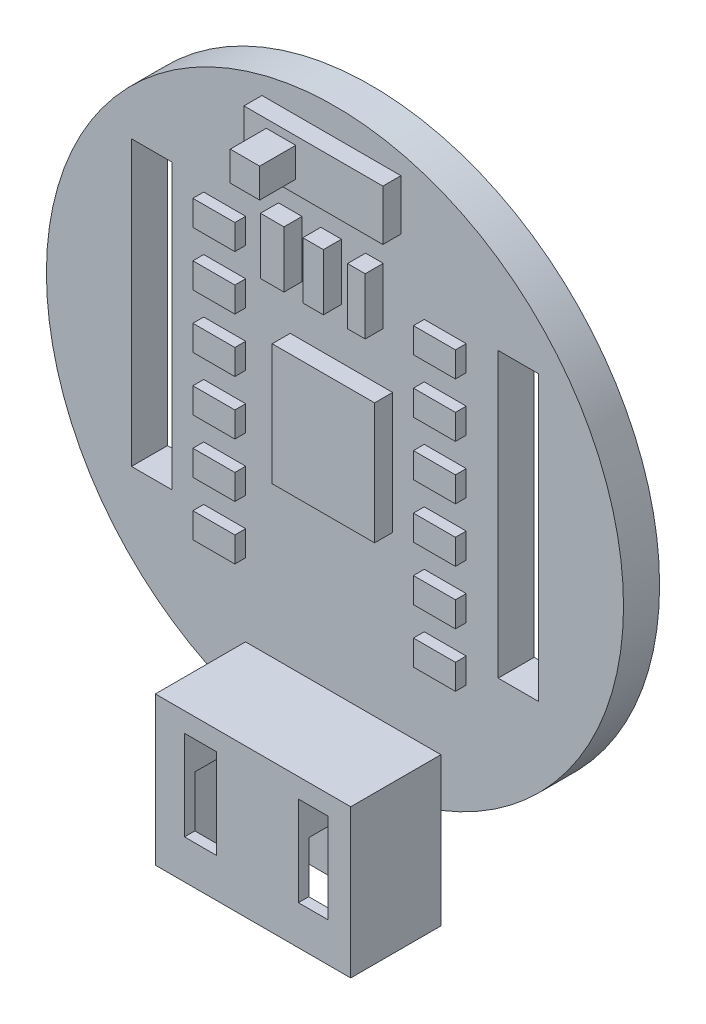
ISO-10303-21;
HEADER;
FILE_DESCRIPTION(('STEP AP214'),'2;1');
FILE_NAME('part.step','',(''),(''),'','','');
FILE_SCHEMA(('AUTOMOTIVE_DESIGN { 1 0 10303 214 1 1 1 1 }'));
ENDSEC;
DATA;
#1=APPLICATION_CONTEXT('core data for automotive mechanical design processes');
#2=APPLICATION_PROTOCOL_DEFINITION('international standard','automotive_design',2000,#1);
#3=PRODUCT_CONTEXT('',#1,'mechanical');
#4=PRODUCT('Part','Part','',(#3));
#5=PRODUCT_RELATED_PRODUCT_CATEGORY('part','',(#4));
#6=PRODUCT_DEFINITION_FORMATION('','',#4);
#7=PRODUCT_DEFINITION_CONTEXT('part definition',#1,'design');
#8=PRODUCT_DEFINITION('design','',#6,#7);
#9=PRODUCT_DEFINITION_SHAPE('','',#8);
#10=(LENGTH_UNIT() NAMED_UNIT(*) SI_UNIT(.MILLI.,.METRE.));
#11=(NAMED_UNIT(*) PLANE_ANGLE_UNIT() SI_UNIT($,.RADIAN.));
#12=(NAMED_UNIT(*) SI_UNIT($,.STERADIAN.) SOLID_ANGLE_UNIT());
#13=UNCERTAINTY_MEASURE_WITH_UNIT(LENGTH_MEASURE(1.E-05),#10,'distance_accuracy_value','');
#14=(GEOMETRIC_REPRESENTATION_CONTEXT(3) GLOBAL_UNCERTAINTY_ASSIGNED_CONTEXT((#13)) GLOBAL_UNIT_ASSIGNED_CONTEXT((#10,
#11,#12)) REPRESENTATION_CONTEXT('',''));
#15=CARTESIAN_POINT('',(0.,0.,0.));
#16=DIRECTION('',(0.,0.,1.));
#17=DIRECTION('',(1.,0.,0.));
#18=AXIS2_PLACEMENT_3D('',#15,#16,#17);
#19=CARTESIAN_POINT('',(0.,0.,0.4));
#20=DIRECTION('',(0.,0.,1.));
#21=DIRECTION('',(1.,0.,0.));
#22=AXIS2_PLACEMENT_3D('',#19,#20,#21);
#23=PLANE('',#22);
#24=DIRECTION('',(0.,-1.,0.));
#25=VECTOR('',#24,1.);
#26=CARTESIAN_POINT('',(-18.9920643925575,39.7815189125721,0.4));
#27=LINE('',#26,#25);
#28=CARTESIAN_POINT('',(-18.9920643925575,39.7815189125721,0.4));
#29=VERTEX_POINT('',#28);
#30=CARTESIAN_POINT('',(-18.9920643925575,39.5671501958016,0.4));
#31=VERTEX_POINT('',#30);
#32=EDGE_CURVE('E749',#29,#31,#27,.T.);
#33=ORIENTED_EDGE('',*,*,#32,.T.);
#34=DIRECTION('',(1.,0.,0.));
#35=VECTOR('',#34,1.);
#36=CARTESIAN_POINT('',(0.,39.5671501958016,0.4));
#37=LINE('',#36,#35);
#38=CARTESIAN_POINT('',(-18.8137466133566,39.5671501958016,0.4));
#39=VERTEX_POINT('',#38);
#40=EDGE_CURVE('E700',#31,#39,#37,.T.);
#41=ORIENTED_EDGE('',*,*,#40,.T.);
#42=DIRECTION('',(0.,1.,0.));
#43=VECTOR('',#42,1.);
#44=CARTESIAN_POINT('',(-18.8137466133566,39.7815189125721,0.4));
#45=LINE('',#44,#43);
#46=CARTESIAN_POINT('',(-18.8137466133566,39.7815189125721,0.4));
#47=VERTEX_POINT('',#46);
#48=EDGE_CURVE('E752',#39,#47,#45,.T.);
#49=ORIENTED_EDGE('',*,*,#48,.T.);
#50=DIRECTION('',(-1.,0.,0.));
#51=VECTOR('',#50,1.);
#52=CARTESIAN_POINT('',(-18.9920643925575,39.7815189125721,0.4));
#53=LINE('',#52,#51);
#54=EDGE_CURVE('E755',#47,#29,#53,.T.);
#55=ORIENTED_EDGE('',*,*,#54,.T.);
#56=EDGE_LOOP('',(#33,#41,#49,#55));
#57=FACE_BOUND('',#56,.T.);
#58=ADVANCED_FACE('F32',(#57),#23,.T.);
#59=CARTESIAN_POINT('',(0.,0.,0.4));
#60=DIRECTION('',(0.,0.,1.));
#61=DIRECTION('',(1.,0.,0.));
#62=AXIS2_PLACEMENT_3D('',#59,#60,#61);
#63=PLANE('',#62);
#64=DIRECTION('',(0.,-1.,0.));
#65=VECTOR('',#64,1.);
#66=CARTESIAN_POINT('',(-18.3605222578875,39.7815189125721,0.4));
#67=LINE('',#66,#65);
#68=CARTESIAN_POINT('',(-18.3605222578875,39.7815189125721,0.4));
#69=VERTEX_POINT('',#68);
#70=CARTESIAN_POINT('',(-18.3605222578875,39.5671501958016,0.4));
#71=VERTEX_POINT('',#70);
#72=EDGE_CURVE('E721',#69,#71,#67,.T.);
#73=ORIENTED_EDGE('',*,*,#72,.T.);
#74=DIRECTION('',(1.,0.,0.));
#75=VECTOR('',#74,1.);
#76=CARTESIAN_POINT('',(0.,39.5671501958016,0.4));
#77=LINE('',#76,#75);
#78=CARTESIAN_POINT('',(-18.1970642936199,39.5671501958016,0.4));
#79=VERTEX_POINT('',#78);
#80=EDGE_CURVE('E40',#71,#79,#77,.T.);
#81=ORIENTED_EDGE('',*,*,#80,.T.);
#82=DIRECTION('',(0.,1.,0.));
#83=VECTOR('',#82,1.);
#84=CARTESIAN_POINT('',(-18.1970642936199,39.7815189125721,0.4));
#85=LINE('',#84,#83);
#86=CARTESIAN_POINT('',(-18.1970642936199,39.7815189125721,0.4));
#87=VERTEX_POINT('',#86);
#88=EDGE_CURVE('E724',#79,#87,#85,.T.);
#89=ORIENTED_EDGE('',*,*,#88,.T.);
#90=DIRECTION('',(-1.,0.,0.));
#91=VECTOR('',#90,1.);
#92=CARTESIAN_POINT('',(-18.3605222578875,39.7815189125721,0.4));
#93=LINE('',#92,#91);
#94=EDGE_CURVE('E727',#87,#69,#93,.T.);
#95=ORIENTED_EDGE('',*,*,#94,.T.);
#96=EDGE_LOOP('',(#73,#81,#89,#95));
#97=FACE_BOUND('',#96,.T.);
#98=ADVANCED_FACE('F1408',(#97),#63,.T.);
#99=CARTESIAN_POINT('',(-18.6577185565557,41.1100000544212,0.2));
#100=DIRECTION('',(0.,0.,1.));
#101=DIRECTION('',(1.,0.,0.));
#102=AXIS2_PLACEMENT_3D('',#99,#100,#101);
#103=PLANE('',#102);
#104=DIRECTION('',(1.,0.,0.));
#105=VECTOR('',#104,1.);
#106=CARTESIAN_POINT('',(-19.0623725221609,42.2782752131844,0.2));
#107=LINE('',#106,#105);
#108=CARTESIAN_POINT('',(-19.0623725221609,42.2782752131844,0.2));
#109=VERTEX_POINT('',#108);
#110=CARTESIAN_POINT('',(-18.2922246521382,42.2782752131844,0.2));
#111=VERTEX_POINT('',#110);
#112=EDGE_CURVE('E844',#109,#111,#107,.T.);
#113=ORIENTED_EDGE('',*,*,#112,.F.);
#114=DIRECTION('',(0.,-1.,0.));
#115=VECTOR('',#114,1.);
#116=CARTESIAN_POINT('',(-19.0623725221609,42.5589223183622,0.2));
#117=LINE('',#116,#115);
#118=CARTESIAN_POINT('',(-19.0623725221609,42.5589223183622,0.2));
#119=VERTEX_POINT('',#118);
#120=EDGE_CURVE('E830',#119,#109,#117,.T.);
#121=ORIENTED_EDGE('',*,*,#120,.F.);
#122=DIRECTION('',(-1.,0.,0.));
#123=VECTOR('',#122,1.);
#124=CARTESIAN_POINT('',(-19.0623725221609,42.5589223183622,0.2));
#125=LINE('',#124,#123);
#126=CARTESIAN_POINT('',(-18.2922246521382,42.5589223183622,0.2));
#127=VERTEX_POINT('',#126);
#128=EDGE_CURVE('E835',#127,#119,#125,.T.);
#129=ORIENTED_EDGE('',*,*,#128,.F.);
#130=DIRECTION('',(0.,1.,0.));
#131=VECTOR('',#130,1.);
#132=CARTESIAN_POINT('',(-18.2922246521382,42.5589223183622,0.2));
#133=LINE('',#132,#131);
#134=EDGE_CURVE('E846',#111,#127,#133,.T.);
#135=ORIENTED_EDGE('',*,*,#134,.F.);
#136=EDGE_LOOP('',(#113,#121,#129,#135));
#137=FACE_BOUND('',#136,.T.);
#138=DIRECTION('',(1.,0.,0.));
#139=VECTOR('',#138,1.);
#140=CARTESIAN_POINT('',(-18.7360386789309,41.7757210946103,0.2));
#141=LINE('',#140,#139);
#142=CARTESIAN_POINT('',(-18.7360386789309,41.7757210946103,0.2));
#143=VERTEX_POINT('',#142);
#144=CARTESIAN_POINT('',(-18.6218218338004,41.7757210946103,0.2));
#145=VERTEX_POINT('',#144);
#146=EDGE_CURVE('E902',#143,#145,#141,.T.);
#147=ORIENTED_EDGE('',*,*,#146,.F.);
#148=DIRECTION('',(0.,-1.,0.));
#149=VECTOR('',#148,1.);
#150=CARTESIAN_POINT('',(-18.7360386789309,42.089001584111,0.2));
#151=LINE('',#150,#149);
#152=CARTESIAN_POINT('',(-18.7360386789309,42.089001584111,0.2));
#153=VERTEX_POINT('',#152);
#154=EDGE_CURVE('E888',#153,#143,#151,.T.);
#155=ORIENTED_EDGE('',*,*,#154,.F.);
#156=DIRECTION('',(-1.,0.,0.));
#157=VECTOR('',#156,1.);
#158=CARTESIAN_POINT('',(-18.7360386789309,42.089001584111,0.2));
#159=LINE('',#158,#157);
#160=CARTESIAN_POINT('',(-18.6218218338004,42.089001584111,0.2));
#161=VERTEX_POINT('',#160);
#162=EDGE_CURVE('E893',#161,#153,#159,.T.);
#163=ORIENTED_EDGE('',*,*,#162,.F.);
#164=DIRECTION('',(0.,1.,0.));
#165=VECTOR('',#164,1.);
#166=CARTESIAN_POINT('',(-18.6218218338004,42.089001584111,0.2));
#167=LINE('',#166,#165);
#168=EDGE_CURVE('E904',#145,#161,#167,.T.);
#169=ORIENTED_EDGE('',*,*,#168,.F.);
#170=EDGE_LOOP('',(#147,#155,#163,#169));
#171=FACE_BOUND('',#170,.T.);
#172=DIRECTION('',(1.,0.,0.));
#173=VECTOR('',#172,1.);
#174=CARTESIAN_POINT('',(-18.9057322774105,40.8228262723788,0.2));
#175=LINE('',#174,#173);
#176=CARTESIAN_POINT('',(-18.9057322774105,40.8228262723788,0.2));
#177=VERTEX_POINT('',#176);
#178=CARTESIAN_POINT('',(-18.3379113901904,40.8228262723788,0.2));
#179=VERTEX_POINT('',#178);
#180=EDGE_CURVE('E960',#177,#179,#175,.T.);
#181=ORIENTED_EDGE('',*,*,#180,.F.);
#182=DIRECTION('',(0.,-1.,0.));
#183=VECTOR('',#182,1.);
#184=CARTESIAN_POINT('',(-18.9057322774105,41.4950739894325,0.2));
#185=LINE('',#184,#183);
#186=CARTESIAN_POINT('',(-18.9057322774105,41.4950739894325,0.2));
#187=VERTEX_POINT('',#186);
#188=EDGE_CURVE('E946',#187,#177,#185,.T.);
#189=ORIENTED_EDGE('',*,*,#188,.F.);
#190=DIRECTION('',(-1.,0.,0.));
#191=VECTOR('',#190,1.);
#192=CARTESIAN_POINT('',(-18.9057322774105,41.4950739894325,0.2));
#193=LINE('',#192,#191);
#194=CARTESIAN_POINT('',(-18.3379113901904,41.4950739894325,0.2));
#195=VERTEX_POINT('',#194);
#196=EDGE_CURVE('E951',#195,#187,#193,.T.);
#197=ORIENTED_EDGE('',*,*,#196,.F.);
#198=DIRECTION('',(0.,1.,0.));
#199=VECTOR('',#198,1.);
#200=CARTESIAN_POINT('',(-18.3379113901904,41.4950739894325,0.2));
#201=LINE('',#200,#199);
#202=EDGE_CURVE('E962',#179,#195,#201,.T.);
#203=ORIENTED_EDGE('',*,*,#202,.F.);
#204=EDGE_LOOP('',(#181,#189,#197,#203));
#205=FACE_BOUND('',#204,.T.);
#206=DIRECTION('',(-1.,0.,0.));
#207=VECTOR('',#206,1.);
#208=CARTESIAN_POINT('',(-17.9298687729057,41.6335044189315,0.2));
#209=LINE('',#208,#207);
#210=CARTESIAN_POINT('',(-17.9298687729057,41.6335044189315,0.2));
#211=VERTEX_POINT('',#210);
#212=CARTESIAN_POINT('',(-18.1626504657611,41.6335044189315,0.2));
#213=VERTEX_POINT('',#212);
#214=EDGE_CURVE('E1018',#211,#213,#209,.T.);
#215=ORIENTED_EDGE('',*,*,#214,.F.);
#216=DIRECTION('',(0.,1.,0.));
#217=VECTOR('',#216,1.);
#218=CARTESIAN_POINT('',(-17.9298687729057,41.6335044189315,0.2));
#219=LINE('',#218,#217);
#220=CARTESIAN_POINT('',(-17.9298687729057,41.4938354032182,0.2));
#221=VERTEX_POINT('',#220);
#222=EDGE_CURVE('E1004',#221,#211,#219,.T.);
#223=ORIENTED_EDGE('',*,*,#222,.F.);
#224=DIRECTION('',(1.,0.,0.));
#225=VECTOR('',#224,1.);
#226=CARTESIAN_POINT('',(-17.9298687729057,41.4938354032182,0.2));
#227=LINE('',#226,#225);
#228=CARTESIAN_POINT('',(-18.1626504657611,41.4938354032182,0.2));
#229=VERTEX_POINT('',#228);
#230=EDGE_CURVE('E1009',#229,#221,#227,.T.);
#231=ORIENTED_EDGE('',*,*,#230,.F.);
#232=DIRECTION('',(0.,-1.,0.));
#233=VECTOR('',#232,1.);
#234=CARTESIAN_POINT('',(-18.1626504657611,41.6335044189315,0.2));
#235=LINE('',#234,#233);
#236=EDGE_CURVE('E1020',#213,#229,#235,.T.);
#237=ORIENTED_EDGE('',*,*,#236,.F.);
#238=EDGE_LOOP('',(#215,#223,#231,#237));
#239=FACE_BOUND('',#238,.T.);
#240=DIRECTION('',(-1.,0.,0.));
#241=VECTOR('',#240,1.);
#242=CARTESIAN_POINT('',(-17.9298687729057,41.0335044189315,0.2));
#243=LINE('',#242,#241);
#244=CARTESIAN_POINT('',(-17.9298687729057,41.0335044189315,0.2));
#245=VERTEX_POINT('',#244);
#246=CARTESIAN_POINT('',(-18.1626504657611,41.0335044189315,0.2));
#247=VERTEX_POINT('',#246);
#248=EDGE_CURVE('E1076',#245,#247,#243,.T.);
#249=ORIENTED_EDGE('',*,*,#248,.F.);
#250=DIRECTION('',(0.,1.,0.));
#251=VECTOR('',#250,1.);
#252=CARTESIAN_POINT('',(-17.9298687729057,41.0335044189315,0.2));
#253=LINE('',#252,#251);
#254=CARTESIAN_POINT('',(-17.9298687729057,40.8938354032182,0.2));
#255=VERTEX_POINT('',#254);
#256=EDGE_CURVE('E1062',#255,#245,#253,.T.);
#257=ORIENTED_EDGE('',*,*,#256,.F.);
#258=DIRECTION('',(1.,0.,0.));
#259=VECTOR('',#258,1.);
#260=CARTESIAN_POINT('',(-17.9298687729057,40.8938354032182,0.2));
#261=LINE('',#260,#259);
#262=CARTESIAN_POINT('',(-18.1626504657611,40.8938354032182,0.2));
#263=VERTEX_POINT('',#262);
#264=EDGE_CURVE('E1067',#263,#255,#261,.T.);
#265=ORIENTED_EDGE('',*,*,#264,.F.);
#266=DIRECTION('',(0.,-1.,0.));
#267=VECTOR('',#266,1.);
#268=CARTESIAN_POINT('',(-18.1626504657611,41.0335044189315,0.2));
#269=LINE('',#268,#267);
#270=EDGE_CURVE('E1078',#247,#263,#269,.T.);
#271=ORIENTED_EDGE('',*,*,#270,.F.);
#272=EDGE_LOOP('',(#249,#257,#265,#271));
#273=FACE_BOUND('',#272,.T.);
#274=DIRECTION('',(-1.,0.,0.));
#275=VECTOR('',#274,1.);
#276=CARTESIAN_POINT('',(-17.9298687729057,40.4335044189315,0.2));
#277=LINE('',#276,#275);
#278=CARTESIAN_POINT('',(-17.9298687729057,40.4335044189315,0.2));
#279=VERTEX_POINT('',#278);
#280=CARTESIAN_POINT('',(-18.1626504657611,40.4335044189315,0.2));
#281=VERTEX_POINT('',#280);
#282=EDGE_CURVE('E1134',#279,#281,#277,.T.);
#283=ORIENTED_EDGE('',*,*,#282,.F.);
#284=DIRECTION('',(0.,1.,0.));
#285=VECTOR('',#284,1.);
#286=CARTESIAN_POINT('',(-17.9298687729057,40.4335044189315,0.2));
#287=LINE('',#286,#285);
#288=CARTESIAN_POINT('',(-17.9298687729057,40.2938354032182,0.2));
#289=VERTEX_POINT('',#288);
#290=EDGE_CURVE('E1120',#289,#279,#287,.T.);
#291=ORIENTED_EDGE('',*,*,#290,.F.);
#292=DIRECTION('',(1.,0.,0.));
#293=VECTOR('',#292,1.);
#294=CARTESIAN_POINT('',(-17.9298687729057,40.2938354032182,0.2));
#295=LINE('',#294,#293);
#296=CARTESIAN_POINT('',(-18.1626504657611,40.2938354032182,0.2));
#297=VERTEX_POINT('',#296);
#298=EDGE_CURVE('E1125',#297,#289,#295,.T.);
#299=ORIENTED_EDGE('',*,*,#298,.F.);
#300=DIRECTION('',(0.,-1.,0.));
#301=VECTOR('',#300,1.);
#302=CARTESIAN_POINT('',(-18.1626504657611,40.4335044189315,0.2));
#303=LINE('',#302,#301);
#304=EDGE_CURVE('E1136',#281,#297,#303,.T.);
#305=ORIENTED_EDGE('',*,*,#304,.F.);
#306=EDGE_LOOP('',(#283,#291,#299,#305));
#307=FACE_BOUND('',#306,.T.);
#308=DIRECTION('',(0.,-1.,0.));
#309=VECTOR('',#308,1.);
#310=CARTESIAN_POINT('',(-19.3855683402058,40.7335044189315,0.2));
#311=LINE('',#310,#309);
#312=CARTESIAN_POINT('',(-19.3855683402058,40.7335044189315,0.2));
#313=VERTEX_POINT('',#312);
#314=CARTESIAN_POINT('',(-19.3855683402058,40.5938354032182,0.2));
#315=VERTEX_POINT('',#314);
#316=EDGE_CURVE('E1192',#313,#315,#311,.T.);
#317=ORIENTED_EDGE('',*,*,#316,.F.);
#318=DIRECTION('',(-1.,0.,0.));
#319=VECTOR('',#318,1.);
#320=CARTESIAN_POINT('',(-19.3855683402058,40.7335044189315,0.2));
#321=LINE('',#320,#319);
#322=CARTESIAN_POINT('',(-19.1527866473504,40.7335044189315,0.2));
#323=VERTEX_POINT('',#322);
#324=EDGE_CURVE('E1178',#323,#313,#321,.T.);
#325=ORIENTED_EDGE('',*,*,#324,.F.);
#326=DIRECTION('',(0.,1.,0.));
#327=VECTOR('',#326,1.);
#328=CARTESIAN_POINT('',(-19.1527866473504,40.7335044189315,0.2));
#329=LINE('',#328,#327);
#330=CARTESIAN_POINT('',(-19.1527866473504,40.5938354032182,0.2));
#331=VERTEX_POINT('',#330);
#332=EDGE_CURVE('E1183',#331,#323,#329,.T.);
#333=ORIENTED_EDGE('',*,*,#332,.F.);
#334=DIRECTION('',(1.,0.,0.));
#335=VECTOR('',#334,1.);
#336=CARTESIAN_POINT('',(-19.3855683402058,40.5938354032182,0.2));
#337=LINE('',#336,#335);
#338=EDGE_CURVE('E1194',#315,#331,#337,.T.);
#339=ORIENTED_EDGE('',*,*,#338,.F.);
#340=EDGE_LOOP('',(#317,#325,#333,#339));
#341=FACE_BOUND('',#340,.T.);
#342=DIRECTION('',(0.,-1.,0.));
#343=VECTOR('',#342,1.);
#344=CARTESIAN_POINT('',(-19.3855683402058,41.3335044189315,0.2));
#345=LINE('',#344,#343);
#346=CARTESIAN_POINT('',(-19.3855683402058,41.3335044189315,0.2));
#347=VERTEX_POINT('',#346);
#348=CARTESIAN_POINT('',(-19.3855683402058,41.1938354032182,0.2));
#349=VERTEX_POINT('',#348);
#350=EDGE_CURVE('E1250',#347,#349,#345,.T.);
#351=ORIENTED_EDGE('',*,*,#350,.F.);
#352=DIRECTION('',(-1.,0.,0.));
#353=VECTOR('',#352,1.);
#354=CARTESIAN_POINT('',(-19.3855683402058,41.3335044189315,0.2));
#355=LINE('',#354,#353);
#356=CARTESIAN_POINT('',(-19.1527866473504,41.3335044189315,0.2));
#357=VERTEX_POINT('',#356);
#358=EDGE_CURVE('E1236',#357,#347,#355,.T.);
#359=ORIENTED_EDGE('',*,*,#358,.F.);
#360=DIRECTION('',(0.,1.,0.));
#361=VECTOR('',#360,1.);
#362=CARTESIAN_POINT('',(-19.1527866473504,41.3335044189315,0.2));
#363=LINE('',#362,#361);
#364=CARTESIAN_POINT('',(-19.1527866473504,41.1938354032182,0.2));
#365=VERTEX_POINT('',#364);
#366=EDGE_CURVE('E1241',#365,#357,#363,.T.);
#367=ORIENTED_EDGE('',*,*,#366,.F.);
#368=DIRECTION('',(1.,0.,0.));
#369=VECTOR('',#368,1.);
#370=CARTESIAN_POINT('',(-19.3855683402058,41.1938354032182,0.2));
#371=LINE('',#370,#369);
#372=EDGE_CURVE('E1252',#349,#365,#371,.T.);
#373=ORIENTED_EDGE('',*,*,#372,.F.);
#374=EDGE_LOOP('',(#351,#359,#367,#373));
#375=FACE_BOUND('',#374,.T.);
#376=DIRECTION('',(1.,0.,0.));
#377=VECTOR('',#376,1.);
#378=CARTESIAN_POINT('',(-19.3855683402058,41.7938354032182,0.2));
#379=LINE('',#378,#377);
#380=CARTESIAN_POINT('',(-19.3855683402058,41.7938354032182,0.2));
#381=VERTEX_POINT('',#380);
#382=CARTESIAN_POINT('',(-19.1527866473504,41.7938354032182,0.2));
#383=VERTEX_POINT('',#382);
#384=EDGE_CURVE('E1308',#381,#383,#379,.T.);
#385=ORIENTED_EDGE('',*,*,#384,.F.);
#386=DIRECTION('',(0.,-1.,0.));
#387=VECTOR('',#386,1.);
#388=CARTESIAN_POINT('',(-19.3855683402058,41.9335044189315,0.2));
#389=LINE('',#388,#387);
#390=CARTESIAN_POINT('',(-19.3855683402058,41.9335044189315,0.2));
#391=VERTEX_POINT('',#390);
#392=EDGE_CURVE('E1294',#391,#381,#389,.T.);
#393=ORIENTED_EDGE('',*,*,#392,.F.);
#394=DIRECTION('',(-1.,0.,0.));
#395=VECTOR('',#394,1.);
#396=CARTESIAN_POINT('',(-19.3855683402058,41.9335044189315,0.2));
#397=LINE('',#396,#395);
#398=CARTESIAN_POINT('',(-19.1527866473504,41.9335044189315,0.2));
#399=VERTEX_POINT('',#398);
#400=EDGE_CURVE('E1299',#399,#391,#397,.T.);
#401=ORIENTED_EDGE('',*,*,#400,.F.);
#402=DIRECTION('',(0.,1.,0.));
#403=VECTOR('',#402,1.);
#404=CARTESIAN_POINT('',(-19.1527866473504,41.9335044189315,0.2));
#405=LINE('',#404,#403);
#406=EDGE_CURVE('E1310',#383,#399,#405,.T.);
#407=ORIENTED_EDGE('',*,*,#406,.F.);
#408=EDGE_LOOP('',(#385,#393,#401,#407));
#409=FACE_BOUND('',#408,.T.);
#410=DIRECTION('',(-1.,0.,0.));
#411=VECTOR('',#410,1.);
#412=CARTESIAN_POINT('',(-17.5294842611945,41.9893720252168,0.2));
#413=LINE('',#412,#411);
#414=CARTESIAN_POINT('',(-17.5294842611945,41.9893720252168,0.2));
#415=VERTEX_POINT('',#414);
#416=CARTESIAN_POINT('',(-17.7529546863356,41.9893720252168,0.2));
#417=VERTEX_POINT('',#416);
#418=EDGE_CURVE('E1323',#415,#417,#413,.T.);
#419=ORIENTED_EDGE('',*,*,#418,.F.);
#420=DIRECTION('',(0.,1.,0.));
#421=VECTOR('',#420,1.);
#422=CARTESIAN_POINT('',(-17.5294842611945,41.9893720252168,0.2));
#423=LINE('',#422,#421);
#424=CARTESIAN_POINT('',(-17.5294842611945,40.4157677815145,0.2));
#425=VERTEX_POINT('',#424);
#426=EDGE_CURVE('E1328',#425,#415,#423,.T.);
#427=ORIENTED_EDGE('',*,*,#426,.F.);
#428=DIRECTION('',(1.,0.,0.));
#429=VECTOR('',#428,1.);
#430=CARTESIAN_POINT('',(-17.5294842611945,40.4157677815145,0.2));
#431=LINE('',#430,#429);
#432=CARTESIAN_POINT('',(-17.7529546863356,40.4157677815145,0.2));
#433=VERTEX_POINT('',#432);
#434=EDGE_CURVE('E1342',#433,#425,#431,.T.);
#435=ORIENTED_EDGE('',*,*,#434,.F.);
#436=DIRECTION('',(0.,-1.,0.));
#437=VECTOR('',#436,1.);
#438=CARTESIAN_POINT('',(-17.7529546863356,41.9893720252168,0.2));
#439=LINE('',#438,#437);
#440=EDGE_CURVE('E1339',#417,#433,#439,.T.);
#441=ORIENTED_EDGE('',*,*,#440,.F.);
#442=EDGE_LOOP('',(#419,#427,#435,#441));
#443=FACE_BOUND('',#442,.T.);
#444=DIRECTION('',(0.,-1.,0.));
#445=VECTOR('',#444,1.);
#446=CARTESIAN_POINT('',(-19.785952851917,41.9893720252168,0.2));
#447=LINE('',#446,#445);
#448=CARTESIAN_POINT('',(-19.785952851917,41.9893720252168,0.2));
#449=VERTEX_POINT('',#448);
#450=CARTESIAN_POINT('',(-19.785952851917,40.4157677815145,0.2));
#451=VERTEX_POINT('',#450);
#452=EDGE_CURVE('E1349',#449,#451,#447,.T.);
#453=ORIENTED_EDGE('',*,*,#452,.F.);
#454=DIRECTION('',(-1.,0.,0.));
#455=VECTOR('',#454,1.);
#456=CARTESIAN_POINT('',(-19.785952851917,41.9893720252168,0.2));
#457=LINE('',#456,#455);
#458=CARTESIAN_POINT('',(-19.5624824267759,41.9893720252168,0.2));
#459=VERTEX_POINT('',#458);
#460=EDGE_CURVE('E1360',#459,#449,#457,.T.);
#461=ORIENTED_EDGE('',*,*,#460,.F.);
#462=DIRECTION('',(0.,1.,0.));
#463=VECTOR('',#462,1.);
#464=CARTESIAN_POINT('',(-19.5624824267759,41.9893720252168,0.2));
#465=LINE('',#464,#463);
#466=CARTESIAN_POINT('',(-19.5624824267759,40.4157677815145,0.2));
#467=VERTEX_POINT('',#466);
#468=EDGE_CURVE('E1374',#467,#459,#465,.T.);
#469=ORIENTED_EDGE('',*,*,#468,.F.);
#470=DIRECTION('',(1.,0.,0.));
#471=VECTOR('',#470,1.);
#472=CARTESIAN_POINT('',(-19.785952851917,40.4157677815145,0.2));
#473=LINE('',#472,#471);
#474=EDGE_CURVE('E1371',#451,#467,#473,.T.);
#475=ORIENTED_EDGE('',*,*,#474,.F.);
#476=EDGE_LOOP('',(#453,#461,#469,#475));
#477=FACE_BOUND('',#476,.T.);
#478=DIRECTION('',(0.,-1.,0.));
#479=VECTOR('',#478,1.);
#480=CARTESIAN_POINT('',(-19.3855683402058,41.6335044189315,0.2));
#481=LINE('',#480,#479);
#482=CARTESIAN_POINT('',(-19.3855683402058,41.6335044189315,0.2));
#483=VERTEX_POINT('',#482);
#484=CARTESIAN_POINT('',(-19.3855683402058,41.4938354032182,0.2));
#485=VERTEX_POINT('',#484);
#486=EDGE_CURVE('E1279',#483,#485,#481,.T.);
#487=ORIENTED_EDGE('',*,*,#486,.F.);
#488=DIRECTION('',(-1.,0.,0.));
#489=VECTOR('',#488,1.);
#490=CARTESIAN_POINT('',(-19.3855683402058,41.6335044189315,0.2));
#491=LINE('',#490,#489);
#492=CARTESIAN_POINT('',(-19.1527866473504,41.6335044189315,0.2));
#493=VERTEX_POINT('',#492);
#494=EDGE_CURVE('E1265',#493,#483,#491,.T.);
#495=ORIENTED_EDGE('',*,*,#494,.F.);
#496=DIRECTION('',(0.,1.,0.));
#497=VECTOR('',#496,1.);
#498=CARTESIAN_POINT('',(-19.1527866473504,41.6335044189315,0.2));
#499=LINE('',#498,#497);
#500=CARTESIAN_POINT('',(-19.1527866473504,41.4938354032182,0.2));
#501=VERTEX_POINT('',#500);
#502=EDGE_CURVE('E1270',#501,#493,#499,.T.);
#503=ORIENTED_EDGE('',*,*,#502,.F.);
#504=DIRECTION('',(1.,0.,0.));
#505=VECTOR('',#504,1.);
#506=CARTESIAN_POINT('',(-19.3855683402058,41.4938354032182,0.2));
#507=LINE('',#506,#505);
#508=EDGE_CURVE('E1281',#485,#501,#507,.T.);
#509=ORIENTED_EDGE('',*,*,#508,.F.);
#510=EDGE_LOOP('',(#487,#495,#503,#509));
#511=FACE_BOUND('',#510,.T.);
#512=DIRECTION('',(0.,-1.,0.));
#513=VECTOR('',#512,1.);
#514=CARTESIAN_POINT('',(-19.3855683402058,41.0335044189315,0.2));
#515=LINE('',#514,#513);
#516=CARTESIAN_POINT('',(-19.3855683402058,41.0335044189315,0.2));
#517=VERTEX_POINT('',#516);
#518=CARTESIAN_POINT('',(-19.3855683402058,40.8938354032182,0.2));
#519=VERTEX_POINT('',#518);
#520=EDGE_CURVE('E1221',#517,#519,#515,.T.);
#521=ORIENTED_EDGE('',*,*,#520,.F.);
#522=DIRECTION('',(-1.,0.,0.));
#523=VECTOR('',#522,1.);
#524=CARTESIAN_POINT('',(-19.3855683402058,41.0335044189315,0.2));
#525=LINE('',#524,#523);
#526=CARTESIAN_POINT('',(-19.1527866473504,41.0335044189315,0.2));
#527=VERTEX_POINT('',#526);
#528=EDGE_CURVE('E1207',#527,#517,#525,.T.);
#529=ORIENTED_EDGE('',*,*,#528,.F.);
#530=DIRECTION('',(0.,1.,0.));
#531=VECTOR('',#530,1.);
#532=CARTESIAN_POINT('',(-19.1527866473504,41.0335044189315,0.2));
#533=LINE('',#532,#531);
#534=CARTESIAN_POINT('',(-19.1527866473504,40.8938354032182,0.2));
#535=VERTEX_POINT('',#534);
#536=EDGE_CURVE('E1212',#535,#527,#533,.T.);
#537=ORIENTED_EDGE('',*,*,#536,.F.);
#538=DIRECTION('',(1.,0.,0.));
#539=VECTOR('',#538,1.);
#540=CARTESIAN_POINT('',(-19.3855683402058,40.8938354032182,0.2));
#541=LINE('',#540,#539);
#542=EDGE_CURVE('E1223',#519,#535,#541,.T.);
#543=ORIENTED_EDGE('',*,*,#542,.F.);
#544=EDGE_LOOP('',(#521,#529,#537,#543));
#545=FACE_BOUND('',#544,.T.);
#546=DIRECTION('',(0.,-1.,0.));
#547=VECTOR('',#546,1.);
#548=CARTESIAN_POINT('',(-19.3855683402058,40.4335044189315,0.2));
#549=LINE('',#548,#547);
#550=CARTESIAN_POINT('',(-19.3855683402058,40.4335044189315,0.2));
#551=VERTEX_POINT('',#550);
#552=CARTESIAN_POINT('',(-19.3855683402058,40.2938354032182,0.2));
#553=VERTEX_POINT('',#552);
#554=EDGE_CURVE('E1163',#551,#553,#549,.T.);
#555=ORIENTED_EDGE('',*,*,#554,.F.);
#556=DIRECTION('',(-1.,0.,0.));
#557=VECTOR('',#556,1.);
#558=CARTESIAN_POINT('',(-19.3855683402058,40.4335044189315,0.2));
#559=LINE('',#558,#557);
#560=CARTESIAN_POINT('',(-19.1527866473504,40.4335044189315,0.2));
#561=VERTEX_POINT('',#560);
#562=EDGE_CURVE('E1149',#561,#551,#559,.T.);
#563=ORIENTED_EDGE('',*,*,#562,.F.);
#564=DIRECTION('',(0.,1.,0.));
#565=VECTOR('',#564,1.);
#566=CARTESIAN_POINT('',(-19.1527866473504,40.4335044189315,0.2));
#567=LINE('',#566,#565);
#568=CARTESIAN_POINT('',(-19.1527866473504,40.2938354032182,0.2));
#569=VERTEX_POINT('',#568);
#570=EDGE_CURVE('E1154',#569,#561,#567,.T.);
#571=ORIENTED_EDGE('',*,*,#570,.F.);
#572=DIRECTION('',(1.,0.,0.));
#573=VECTOR('',#572,1.);
#574=CARTESIAN_POINT('',(-19.3855683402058,40.2938354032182,0.2));
#575=LINE('',#574,#573);
#576=EDGE_CURVE('E1165',#553,#569,#575,.T.);
#577=ORIENTED_EDGE('',*,*,#576,.F.);
#578=EDGE_LOOP('',(#555,#563,#571,#577));
#579=FACE_BOUND('',#578,.T.);
#580=DIRECTION('',(-1.,0.,0.));
#581=VECTOR('',#580,1.);
#582=CARTESIAN_POINT('',(-17.9298687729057,40.7335044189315,0.2));
#583=LINE('',#582,#581);
#584=CARTESIAN_POINT('',(-17.9298687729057,40.7335044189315,0.2));
#585=VERTEX_POINT('',#584);
#586=CARTESIAN_POINT('',(-18.1626504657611,40.7335044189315,0.2));
#587=VERTEX_POINT('',#586);
#588=EDGE_CURVE('E1105',#585,#587,#583,.T.);
#589=ORIENTED_EDGE('',*,*,#588,.F.);
#590=DIRECTION('',(0.,1.,0.));
#591=VECTOR('',#590,1.);
#592=CARTESIAN_POINT('',(-17.9298687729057,40.7335044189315,0.2));
#593=LINE('',#592,#591);
#594=CARTESIAN_POINT('',(-17.9298687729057,40.5938354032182,0.2));
#595=VERTEX_POINT('',#594);
#596=EDGE_CURVE('E1091',#595,#585,#593,.T.);
#597=ORIENTED_EDGE('',*,*,#596,.F.);
#598=DIRECTION('',(1.,0.,0.));
#599=VECTOR('',#598,1.);
#600=CARTESIAN_POINT('',(-17.9298687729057,40.5938354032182,0.2));
#601=LINE('',#600,#599);
#602=CARTESIAN_POINT('',(-18.1626504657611,40.5938354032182,0.2));
#603=VERTEX_POINT('',#602);
#604=EDGE_CURVE('E1096',#603,#595,#601,.T.);
#605=ORIENTED_EDGE('',*,*,#604,.F.);
#606=DIRECTION('',(0.,-1.,0.));
#607=VECTOR('',#606,1.);
#608=CARTESIAN_POINT('',(-18.1626504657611,40.7335044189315,0.2));
#609=LINE('',#608,#607);
#610=EDGE_CURVE('E1107',#587,#603,#609,.T.);
#611=ORIENTED_EDGE('',*,*,#610,.F.);
#612=EDGE_LOOP('',(#589,#597,#605,#611));
#613=FACE_BOUND('',#612,.T.);
#614=DIRECTION('',(-1.,0.,0.));
#615=VECTOR('',#614,1.);
#616=CARTESIAN_POINT('',(-17.9298687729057,41.3335044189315,0.2));
#617=LINE('',#616,#615);
#618=CARTESIAN_POINT('',(-17.9298687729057,41.3335044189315,0.2));
#619=VERTEX_POINT('',#618);
#620=CARTESIAN_POINT('',(-18.1626504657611,41.3335044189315,0.2));
#621=VERTEX_POINT('',#620);
#622=EDGE_CURVE('E1047',#619,#621,#617,.T.);
#623=ORIENTED_EDGE('',*,*,#622,.F.);
#624=DIRECTION('',(0.,1.,0.));
#625=VECTOR('',#624,1.);
#626=CARTESIAN_POINT('',(-17.9298687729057,41.3335044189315,0.2));
#627=LINE('',#626,#625);
#628=CARTESIAN_POINT('',(-17.9298687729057,41.1938354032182,0.2));
#629=VERTEX_POINT('',#628);
#630=EDGE_CURVE('E1033',#629,#619,#627,.T.);
#631=ORIENTED_EDGE('',*,*,#630,.F.);
#632=DIRECTION('',(1.,0.,0.));
#633=VECTOR('',#632,1.);
#634=CARTESIAN_POINT('',(-17.9298687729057,41.1938354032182,0.2));
#635=LINE('',#634,#633);
#636=CARTESIAN_POINT('',(-18.1626504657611,41.1938354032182,0.2));
#637=VERTEX_POINT('',#636);
#638=EDGE_CURVE('E1038',#637,#629,#635,.T.);
#639=ORIENTED_EDGE('',*,*,#638,.F.);
#640=DIRECTION('',(0.,-1.,0.));
#641=VECTOR('',#640,1.);
#642=CARTESIAN_POINT('',(-18.1626504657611,41.3335044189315,0.2));
#643=LINE('',#642,#641);
#644=EDGE_CURVE('E1049',#621,#637,#643,.T.);
#645=ORIENTED_EDGE('',*,*,#644,.F.);
#646=EDGE_LOOP('',(#623,#631,#639,#645));
#647=FACE_BOUND('',#646,.T.);
#648=DIRECTION('',(0.,-1.,0.));
#649=VECTOR('',#648,1.);
#650=CARTESIAN_POINT('',(-18.1626504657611,41.9335044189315,0.2));
#651=LINE('',#650,#649);
#652=CARTESIAN_POINT('',(-18.1626504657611,41.9335044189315,0.2));
#653=VERTEX_POINT('',#652);
#654=CARTESIAN_POINT('',(-18.1626504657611,41.7938354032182,0.2));
#655=VERTEX_POINT('',#654);
#656=EDGE_CURVE('E989',#653,#655,#651,.T.);
#657=ORIENTED_EDGE('',*,*,#656,.F.);
#658=DIRECTION('',(-1.,0.,0.));
#659=VECTOR('',#658,1.);
#660=CARTESIAN_POINT('',(-17.9298687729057,41.9335044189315,0.2));
#661=LINE('',#660,#659);
#662=CARTESIAN_POINT('',(-17.9298687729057,41.9335044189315,0.2));
#663=VERTEX_POINT('',#662);
#664=EDGE_CURVE('E975',#663,#653,#661,.T.);
#665=ORIENTED_EDGE('',*,*,#664,.F.);
#666=DIRECTION('',(0.,1.,0.));
#667=VECTOR('',#666,1.);
#668=CARTESIAN_POINT('',(-17.9298687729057,41.9335044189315,0.2));
#669=LINE('',#668,#667);
#670=CARTESIAN_POINT('',(-17.9298687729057,41.7938354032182,0.2));
#671=VERTEX_POINT('',#670);
#672=EDGE_CURVE('E980',#671,#663,#669,.T.);
#673=ORIENTED_EDGE('',*,*,#672,.F.);
#674=DIRECTION('',(1.,0.,0.));
#675=VECTOR('',#674,1.);
#676=CARTESIAN_POINT('',(-17.9298687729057,41.7938354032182,0.2));
#677=LINE('',#676,#675);
#678=EDGE_CURVE('E991',#655,#671,#677,.T.);
#679=ORIENTED_EDGE('',*,*,#678,.F.);
#680=EDGE_LOOP('',(#657,#665,#673,#679));
#681=FACE_BOUND('',#680,.T.);
#682=DIRECTION('',(1.,0.,0.));
#683=VECTOR('',#682,1.);
#684=CARTESIAN_POINT('',(-18.9709990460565,41.7757210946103,0.2));
#685=LINE('',#684,#683);
#686=CARTESIAN_POINT('',(-18.9709990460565,41.7757210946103,0.2));
#687=VERTEX_POINT('',#686);
#688=CARTESIAN_POINT('',(-18.8404655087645,41.7757210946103,0.2));
#689=VERTEX_POINT('',#688);
#690=EDGE_CURVE('E931',#687,#689,#685,.T.);
#691=ORIENTED_EDGE('',*,*,#690,.F.);
#692=DIRECTION('',(0.,-1.,0.));
#693=VECTOR('',#692,1.);
#694=CARTESIAN_POINT('',(-18.9709990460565,42.089001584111,0.2));
#695=LINE('',#694,#693);
#696=CARTESIAN_POINT('',(-18.9709990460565,42.089001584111,0.2));
#697=VERTEX_POINT('',#696);
#698=EDGE_CURVE('E917',#697,#687,#695,.T.);
#699=ORIENTED_EDGE('',*,*,#698,.F.);
#700=DIRECTION('',(-1.,0.,0.));
#701=VECTOR('',#700,1.);
#702=CARTESIAN_POINT('',(-18.9709990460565,42.089001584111,0.2));
#703=LINE('',#702,#701);
#704=CARTESIAN_POINT('',(-18.8404655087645,42.089001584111,0.2));
#705=VERTEX_POINT('',#704);
#706=EDGE_CURVE('E922',#705,#697,#703,.T.);
#707=ORIENTED_EDGE('',*,*,#706,.F.);
#708=DIRECTION('',(0.,1.,0.));
#709=VECTOR('',#708,1.);
#710=CARTESIAN_POINT('',(-18.8404655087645,42.089001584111,0.2));
#711=LINE('',#710,#709);
#712=EDGE_CURVE('E933',#689,#705,#711,.T.);
#713=ORIENTED_EDGE('',*,*,#712,.F.);
#714=EDGE_LOOP('',(#691,#699,#707,#713));
#715=FACE_BOUND('',#714,.T.);
#716=DIRECTION('',(1.,0.,0.));
#717=VECTOR('',#716,1.);
#718=CARTESIAN_POINT('',(-18.4880249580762,41.7757210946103,0.2));
#719=LINE('',#718,#717);
#720=CARTESIAN_POINT('',(-18.4880249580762,41.7757210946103,0.2));
#721=VERTEX_POINT('',#720);
#722=CARTESIAN_POINT('',(-18.3901248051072,41.7757210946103,0.2));
#723=VERTEX_POINT('',#722);
#724=EDGE_CURVE('E873',#721,#723,#719,.T.);
#725=ORIENTED_EDGE('',*,*,#724,.F.);
#726=DIRECTION('',(0.,-1.,0.));
#727=VECTOR('',#726,1.);
#728=CARTESIAN_POINT('',(-18.4880249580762,42.089001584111,0.2));
#729=LINE('',#728,#727);
#730=CARTESIAN_POINT('',(-18.4880249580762,42.089001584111,0.2));
#731=VERTEX_POINT('',#730);
#732=EDGE_CURVE('E859',#731,#721,#729,.T.);
#733=ORIENTED_EDGE('',*,*,#732,.F.);
#734=DIRECTION('',(-1.,0.,0.));
#735=VECTOR('',#734,1.);
#736=CARTESIAN_POINT('',(-18.4880249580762,42.089001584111,0.2));
#737=LINE('',#736,#735);
#738=CARTESIAN_POINT('',(-18.3901248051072,42.089001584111,0.2));
#739=VERTEX_POINT('',#738);
#740=EDGE_CURVE('E864',#739,#731,#737,.T.);
#741=ORIENTED_EDGE('',*,*,#740,.F.);
#742=DIRECTION('',(0.,1.,0.));
#743=VECTOR('',#742,1.);
#744=CARTESIAN_POINT('',(-18.3901248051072,42.089001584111,0.2));
#745=LINE('',#744,#743);
#746=EDGE_CURVE('E875',#723,#739,#745,.T.);
#747=ORIENTED_EDGE('',*,*,#746,.F.);
#748=EDGE_LOOP('',(#725,#733,#741,#747));
#749=FACE_BOUND('',#748,.T.);
#750=CARTESIAN_POINT('',(-18.6577185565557,41.1100000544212,0.2));
#751=DIRECTION('',(0.,0.,1.));
#752=DIRECTION('',(1.,0.,0.));
#753=AXIS2_PLACEMENT_3D('',#750,#751,#752);
#754=CIRCLE('',#753,1.6);
#755=CARTESIAN_POINT('',(-18.0703176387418,39.621725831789,0.2));
#756=VERTEX_POINT('',#755);
#757=CARTESIAN_POINT('',(-19.1537459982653,39.5888305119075,0.2));
#758=VERTEX_POINT('',#757);
#759=EDGE_CURVE('E1392',#756,#758,#754,.T.);
#760=ORIENTED_EDGE('',*,*,#759,.T.);
#761=DIRECTION('',(0.,-1.,0.));
#762=VECTOR('',#761,1.);
#763=CARTESIAN_POINT('',(-19.1537459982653,39.8895114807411,0.2));
#764=LINE('',#763,#762);
#765=CARTESIAN_POINT('',(-19.1537459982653,39.8895114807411,0.2));
#766=VERTEX_POINT('',#765);
#767=EDGE_CURVE('E788',#766,#758,#764,.T.);
#768=ORIENTED_EDGE('',*,*,#767,.F.);
#769=DIRECTION('',(-1.,0.,0.));
#770=VECTOR('',#769,1.);
#771=CARTESIAN_POINT('',(-19.1537459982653,39.8895114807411,0.2));
#772=LINE('',#771,#770);
#773=CARTESIAN_POINT('',(-18.0703176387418,39.8895114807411,0.2));
#774=VERTEX_POINT('',#773);
#775=EDGE_CURVE('E781',#774,#766,#772,.T.);
#776=ORIENTED_EDGE('',*,*,#775,.F.);
#777=DIRECTION('',(0.,1.,0.));
#778=VECTOR('',#777,1.);
#779=CARTESIAN_POINT('',(-18.0703176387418,39.8895114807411,0.2));
#780=LINE('',#779,#778);
#781=EDGE_CURVE('E793',#756,#774,#780,.T.);
#782=ORIENTED_EDGE('',*,*,#781,.F.);
#783=EDGE_LOOP('',(#760,#768,#776,#782));
#784=FACE_BOUND('',#783,.T.);
#785=ADVANCED_FACE('F1480',(#137,#171,#205,#239,#273,#307,#341,#375,#409,#443,#477,#511,#545,
#579,#613,#647,#681,#715,#749,#784),#103,.T.);
#786=CARTESIAN_POINT('',(0.,0.,0.3));
#787=DIRECTION('',(0.,0.,1.));
#788=DIRECTION('',(1.,0.,0.));
#789=AXIS2_PLACEMENT_3D('',#786,#787,#788);
#790=PLANE('',#789);
#791=DIRECTION('',(0.,-1.,0.));
#792=VECTOR('',#791,1.);
#793=CARTESIAN_POINT('',(-19.0623725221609,42.5589223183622,0.3));
#794=LINE('',#793,#792);
#795=CARTESIAN_POINT('',(-19.0623725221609,42.5589223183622,0.3));
#796=VERTEX_POINT('',#795);
#797=CARTESIAN_POINT('',(-19.0623725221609,42.2782752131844,0.3));
#798=VERTEX_POINT('',#797);
#799=EDGE_CURVE('E831',#796,#798,#794,.T.);
#800=ORIENTED_EDGE('',*,*,#799,.T.);
#801=DIRECTION('',(1.,0.,0.));
#802=VECTOR('',#801,1.);
#803=CARTESIAN_POINT('',(-19.0623725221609,42.2782752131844,0.3));
#804=LINE('',#803,#802);
#805=CARTESIAN_POINT('',(-18.2922246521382,42.2782752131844,0.3));
#806=VERTEX_POINT('',#805);
#807=EDGE_CURVE('E834',#798,#806,#804,.T.);
#808=ORIENTED_EDGE('',*,*,#807,.T.);
#809=DIRECTION('',(0.,1.,0.));
#810=VECTOR('',#809,1.);
#811=CARTESIAN_POINT('',(-18.2922246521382,42.5589223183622,0.3));
#812=LINE('',#811,#810);
#813=CARTESIAN_POINT('',(-18.2922246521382,42.5589223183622,0.3));
#814=VERTEX_POINT('',#813);
#815=EDGE_CURVE('E837',#806,#814,#812,.T.);
#816=ORIENTED_EDGE('',*,*,#815,.T.);
#817=DIRECTION('',(-1.,0.,0.));
#818=VECTOR('',#817,1.);
#819=CARTESIAN_POINT('',(-19.0623725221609,42.5589223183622,0.3));
#820=LINE('',#819,#818);
#821=EDGE_CURVE('E839',#814,#796,#820,.T.);
#822=ORIENTED_EDGE('',*,*,#821,.T.);
#823=EDGE_LOOP('',(#800,#808,#816,#822));
#824=FACE_BOUND('',#823,.T.);
#825=DIRECTION('',(-1.,0.,0.));
#826=VECTOR('',#825,1.);
#827=CARTESIAN_POINT('',(0.,42.350068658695,0.3));
#828=LINE('',#827,#826);
#829=CARTESIAN_POINT('',(-18.7751987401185,42.350068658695,0.3));
#830=VERTEX_POINT('',#829);
#831=CARTESIAN_POINT('',(-18.9383656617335,42.350068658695,0.3));
#832=VERTEX_POINT('',#831);
#833=EDGE_CURVE('E1400',#830,#832,#828,.T.);
#834=ORIENTED_EDGE('',*,*,#833,.T.);
#835=DIRECTION('',(0.,1.,0.));
#836=VECTOR('',#835,1.);
#837=CARTESIAN_POINT('',(-18.9383656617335,0.,0.3));
#838=LINE('',#837,#836);
#839=CARTESIAN_POINT('',(-18.9383656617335,42.51323558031,0.3));
#840=VERTEX_POINT('',#839);
#841=EDGE_CURVE('E1403',#832,#840,#838,.T.);
#842=ORIENTED_EDGE('',*,*,#841,.T.);
#843=DIRECTION('',(1.,0.,0.));
#844=VECTOR('',#843,1.);
#845=CARTESIAN_POINT('',(0.,42.51323558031,0.3));
#846=LINE('',#845,#844);
#847=CARTESIAN_POINT('',(-18.7751987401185,42.51323558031,0.3));
#848=VERTEX_POINT('',#847);
#849=EDGE_CURVE('E1391',#840,#848,#846,.T.);
#850=ORIENTED_EDGE('',*,*,#849,.T.);
#851=DIRECTION('',(0.,-1.,0.));
#852=VECTOR('',#851,1.);
#853=CARTESIAN_POINT('',(-18.7751987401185,0.,0.3));
#854=LINE('',#853,#852);
#855=EDGE_CURVE('E1397',#848,#830,#854,.T.);
#856=ORIENTED_EDGE('',*,*,#855,.T.);
#857=EDGE_LOOP('',(#834,#842,#850,#856));
#858=FACE_BOUND('',#857,.T.);
#859=ADVANCED_FACE('F1638',(#824,#858),#790,.T.);
#860=CARTESIAN_POINT('',(-18.6577185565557,41.1100000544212,0.2));
#861=DIRECTION('',(0.,0.,-1.));
#862=DIRECTION('',(-1.,0.,0.));
#863=AXIS2_PLACEMENT_3D('',#860,#861,#862);
#864=CYLINDRICAL_SURFACE('',#863,1.6);
#865=EDGE_CURVE('E1388',#758,#756,#754,.T.);
#866=ORIENTED_EDGE('',*,*,#865,.F.);
#867=ORIENTED_EDGE('',*,*,#759,.F.);
#868=EDGE_LOOP('',(#866,#867));
#869=FACE_BOUND('',#868,.T.);
#870=CARTESIAN_POINT('',(-18.6577185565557,41.1100000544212,0.));
#871=DIRECTION('',(0.,0.,1.));
#872=DIRECTION('',(1.,0.,0.));
#873=AXIS2_PLACEMENT_3D('',#870,#871,#872);
#874=CIRCLE('',#873,1.6);
#875=CARTESIAN_POINT('',(-17.0577185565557,41.1100000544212,0.));
#876=VERTEX_POINT('',#875);
#877=EDGE_CURVE('E1381',#876,#876,#874,.T.);
#878=ORIENTED_EDGE('',*,*,#877,.T.);
#879=EDGE_LOOP('',(#878));
#880=FACE_BOUND('',#879,.T.);
#881=ADVANCED_FACE('F34',(#869,#880),#864,.T.);
#882=CARTESIAN_POINT('',(-18.6577185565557,41.1100000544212,0.));
#883=DIRECTION('',(0.,0.,1.));
#884=DIRECTION('',(1.,0.,0.));
#885=AXIS2_PLACEMENT_3D('',#882,#883,#884);
#886=PLANE('',#885);
#887=DIRECTION('',(0.,1.,0.));
#888=VECTOR('',#887,1.);
#889=CARTESIAN_POINT('',(-17.5294842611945,41.9893720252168,0.));
#890=LINE('',#889,#888);
#891=CARTESIAN_POINT('',(-17.5294842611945,40.4157677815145,0.));
#892=VERTEX_POINT('',#891);
#893=CARTESIAN_POINT('',(-17.5294842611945,41.9893720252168,0.));
#894=VERTEX_POINT('',#893);
#895=EDGE_CURVE('E1334',#892,#894,#890,.T.);
#896=ORIENTED_EDGE('',*,*,#895,.T.);
#897=DIRECTION('',(-1.,0.,0.));
#898=VECTOR('',#897,1.);
#899=CARTESIAN_POINT('',(-17.5294842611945,41.9893720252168,0.));
#900=LINE('',#899,#898);
#901=CARTESIAN_POINT('',(-17.7529546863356,41.9893720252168,0.));
#902=VERTEX_POINT('',#901);
#903=EDGE_CURVE('E1324',#894,#902,#900,.T.);
#904=ORIENTED_EDGE('',*,*,#903,.T.);
#905=DIRECTION('',(0.,-1.,0.));
#906=VECTOR('',#905,1.);
#907=CARTESIAN_POINT('',(-17.7529546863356,41.9893720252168,0.));
#908=LINE('',#907,#906);
#909=CARTESIAN_POINT('',(-17.7529546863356,40.4157677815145,0.));
#910=VERTEX_POINT('',#909);
#911=EDGE_CURVE('E1327',#902,#910,#908,.T.);
#912=ORIENTED_EDGE('',*,*,#911,.T.);
#913=DIRECTION('',(1.,0.,0.));
#914=VECTOR('',#913,1.);
#915=CARTESIAN_POINT('',(-17.5294842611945,40.4157677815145,0.));
#916=LINE('',#915,#914);
#917=EDGE_CURVE('E1331',#910,#892,#916,.T.);
#918=ORIENTED_EDGE('',*,*,#917,.T.);
#919=EDGE_LOOP('',(#896,#904,#912,#918));
#920=FACE_BOUND('',#919,.T.);
#921=DIRECTION('',(-1.,0.,0.));
#922=VECTOR('',#921,1.);
#923=CARTESIAN_POINT('',(-19.785952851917,41.9893720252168,0.));
#924=LINE('',#923,#922);
#925=CARTESIAN_POINT('',(-19.5624824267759,41.9893720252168,0.));
#926=VERTEX_POINT('',#925);
#927=CARTESIAN_POINT('',(-19.785952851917,41.9893720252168,0.));
#928=VERTEX_POINT('',#927);
#929=EDGE_CURVE('E1366',#926,#928,#924,.T.);
#930=ORIENTED_EDGE('',*,*,#929,.T.);
#931=DIRECTION('',(0.,-1.,0.));
#932=VECTOR('',#931,1.);
#933=CARTESIAN_POINT('',(-19.785952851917,41.9893720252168,0.));
#934=LINE('',#933,#932);
#935=CARTESIAN_POINT('',(-19.785952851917,40.4157677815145,0.));
#936=VERTEX_POINT('',#935);
#937=EDGE_CURVE('E1356',#928,#936,#934,.T.);
#938=ORIENTED_EDGE('',*,*,#937,.T.);
#939=DIRECTION('',(1.,0.,0.));
#940=VECTOR('',#939,1.);
#941=CARTESIAN_POINT('',(-19.785952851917,40.4157677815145,0.));
#942=LINE('',#941,#940);
#943=CARTESIAN_POINT('',(-19.5624824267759,40.4157677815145,0.));
#944=VERTEX_POINT('',#943);
#945=EDGE_CURVE('E1359',#936,#944,#942,.T.);
#946=ORIENTED_EDGE('',*,*,#945,.T.);
#947=DIRECTION('',(0.,1.,0.));
#948=VECTOR('',#947,1.);
#949=CARTESIAN_POINT('',(-19.5624824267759,41.9893720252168,0.));
#950=LINE('',#949,#948);
#951=EDGE_CURVE('E1363',#944,#926,#950,.T.);
#952=ORIENTED_EDGE('',*,*,#951,.T.);
#953=EDGE_LOOP('',(#930,#938,#946,#952));
#954=FACE_BOUND('',#953,.T.);
#955=ORIENTED_EDGE('',*,*,#877,.F.);
#956=EDGE_LOOP('',(#955));
#957=FACE_BOUND('',#956,.T.);
#958=ADVANCED_FACE('F2519',(#920,#954,#957),#886,.F.);
#959=CARTESIAN_POINT('',(-19.785952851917,41.9893720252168,0.));
#960=DIRECTION('',(-1.,0.,0.));
#961=DIRECTION('',(0.,0.,1.));
#962=AXIS2_PLACEMENT_3D('',#959,#960,#961);
#963=PLANE('',#962);
#964=ORIENTED_EDGE('',*,*,#452,.T.);
#965=DIRECTION('',(0.,0.,1.));
#966=VECTOR('',#965,1.);
#967=CARTESIAN_POINT('',(-19.785952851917,40.4157677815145,0.));
#968=LINE('',#967,#966);
#969=EDGE_CURVE('E1369',#936,#451,#968,.T.);
#970=ORIENTED_EDGE('',*,*,#969,.F.);
#971=ORIENTED_EDGE('',*,*,#937,.F.);
#972=DIRECTION('',(0.,0.,1.));
#973=VECTOR('',#972,1.);
#974=CARTESIAN_POINT('',(-19.785952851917,41.9893720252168,0.));
#975=LINE('',#974,#973);
#976=EDGE_CURVE('E1379',#928,#449,#975,.T.);
#977=ORIENTED_EDGE('',*,*,#976,.T.);
#978=EDGE_LOOP('',(#964,#970,#971,#977));
#979=FACE_BOUND('',#978,.T.);
#980=ADVANCED_FACE('F2510',(#979),#963,.F.);
#981=CARTESIAN_POINT('',(-19.785952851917,41.9893720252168,0.));
#982=DIRECTION('',(0.,1.,0.));
#983=DIRECTION('',(0.,0.,1.));
#984=AXIS2_PLACEMENT_3D('',#981,#982,#983);
#985=PLANE('',#984);
#986=ORIENTED_EDGE('',*,*,#460,.T.);
#987=ORIENTED_EDGE('',*,*,#976,.F.);
#988=ORIENTED_EDGE('',*,*,#929,.F.);
#989=DIRECTION('',(0.,0.,1.));
#990=VECTOR('',#989,1.);
#991=CARTESIAN_POINT('',(-19.5624824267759,41.9893720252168,0.));
#992=LINE('',#991,#990);
#993=EDGE_CURVE('E1382',#926,#459,#992,.T.);
#994=ORIENTED_EDGE('',*,*,#993,.T.);
#995=EDGE_LOOP('',(#986,#987,#988,#994));
#996=FACE_BOUND('',#995,.T.);
#997=ADVANCED_FACE('F2501',(#996),#985,.F.);
#998=CARTESIAN_POINT('',(-19.5624824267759,41.9893720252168,0.));
#999=DIRECTION('',(1.,0.,0.));
#1000=DIRECTION('',(0.,0.,-1.));
#1001=AXIS2_PLACEMENT_3D('',#998,#999,#1000);
#1002=PLANE('',#1001);
#1003=ORIENTED_EDGE('',*,*,#468,.T.);
#1004=ORIENTED_EDGE('',*,*,#993,.F.);
#1005=ORIENTED_EDGE('',*,*,#951,.F.);
#1006=DIRECTION('',(0.,0.,1.));
#1007=VECTOR('',#1006,1.);
#1008=CARTESIAN_POINT('',(-19.5624824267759,40.4157677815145,0.));
#1009=LINE('',#1008,#1007);
#1010=EDGE_CURVE('E1384',#944,#467,#1009,.T.);
#1011=ORIENTED_EDGE('',*,*,#1010,.T.);
#1012=EDGE_LOOP('',(#1003,#1004,#1005,#1011));
#1013=FACE_BOUND('',#1012,.T.);
#1014=ADVANCED_FACE('F2492',(#1013),#1002,.F.);
#1015=CARTESIAN_POINT('',(-19.785952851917,40.4157677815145,0.));
#1016=DIRECTION('',(0.,-1.,0.));
#1017=DIRECTION('',(0.,0.,-1.));
#1018=AXIS2_PLACEMENT_3D('',#1015,#1016,#1017);
#1019=PLANE('',#1018);
#1020=ORIENTED_EDGE('',*,*,#474,.T.);
#1021=ORIENTED_EDGE('',*,*,#1010,.F.);
#1022=ORIENTED_EDGE('',*,*,#945,.F.);
#1023=ORIENTED_EDGE('',*,*,#969,.T.);
#1024=EDGE_LOOP('',(#1020,#1021,#1022,#1023));
#1025=FACE_BOUND('',#1024,.T.);
#1026=ADVANCED_FACE('F2483',(#1025),#1019,.F.);
#1027=CARTESIAN_POINT('',(-17.5294842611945,41.9893720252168,0.));
#1028=DIRECTION('',(0.,1.,0.));
#1029=DIRECTION('',(0.,0.,1.));
#1030=AXIS2_PLACEMENT_3D('',#1027,#1028,#1029);
#1031=PLANE('',#1030);
#1032=ORIENTED_EDGE('',*,*,#418,.T.);
#1033=DIRECTION('',(0.,0.,1.));
#1034=VECTOR('',#1033,1.);
#1035=CARTESIAN_POINT('',(-17.7529546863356,41.9893720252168,0.));
#1036=LINE('',#1035,#1034);
#1037=EDGE_CURVE('E1337',#902,#417,#1036,.T.);
#1038=ORIENTED_EDGE('',*,*,#1037,.F.);
#1039=ORIENTED_EDGE('',*,*,#903,.F.);
#1040=DIRECTION('',(0.,0.,1.));
#1041=VECTOR('',#1040,1.);
#1042=CARTESIAN_POINT('',(-17.5294842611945,41.9893720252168,0.));
#1043=LINE('',#1042,#1041);
#1044=EDGE_CURVE('E1347',#894,#415,#1043,.T.);
#1045=ORIENTED_EDGE('',*,*,#1044,.T.);
#1046=EDGE_LOOP('',(#1032,#1038,#1039,#1045));
#1047=FACE_BOUND('',#1046,.T.);
#1048=ADVANCED_FACE('F2474',(#1047),#1031,.F.);
#1049=CARTESIAN_POINT('',(-17.5294842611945,41.9893720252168,0.));
#1050=DIRECTION('',(1.,0.,0.));
#1051=DIRECTION('',(0.,0.,-1.));
#1052=AXIS2_PLACEMENT_3D('',#1049,#1050,#1051);
#1053=PLANE('',#1052);
#1054=ORIENTED_EDGE('',*,*,#426,.T.);
#1055=ORIENTED_EDGE('',*,*,#1044,.F.);
#1056=ORIENTED_EDGE('',*,*,#895,.F.);
#1057=DIRECTION('',(0.,0.,1.));
#1058=VECTOR('',#1057,1.);
#1059=CARTESIAN_POINT('',(-17.5294842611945,40.4157677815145,0.));
#1060=LINE('',#1059,#1058);
#1061=EDGE_CURVE('E1350',#892,#425,#1060,.T.);
#1062=ORIENTED_EDGE('',*,*,#1061,.T.);
#1063=EDGE_LOOP('',(#1054,#1055,#1056,#1062));
#1064=FACE_BOUND('',#1063,.T.);
#1065=ADVANCED_FACE('F2465',(#1064),#1053,.F.);
#1066=CARTESIAN_POINT('',(-17.5294842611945,40.4157677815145,0.));
#1067=DIRECTION('',(0.,-1.,0.));
#1068=DIRECTION('',(0.,0.,-1.));
#1069=AXIS2_PLACEMENT_3D('',#1066,#1067,#1068);
#1070=PLANE('',#1069);
#1071=ORIENTED_EDGE('',*,*,#434,.T.);
#1072=ORIENTED_EDGE('',*,*,#1061,.F.);
#1073=ORIENTED_EDGE('',*,*,#917,.F.);
#1074=DIRECTION('',(0.,0.,1.));
#1075=VECTOR('',#1074,1.);
#1076=CARTESIAN_POINT('',(-17.7529546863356,40.4157677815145,0.));
#1077=LINE('',#1076,#1075);
#1078=EDGE_CURVE('E1352',#910,#433,#1077,.T.);
#1079=ORIENTED_EDGE('',*,*,#1078,.T.);
#1080=EDGE_LOOP('',(#1071,#1072,#1073,#1079));
#1081=FACE_BOUND('',#1080,.T.);
#1082=ADVANCED_FACE('F2456',(#1081),#1070,.F.);
#1083=CARTESIAN_POINT('',(-17.7529546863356,41.9893720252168,0.));
#1084=DIRECTION('',(-1.,0.,0.));
#1085=DIRECTION('',(0.,0.,1.));
#1086=AXIS2_PLACEMENT_3D('',#1083,#1084,#1085);
#1087=PLANE('',#1086);
#1088=ORIENTED_EDGE('',*,*,#440,.T.);
#1089=ORIENTED_EDGE('',*,*,#1078,.F.);
#1090=ORIENTED_EDGE('',*,*,#911,.F.);
#1091=ORIENTED_EDGE('',*,*,#1037,.T.);
#1092=EDGE_LOOP('',(#1088,#1089,#1090,#1091));
#1093=FACE_BOUND('',#1092,.T.);
#1094=ADVANCED_FACE('F2447',(#1093),#1087,.F.);
#1095=CARTESIAN_POINT('',(-19.3855683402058,41.9335044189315,0.26));
#1096=DIRECTION('',(1.,0.,0.));
#1097=DIRECTION('',(0.,0.,-1.));
#1098=AXIS2_PLACEMENT_3D('',#1095,#1096,#1097);
#1099=PLANE('',#1098);
#1100=ORIENTED_EDGE('',*,*,#392,.T.);
#1101=DIRECTION('',(0.,0.,-1.));
#1102=VECTOR('',#1101,1.);
#1103=CARTESIAN_POINT('',(-19.3855683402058,41.7938354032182,0.26));
#1104=LINE('',#1103,#1102);
#1105=CARTESIAN_POINT('',(-19.3855683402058,41.7938354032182,0.26));
#1106=VERTEX_POINT('',#1105);
#1107=EDGE_CURVE('E1321',#1106,#381,#1104,.T.);
#1108=ORIENTED_EDGE('',*,*,#1107,.F.);
#1109=DIRECTION('',(0.,-1.,0.));
#1110=VECTOR('',#1109,1.);
#1111=CARTESIAN_POINT('',(-19.3855683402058,41.9335044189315,0.26));
#1112=LINE('',#1111,#1110);
#1113=CARTESIAN_POINT('',(-19.3855683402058,41.9335044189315,0.26));
#1114=VERTEX_POINT('',#1113);
#1115=EDGE_CURVE('E1295',#1114,#1106,#1112,.T.);
#1116=ORIENTED_EDGE('',*,*,#1115,.F.);
#1117=DIRECTION('',(0.,0.,-1.));
#1118=VECTOR('',#1117,1.);
#1119=CARTESIAN_POINT('',(-19.3855683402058,41.9335044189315,0.26));
#1120=LINE('',#1119,#1118);
#1121=EDGE_CURVE('E1305',#1114,#391,#1120,.T.);
#1122=ORIENTED_EDGE('',*,*,#1121,.T.);
#1123=EDGE_LOOP('',(#1100,#1108,#1116,#1122));
#1124=FACE_BOUND('',#1123,.T.);
#1125=ADVANCED_FACE('F2438',(#1124),#1099,.F.);
#1126=CARTESIAN_POINT('',(-19.3855683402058,41.7938354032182,0.26));
#1127=DIRECTION('',(0.,1.,0.));
#1128=DIRECTION('',(0.,0.,1.));
#1129=AXIS2_PLACEMENT_3D('',#1126,#1127,#1128);
#1130=PLANE('',#1129);
#1131=ORIENTED_EDGE('',*,*,#384,.T.);
#1132=DIRECTION('',(0.,0.,-1.));
#1133=VECTOR('',#1132,1.);
#1134=CARTESIAN_POINT('',(-19.1527866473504,41.7938354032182,0.26));
#1135=LINE('',#1134,#1133);
#1136=CARTESIAN_POINT('',(-19.1527866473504,41.7938354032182,0.26));
#1137=VERTEX_POINT('',#1136);
#1138=EDGE_CURVE('E1318',#1137,#383,#1135,.T.);
#1139=ORIENTED_EDGE('',*,*,#1138,.F.);
#1140=DIRECTION('',(1.,0.,0.));
#1141=VECTOR('',#1140,1.);
#1142=CARTESIAN_POINT('',(-19.3855683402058,41.7938354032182,0.26));
#1143=LINE('',#1142,#1141);
#1144=EDGE_CURVE('E1298',#1106,#1137,#1143,.T.);
#1145=ORIENTED_EDGE('',*,*,#1144,.F.);
#1146=ORIENTED_EDGE('',*,*,#1107,.T.);
#1147=EDGE_LOOP('',(#1131,#1139,#1145,#1146));
#1148=FACE_BOUND('',#1147,.T.);
#1149=ADVANCED_FACE('F2429',(#1148),#1130,.F.);
#1150=CARTESIAN_POINT('',(-19.1527866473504,41.9335044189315,0.26));
#1151=DIRECTION('',(-1.,0.,0.));
#1152=DIRECTION('',(0.,0.,1.));
#1153=AXIS2_PLACEMENT_3D('',#1150,#1151,#1152);
#1154=PLANE('',#1153);
#1155=ORIENTED_EDGE('',*,*,#406,.T.);
#1156=DIRECTION('',(0.,0.,-1.));
#1157=VECTOR('',#1156,1.);
#1158=CARTESIAN_POINT('',(-19.1527866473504,41.9335044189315,0.26));
#1159=LINE('',#1158,#1157);
#1160=CARTESIAN_POINT('',(-19.1527866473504,41.9335044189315,0.26));
#1161=VERTEX_POINT('',#1160);
#1162=EDGE_CURVE('E1316',#1161,#399,#1159,.T.);
#1163=ORIENTED_EDGE('',*,*,#1162,.F.);
#1164=DIRECTION('',(0.,1.,0.));
#1165=VECTOR('',#1164,1.);
#1166=CARTESIAN_POINT('',(-19.1527866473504,41.9335044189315,0.26));
#1167=LINE('',#1166,#1165);
#1168=EDGE_CURVE('E1301',#1137,#1161,#1167,.T.);
#1169=ORIENTED_EDGE('',*,*,#1168,.F.);
#1170=ORIENTED_EDGE('',*,*,#1138,.T.);
#1171=EDGE_LOOP('',(#1155,#1163,#1169,#1170));
#1172=FACE_BOUND('',#1171,.T.);
#1173=ADVANCED_FACE('F2420',(#1172),#1154,.F.);
#1174=CARTESIAN_POINT('',(-19.3855683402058,41.9335044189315,0.26));
#1175=DIRECTION('',(0.,-1.,0.));
#1176=DIRECTION('',(0.,0.,-1.));
#1177=AXIS2_PLACEMENT_3D('',#1174,#1175,#1176);
#1178=PLANE('',#1177);
#1179=ORIENTED_EDGE('',*,*,#400,.T.);
#1180=ORIENTED_EDGE('',*,*,#1121,.F.);
#1181=DIRECTION('',(-1.,0.,0.));
#1182=VECTOR('',#1181,1.);
#1183=CARTESIAN_POINT('',(-19.3855683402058,41.9335044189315,0.26));
#1184=LINE('',#1183,#1182);
#1185=EDGE_CURVE('E1303',#1161,#1114,#1184,.T.);
#1186=ORIENTED_EDGE('',*,*,#1185,.F.);
#1187=ORIENTED_EDGE('',*,*,#1162,.T.);
#1188=EDGE_LOOP('',(#1179,#1180,#1186,#1187));
#1189=FACE_BOUND('',#1188,.T.);
#1190=ADVANCED_FACE('F2411',(#1189),#1178,.F.);
#1191=CARTESIAN_POINT('',(0.,0.,0.26));
#1192=DIRECTION('',(0.,0.,1.));
#1193=DIRECTION('',(1.,0.,0.));
#1194=AXIS2_PLACEMENT_3D('',#1191,#1192,#1193);
#1195=PLANE('',#1194);
#1196=ORIENTED_EDGE('',*,*,#1115,.T.);
#1197=ORIENTED_EDGE('',*,*,#1144,.T.);
#1198=ORIENTED_EDGE('',*,*,#1168,.T.);
#1199=ORIENTED_EDGE('',*,*,#1185,.T.);
#1200=EDGE_LOOP('',(#1196,#1197,#1198,#1199));
#1201=FACE_BOUND('',#1200,.T.);
#1202=ADVANCED_FACE('F2402',(#1201),#1195,.T.);
#1203=CARTESIAN_POINT('',(-19.3855683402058,41.6335044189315,0.26));
#1204=DIRECTION('',(0.,-1.,0.));
#1205=DIRECTION('',(0.,0.,-1.));
#1206=AXIS2_PLACEMENT_3D('',#1203,#1204,#1205);
#1207=PLANE('',#1206);
#1208=ORIENTED_EDGE('',*,*,#494,.T.);
#1209=DIRECTION('',(0.,0.,-1.));
#1210=VECTOR('',#1209,1.);
#1211=CARTESIAN_POINT('',(-19.3855683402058,41.6335044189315,0.26));
#1212=LINE('',#1211,#1210);
#1213=CARTESIAN_POINT('',(-19.3855683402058,41.6335044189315,0.26));
#1214=VERTEX_POINT('',#1213);
#1215=EDGE_CURVE('E1292',#1214,#483,#1212,.T.);
#1216=ORIENTED_EDGE('',*,*,#1215,.F.);
#1217=DIRECTION('',(-1.,0.,0.));
#1218=VECTOR('',#1217,1.);
#1219=CARTESIAN_POINT('',(-19.3855683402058,41.6335044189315,0.26));
#1220=LINE('',#1219,#1218);
#1221=CARTESIAN_POINT('',(-19.1527866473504,41.6335044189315,0.26));
#1222=VERTEX_POINT('',#1221);
#1223=EDGE_CURVE('E1266',#1222,#1214,#1220,.T.);
#1224=ORIENTED_EDGE('',*,*,#1223,.F.);
#1225=DIRECTION('',(0.,0.,-1.));
#1226=VECTOR('',#1225,1.);
#1227=CARTESIAN_POINT('',(-19.1527866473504,41.6335044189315,0.26));
#1228=LINE('',#1227,#1226);
#1229=EDGE_CURVE('E1276',#1222,#493,#1228,.T.);
#1230=ORIENTED_EDGE('',*,*,#1229,.T.);
#1231=EDGE_LOOP('',(#1208,#1216,#1224,#1230));
#1232=FACE_BOUND('',#1231,.T.);
#1233=ADVANCED_FACE('F2393',(#1232),#1207,.F.);
#1234=CARTESIAN_POINT('',(-19.3855683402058,41.6335044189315,0.26));
#1235=DIRECTION('',(1.,0.,0.));
#1236=DIRECTION('',(0.,0.,-1.));
#1237=AXIS2_PLACEMENT_3D('',#1234,#1235,#1236);
#1238=PLANE('',#1237);
#1239=ORIENTED_EDGE('',*,*,#486,.T.);
#1240=DIRECTION('',(0.,0.,-1.));
#1241=VECTOR('',#1240,1.);
#1242=CARTESIAN_POINT('',(-19.3855683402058,41.4938354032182,0.26));
#1243=LINE('',#1242,#1241);
#1244=CARTESIAN_POINT('',(-19.3855683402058,41.4938354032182,0.26));
#1245=VERTEX_POINT('',#1244);
#1246=EDGE_CURVE('E1289',#1245,#485,#1243,.T.);
#1247=ORIENTED_EDGE('',*,*,#1246,.F.);
#1248=DIRECTION('',(0.,-1.,0.));
#1249=VECTOR('',#1248,1.);
#1250=CARTESIAN_POINT('',(-19.3855683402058,41.6335044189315,0.26));
#1251=LINE('',#1250,#1249);
#1252=EDGE_CURVE('E1269',#1214,#1245,#1251,.T.);
#1253=ORIENTED_EDGE('',*,*,#1252,.F.);
#1254=ORIENTED_EDGE('',*,*,#1215,.T.);
#1255=EDGE_LOOP('',(#1239,#1247,#1253,#1254));
#1256=FACE_BOUND('',#1255,.T.);
#1257=ADVANCED_FACE('F2384',(#1256),#1238,.F.);
#1258=CARTESIAN_POINT('',(-19.3855683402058,41.4938354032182,0.26));
#1259=DIRECTION('',(0.,1.,0.));
#1260=DIRECTION('',(0.,0.,1.));
#1261=AXIS2_PLACEMENT_3D('',#1258,#1259,#1260);
#1262=PLANE('',#1261);
#1263=ORIENTED_EDGE('',*,*,#508,.T.);
#1264=DIRECTION('',(0.,0.,-1.));
#1265=VECTOR('',#1264,1.);
#1266=CARTESIAN_POINT('',(-19.1527866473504,41.4938354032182,0.26));
#1267=LINE('',#1266,#1265);
#1268=CARTESIAN_POINT('',(-19.1527866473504,41.4938354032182,0.26));
#1269=VERTEX_POINT('',#1268);
#1270=EDGE_CURVE('E1287',#1269,#501,#1267,.T.);
#1271=ORIENTED_EDGE('',*,*,#1270,.F.);
#1272=DIRECTION('',(1.,0.,0.));
#1273=VECTOR('',#1272,1.);
#1274=CARTESIAN_POINT('',(-19.3855683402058,41.4938354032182,0.26));
#1275=LINE('',#1274,#1273);
#1276=EDGE_CURVE('E1272',#1245,#1269,#1275,.T.);
#1277=ORIENTED_EDGE('',*,*,#1276,.F.);
#1278=ORIENTED_EDGE('',*,*,#1246,.T.);
#1279=EDGE_LOOP('',(#1263,#1271,#1277,#1278));
#1280=FACE_BOUND('',#1279,.T.);
#1281=ADVANCED_FACE('F2375',(#1280),#1262,.F.);
#1282=CARTESIAN_POINT('',(-19.1527866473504,41.6335044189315,0.26));
#1283=DIRECTION('',(-1.,0.,0.));
#1284=DIRECTION('',(0.,0.,1.));
#1285=AXIS2_PLACEMENT_3D('',#1282,#1283,#1284);
#1286=PLANE('',#1285);
#1287=ORIENTED_EDGE('',*,*,#502,.T.);
#1288=ORIENTED_EDGE('',*,*,#1229,.F.);
#1289=DIRECTION('',(0.,1.,0.));
#1290=VECTOR('',#1289,1.);
#1291=CARTESIAN_POINT('',(-19.1527866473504,41.6335044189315,0.26));
#1292=LINE('',#1291,#1290);
#1293=EDGE_CURVE('E1274',#1269,#1222,#1292,.T.);
#1294=ORIENTED_EDGE('',*,*,#1293,.F.);
#1295=ORIENTED_EDGE('',*,*,#1270,.T.);
#1296=EDGE_LOOP('',(#1287,#1288,#1294,#1295));
#1297=FACE_BOUND('',#1296,.T.);
#1298=ADVANCED_FACE('F2366',(#1297),#1286,.F.);
#1299=CARTESIAN_POINT('',(0.,0.,0.26));
#1300=DIRECTION('',(0.,0.,-1.));
#1301=DIRECTION('',(-1.,0.,0.));
#1302=AXIS2_PLACEMENT_3D('',#1299,#1300,#1301);
#1303=PLANE('',#1302);
#1304=ORIENTED_EDGE('',*,*,#1223,.T.);
#1305=ORIENTED_EDGE('',*,*,#1252,.T.);
#1306=ORIENTED_EDGE('',*,*,#1276,.T.);
#1307=ORIENTED_EDGE('',*,*,#1293,.T.);
#1308=EDGE_LOOP('',(#1304,#1305,#1306,#1307));
#1309=FACE_BOUND('',#1308,.T.);
#1310=ADVANCED_FACE('F2357',(#1309),#1303,.F.);
#1311=CARTESIAN_POINT('',(-19.3855683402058,41.3335044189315,0.26));
#1312=DIRECTION('',(0.,-1.,0.));
#1313=DIRECTION('',(0.,0.,-1.));
#1314=AXIS2_PLACEMENT_3D('',#1311,#1312,#1313);
#1315=PLANE('',#1314);
#1316=ORIENTED_EDGE('',*,*,#358,.T.);
#1317=DIRECTION('',(0.,0.,-1.));
#1318=VECTOR('',#1317,1.);
#1319=CARTESIAN_POINT('',(-19.3855683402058,41.3335044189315,0.26));
#1320=LINE('',#1319,#1318);
#1321=CARTESIAN_POINT('',(-19.3855683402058,41.3335044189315,0.26));
#1322=VERTEX_POINT('',#1321);
#1323=EDGE_CURVE('E1263',#1322,#347,#1320,.T.);
#1324=ORIENTED_EDGE('',*,*,#1323,.F.);
#1325=DIRECTION('',(-1.,0.,0.));
#1326=VECTOR('',#1325,1.);
#1327=CARTESIAN_POINT('',(-19.3855683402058,41.3335044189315,0.26));
#1328=LINE('',#1327,#1326);
#1329=CARTESIAN_POINT('',(-19.1527866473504,41.3335044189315,0.26));
#1330=VERTEX_POINT('',#1329);
#1331=EDGE_CURVE('E1237',#1330,#1322,#1328,.T.);
#1332=ORIENTED_EDGE('',*,*,#1331,.F.);
#1333=DIRECTION('',(0.,0.,-1.));
#1334=VECTOR('',#1333,1.);
#1335=CARTESIAN_POINT('',(-19.1527866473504,41.3335044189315,0.26));
#1336=LINE('',#1335,#1334);
#1337=EDGE_CURVE('E1247',#1330,#357,#1336,.T.);
#1338=ORIENTED_EDGE('',*,*,#1337,.T.);
#1339=EDGE_LOOP('',(#1316,#1324,#1332,#1338));
#1340=FACE_BOUND('',#1339,.T.);
#1341=ADVANCED_FACE('F2348',(#1340),#1315,.F.);
#1342=CARTESIAN_POINT('',(-19.3855683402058,41.3335044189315,0.26));
#1343=DIRECTION('',(1.,0.,0.));
#1344=DIRECTION('',(0.,0.,-1.));
#1345=AXIS2_PLACEMENT_3D('',#1342,#1343,#1344);
#1346=PLANE('',#1345);
#1347=ORIENTED_EDGE('',*,*,#350,.T.);
#1348=DIRECTION('',(0.,0.,-1.));
#1349=VECTOR('',#1348,1.);
#1350=CARTESIAN_POINT('',(-19.3855683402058,41.1938354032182,0.26));
#1351=LINE('',#1350,#1349);
#1352=CARTESIAN_POINT('',(-19.3855683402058,41.1938354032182,0.26));
#1353=VERTEX_POINT('',#1352);
#1354=EDGE_CURVE('E1260',#1353,#349,#1351,.T.);
#1355=ORIENTED_EDGE('',*,*,#1354,.F.);
#1356=DIRECTION('',(0.,-1.,0.));
#1357=VECTOR('',#1356,1.);
#1358=CARTESIAN_POINT('',(-19.3855683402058,41.3335044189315,0.26));
#1359=LINE('',#1358,#1357);
#1360=EDGE_CURVE('E1240',#1322,#1353,#1359,.T.);
#1361=ORIENTED_EDGE('',*,*,#1360,.F.);
#1362=ORIENTED_EDGE('',*,*,#1323,.T.);
#1363=EDGE_LOOP('',(#1347,#1355,#1361,#1362));
#1364=FACE_BOUND('',#1363,.T.);
#1365=ADVANCED_FACE('F2339',(#1364),#1346,.F.);
#1366=CARTESIAN_POINT('',(-19.3855683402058,41.1938354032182,0.26));
#1367=DIRECTION('',(0.,1.,0.));
#1368=DIRECTION('',(0.,0.,1.));
#1369=AXIS2_PLACEMENT_3D('',#1366,#1367,#1368);
#1370=PLANE('',#1369);
#1371=ORIENTED_EDGE('',*,*,#372,.T.);
#1372=DIRECTION('',(0.,0.,-1.));
#1373=VECTOR('',#1372,1.);
#1374=CARTESIAN_POINT('',(-19.1527866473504,41.1938354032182,0.26));
#1375=LINE('',#1374,#1373);
#1376=CARTESIAN_POINT('',(-19.1527866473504,41.1938354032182,0.26));
#1377=VERTEX_POINT('',#1376);
#1378=EDGE_CURVE('E1258',#1377,#365,#1375,.T.);
#1379=ORIENTED_EDGE('',*,*,#1378,.F.);
#1380=DIRECTION('',(1.,0.,0.));
#1381=VECTOR('',#1380,1.);
#1382=CARTESIAN_POINT('',(-19.3855683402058,41.1938354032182,0.26));
#1383=LINE('',#1382,#1381);
#1384=EDGE_CURVE('E1243',#1353,#1377,#1383,.T.);
#1385=ORIENTED_EDGE('',*,*,#1384,.F.);
#1386=ORIENTED_EDGE('',*,*,#1354,.T.);
#1387=EDGE_LOOP('',(#1371,#1379,#1385,#1386));
#1388=FACE_BOUND('',#1387,.T.);
#1389=ADVANCED_FACE('F2330',(#1388),#1370,.F.);
#1390=CARTESIAN_POINT('',(-19.1527866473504,41.3335044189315,0.26));
#1391=DIRECTION('',(-1.,0.,0.));
#1392=DIRECTION('',(0.,0.,1.));
#1393=AXIS2_PLACEMENT_3D('',#1390,#1391,#1392);
#1394=PLANE('',#1393);
#1395=ORIENTED_EDGE('',*,*,#366,.T.);
#1396=ORIENTED_EDGE('',*,*,#1337,.F.);
#1397=DIRECTION('',(0.,1.,0.));
#1398=VECTOR('',#1397,1.);
#1399=CARTESIAN_POINT('',(-19.1527866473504,41.3335044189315,0.26));
#1400=LINE('',#1399,#1398);
#1401=EDGE_CURVE('E1245',#1377,#1330,#1400,.T.);
#1402=ORIENTED_EDGE('',*,*,#1401,.F.);
#1403=ORIENTED_EDGE('',*,*,#1378,.T.);
#1404=EDGE_LOOP('',(#1395,#1396,#1402,#1403));
#1405=FACE_BOUND('',#1404,.T.);
#1406=ADVANCED_FACE('F2321',(#1405),#1394,.F.);
#1407=CARTESIAN_POINT('',(0.,0.,0.26));
#1408=DIRECTION('',(0.,0.,-1.));
#1409=DIRECTION('',(-1.,0.,0.));
#1410=AXIS2_PLACEMENT_3D('',#1407,#1408,#1409);
#1411=PLANE('',#1410);
#1412=ORIENTED_EDGE('',*,*,#1331,.T.);
#1413=ORIENTED_EDGE('',*,*,#1360,.T.);
#1414=ORIENTED_EDGE('',*,*,#1384,.T.);
#1415=ORIENTED_EDGE('',*,*,#1401,.T.);
#1416=EDGE_LOOP('',(#1412,#1413,#1414,#1415));
#1417=FACE_BOUND('',#1416,.T.);
#1418=ADVANCED_FACE('F2312',(#1417),#1411,.F.);
#1419=CARTESIAN_POINT('',(-19.3855683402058,41.0335044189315,0.26));
#1420=DIRECTION('',(0.,-1.,0.));
#1421=DIRECTION('',(0.,0.,-1.));
#1422=AXIS2_PLACEMENT_3D('',#1419,#1420,#1421);
#1423=PLANE('',#1422);
#1424=ORIENTED_EDGE('',*,*,#528,.T.);
#1425=DIRECTION('',(0.,0.,-1.));
#1426=VECTOR('',#1425,1.);
#1427=CARTESIAN_POINT('',(-19.3855683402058,41.0335044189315,0.26));
#1428=LINE('',#1427,#1426);
#1429=CARTESIAN_POINT('',(-19.3855683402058,41.0335044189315,0.26));
#1430=VERTEX_POINT('',#1429);
#1431=EDGE_CURVE('E1234',#1430,#517,#1428,.T.);
#1432=ORIENTED_EDGE('',*,*,#1431,.F.);
#1433=DIRECTION('',(-1.,0.,0.));
#1434=VECTOR('',#1433,1.);
#1435=CARTESIAN_POINT('',(-19.3855683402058,41.0335044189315,0.26));
#1436=LINE('',#1435,#1434);
#1437=CARTESIAN_POINT('',(-19.1527866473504,41.0335044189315,0.26));
#1438=VERTEX_POINT('',#1437);
#1439=EDGE_CURVE('E1208',#1438,#1430,#1436,.T.);
#1440=ORIENTED_EDGE('',*,*,#1439,.F.);
#1441=DIRECTION('',(0.,0.,-1.));
#1442=VECTOR('',#1441,1.);
#1443=CARTESIAN_POINT('',(-19.1527866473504,41.0335044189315,0.26));
#1444=LINE('',#1443,#1442);
#1445=EDGE_CURVE('E1218',#1438,#527,#1444,.T.);
#1446=ORIENTED_EDGE('',*,*,#1445,.T.);
#1447=EDGE_LOOP('',(#1424,#1432,#1440,#1446));
#1448=FACE_BOUND('',#1447,.T.);
#1449=ADVANCED_FACE('F2303',(#1448),#1423,.F.);
#1450=CARTESIAN_POINT('',(-19.3855683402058,41.0335044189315,0.26));
#1451=DIRECTION('',(1.,0.,0.));
#1452=DIRECTION('',(0.,0.,-1.));
#1453=AXIS2_PLACEMENT_3D('',#1450,#1451,#1452);
#1454=PLANE('',#1453);
#1455=ORIENTED_EDGE('',*,*,#520,.T.);
#1456=DIRECTION('',(0.,0.,-1.));
#1457=VECTOR('',#1456,1.);
#1458=CARTESIAN_POINT('',(-19.3855683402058,40.8938354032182,0.26));
#1459=LINE('',#1458,#1457);
#1460=CARTESIAN_POINT('',(-19.3855683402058,40.8938354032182,0.26));
#1461=VERTEX_POINT('',#1460);
#1462=EDGE_CURVE('E1231',#1461,#519,#1459,.T.);
#1463=ORIENTED_EDGE('',*,*,#1462,.F.);
#1464=DIRECTION('',(0.,-1.,0.));
#1465=VECTOR('',#1464,1.);
#1466=CARTESIAN_POINT('',(-19.3855683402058,41.0335044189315,0.26));
#1467=LINE('',#1466,#1465);
#1468=EDGE_CURVE('E1211',#1430,#1461,#1467,.T.);
#1469=ORIENTED_EDGE('',*,*,#1468,.F.);
#1470=ORIENTED_EDGE('',*,*,#1431,.T.);
#1471=EDGE_LOOP('',(#1455,#1463,#1469,#1470));
#1472=FACE_BOUND('',#1471,.T.);
#1473=ADVANCED_FACE('F2294',(#1472),#1454,.F.);
#1474=CARTESIAN_POINT('',(-19.3855683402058,40.8938354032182,0.26));
#1475=DIRECTION('',(0.,1.,0.));
#1476=DIRECTION('',(0.,0.,1.));
#1477=AXIS2_PLACEMENT_3D('',#1474,#1475,#1476);
#1478=PLANE('',#1477);
#1479=ORIENTED_EDGE('',*,*,#542,.T.);
#1480=DIRECTION('',(0.,0.,-1.));
#1481=VECTOR('',#1480,1.);
#1482=CARTESIAN_POINT('',(-19.1527866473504,40.8938354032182,0.26));
#1483=LINE('',#1482,#1481);
#1484=CARTESIAN_POINT('',(-19.1527866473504,40.8938354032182,0.26));
#1485=VERTEX_POINT('',#1484);
#1486=EDGE_CURVE('E1229',#1485,#535,#1483,.T.);
#1487=ORIENTED_EDGE('',*,*,#1486,.F.);
#1488=DIRECTION('',(1.,0.,0.));
#1489=VECTOR('',#1488,1.);
#1490=CARTESIAN_POINT('',(-19.3855683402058,40.8938354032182,0.26));
#1491=LINE('',#1490,#1489);
#1492=EDGE_CURVE('E1214',#1461,#1485,#1491,.T.);
#1493=ORIENTED_EDGE('',*,*,#1492,.F.);
#1494=ORIENTED_EDGE('',*,*,#1462,.T.);
#1495=EDGE_LOOP('',(#1479,#1487,#1493,#1494));
#1496=FACE_BOUND('',#1495,.T.);
#1497=ADVANCED_FACE('F2285',(#1496),#1478,.F.);
#1498=CARTESIAN_POINT('',(-19.1527866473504,41.0335044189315,0.26));
#1499=DIRECTION('',(-1.,0.,0.));
#1500=DIRECTION('',(0.,0.,1.));
#1501=AXIS2_PLACEMENT_3D('',#1498,#1499,#1500);
#1502=PLANE('',#1501);
#1503=ORIENTED_EDGE('',*,*,#536,.T.);
#1504=ORIENTED_EDGE('',*,*,#1445,.F.);
#1505=DIRECTION('',(0.,1.,0.));
#1506=VECTOR('',#1505,1.);
#1507=CARTESIAN_POINT('',(-19.1527866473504,41.0335044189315,0.26));
#1508=LINE('',#1507,#1506);
#1509=EDGE_CURVE('E1216',#1485,#1438,#1508,.T.);
#1510=ORIENTED_EDGE('',*,*,#1509,.F.);
#1511=ORIENTED_EDGE('',*,*,#1486,.T.);
#1512=EDGE_LOOP('',(#1503,#1504,#1510,#1511));
#1513=FACE_BOUND('',#1512,.T.);
#1514=ADVANCED_FACE('F2276',(#1513),#1502,.F.);
#1515=CARTESIAN_POINT('',(0.,0.,0.26));
#1516=DIRECTION('',(0.,0.,-1.));
#1517=DIRECTION('',(-1.,0.,0.));
#1518=AXIS2_PLACEMENT_3D('',#1515,#1516,#1517);
#1519=PLANE('',#1518);
#1520=ORIENTED_EDGE('',*,*,#1439,.T.);
#1521=ORIENTED_EDGE('',*,*,#1468,.T.);
#1522=ORIENTED_EDGE('',*,*,#1492,.T.);
#1523=ORIENTED_EDGE('',*,*,#1509,.T.);
#1524=EDGE_LOOP('',(#1520,#1521,#1522,#1523));
#1525=FACE_BOUND('',#1524,.T.);
#1526=ADVANCED_FACE('F2267',(#1525),#1519,.F.);
#1527=CARTESIAN_POINT('',(-19.3855683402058,40.7335044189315,0.26));
#1528=DIRECTION('',(0.,-1.,0.));
#1529=DIRECTION('',(0.,0.,-1.));
#1530=AXIS2_PLACEMENT_3D('',#1527,#1528,#1529);
#1531=PLANE('',#1530);
#1532=ORIENTED_EDGE('',*,*,#324,.T.);
#1533=DIRECTION('',(0.,0.,-1.));
#1534=VECTOR('',#1533,1.);
#1535=CARTESIAN_POINT('',(-19.3855683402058,40.7335044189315,0.26));
#1536=LINE('',#1535,#1534);
#1537=CARTESIAN_POINT('',(-19.3855683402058,40.7335044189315,0.26));
#1538=VERTEX_POINT('',#1537);
#1539=EDGE_CURVE('E1205',#1538,#313,#1536,.T.);
#1540=ORIENTED_EDGE('',*,*,#1539,.F.);
#1541=DIRECTION('',(-1.,0.,0.));
#1542=VECTOR('',#1541,1.);
#1543=CARTESIAN_POINT('',(-19.3855683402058,40.7335044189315,0.26));
#1544=LINE('',#1543,#1542);
#1545=CARTESIAN_POINT('',(-19.1527866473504,40.7335044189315,0.26));
#1546=VERTEX_POINT('',#1545);
#1547=EDGE_CURVE('E1179',#1546,#1538,#1544,.T.);
#1548=ORIENTED_EDGE('',*,*,#1547,.F.);
#1549=DIRECTION('',(0.,0.,-1.));
#1550=VECTOR('',#1549,1.);
#1551=CARTESIAN_POINT('',(-19.1527866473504,40.7335044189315,0.26));
#1552=LINE('',#1551,#1550);
#1553=EDGE_CURVE('E1189',#1546,#323,#1552,.T.);
#1554=ORIENTED_EDGE('',*,*,#1553,.T.);
#1555=EDGE_LOOP('',(#1532,#1540,#1548,#1554));
#1556=FACE_BOUND('',#1555,.T.);
#1557=ADVANCED_FACE('F2258',(#1556),#1531,.F.);
#1558=CARTESIAN_POINT('',(-19.3855683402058,40.7335044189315,0.26));
#1559=DIRECTION('',(1.,0.,0.));
#1560=DIRECTION('',(0.,0.,-1.));
#1561=AXIS2_PLACEMENT_3D('',#1558,#1559,#1560);
#1562=PLANE('',#1561);
#1563=ORIENTED_EDGE('',*,*,#316,.T.);
#1564=DIRECTION('',(0.,0.,-1.));
#1565=VECTOR('',#1564,1.);
#1566=CARTESIAN_POINT('',(-19.3855683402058,40.5938354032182,0.26));
#1567=LINE('',#1566,#1565);
#1568=CARTESIAN_POINT('',(-19.3855683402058,40.5938354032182,0.26));
#1569=VERTEX_POINT('',#1568);
#1570=EDGE_CURVE('E1202',#1569,#315,#1567,.T.);
#1571=ORIENTED_EDGE('',*,*,#1570,.F.);
#1572=DIRECTION('',(0.,-1.,0.));
#1573=VECTOR('',#1572,1.);
#1574=CARTESIAN_POINT('',(-19.3855683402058,40.7335044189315,0.26));
#1575=LINE('',#1574,#1573);
#1576=EDGE_CURVE('E1182',#1538,#1569,#1575,.T.);
#1577=ORIENTED_EDGE('',*,*,#1576,.F.);
#1578=ORIENTED_EDGE('',*,*,#1539,.T.);
#1579=EDGE_LOOP('',(#1563,#1571,#1577,#1578));
#1580=FACE_BOUND('',#1579,.T.);
#1581=ADVANCED_FACE('F2249',(#1580),#1562,.F.);
#1582=CARTESIAN_POINT('',(-19.3855683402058,40.5938354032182,0.26));
#1583=DIRECTION('',(0.,1.,0.));
#1584=DIRECTION('',(0.,0.,1.));
#1585=AXIS2_PLACEMENT_3D('',#1582,#1583,#1584);
#1586=PLANE('',#1585);
#1587=ORIENTED_EDGE('',*,*,#338,.T.);
#1588=DIRECTION('',(0.,0.,-1.));
#1589=VECTOR('',#1588,1.);
#1590=CARTESIAN_POINT('',(-19.1527866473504,40.5938354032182,0.26));
#1591=LINE('',#1590,#1589);
#1592=CARTESIAN_POINT('',(-19.1527866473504,40.5938354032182,0.26));
#1593=VERTEX_POINT('',#1592);
#1594=EDGE_CURVE('E1200',#1593,#331,#1591,.T.);
#1595=ORIENTED_EDGE('',*,*,#1594,.F.);
#1596=DIRECTION('',(1.,0.,0.));
#1597=VECTOR('',#1596,1.);
#1598=CARTESIAN_POINT('',(-19.3855683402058,40.5938354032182,0.26));
#1599=LINE('',#1598,#1597);
#1600=EDGE_CURVE('E1185',#1569,#1593,#1599,.T.);
#1601=ORIENTED_EDGE('',*,*,#1600,.F.);
#1602=ORIENTED_EDGE('',*,*,#1570,.T.);
#1603=EDGE_LOOP('',(#1587,#1595,#1601,#1602));
#1604=FACE_BOUND('',#1603,.T.);
#1605=ADVANCED_FACE('F2240',(#1604),#1586,.F.);
#1606=CARTESIAN_POINT('',(-19.1527866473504,40.7335044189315,0.26));
#1607=DIRECTION('',(-1.,0.,0.));
#1608=DIRECTION('',(0.,0.,1.));
#1609=AXIS2_PLACEMENT_3D('',#1606,#1607,#1608);
#1610=PLANE('',#1609);
#1611=ORIENTED_EDGE('',*,*,#332,.T.);
#1612=ORIENTED_EDGE('',*,*,#1553,.F.);
#1613=DIRECTION('',(0.,1.,0.));
#1614=VECTOR('',#1613,1.);
#1615=CARTESIAN_POINT('',(-19.1527866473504,40.7335044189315,0.26));
#1616=LINE('',#1615,#1614);
#1617=EDGE_CURVE('E1187',#1593,#1546,#1616,.T.);
#1618=ORIENTED_EDGE('',*,*,#1617,.F.);
#1619=ORIENTED_EDGE('',*,*,#1594,.T.);
#1620=EDGE_LOOP('',(#1611,#1612,#1618,#1619));
#1621=FACE_BOUND('',#1620,.T.);
#1622=ADVANCED_FACE('F2231',(#1621),#1610,.F.);
#1623=CARTESIAN_POINT('',(0.,0.,0.26));
#1624=DIRECTION('',(0.,0.,-1.));
#1625=DIRECTION('',(-1.,0.,0.));
#1626=AXIS2_PLACEMENT_3D('',#1623,#1624,#1625);
#1627=PLANE('',#1626);
#1628=ORIENTED_EDGE('',*,*,#1547,.T.);
#1629=ORIENTED_EDGE('',*,*,#1576,.T.);
#1630=ORIENTED_EDGE('',*,*,#1600,.T.);
#1631=ORIENTED_EDGE('',*,*,#1617,.T.);
#1632=EDGE_LOOP('',(#1628,#1629,#1630,#1631));
#1633=FACE_BOUND('',#1632,.T.);
#1634=ADVANCED_FACE('F2222',(#1633),#1627,.F.);
#1635=CARTESIAN_POINT('',(-19.3855683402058,40.4335044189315,0.26));
#1636=DIRECTION('',(0.,-1.,0.));
#1637=DIRECTION('',(0.,0.,-1.));
#1638=AXIS2_PLACEMENT_3D('',#1635,#1636,#1637);
#1639=PLANE('',#1638);
#1640=ORIENTED_EDGE('',*,*,#562,.T.);
#1641=DIRECTION('',(0.,0.,-1.));
#1642=VECTOR('',#1641,1.);
#1643=CARTESIAN_POINT('',(-19.3855683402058,40.4335044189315,0.26));
#1644=LINE('',#1643,#1642);
#1645=CARTESIAN_POINT('',(-19.3855683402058,40.4335044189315,0.26));
#1646=VERTEX_POINT('',#1645);
#1647=EDGE_CURVE('E1176',#1646,#551,#1644,.T.);
#1648=ORIENTED_EDGE('',*,*,#1647,.F.);
#1649=DIRECTION('',(-1.,0.,0.));
#1650=VECTOR('',#1649,1.);
#1651=CARTESIAN_POINT('',(-19.3855683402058,40.4335044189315,0.26));
#1652=LINE('',#1651,#1650);
#1653=CARTESIAN_POINT('',(-19.1527866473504,40.4335044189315,0.26));
#1654=VERTEX_POINT('',#1653);
#1655=EDGE_CURVE('E1150',#1654,#1646,#1652,.T.);
#1656=ORIENTED_EDGE('',*,*,#1655,.F.);
#1657=DIRECTION('',(0.,0.,-1.));
#1658=VECTOR('',#1657,1.);
#1659=CARTESIAN_POINT('',(-19.1527866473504,40.4335044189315,0.26));
#1660=LINE('',#1659,#1658);
#1661=EDGE_CURVE('E1160',#1654,#561,#1660,.T.);
#1662=ORIENTED_EDGE('',*,*,#1661,.T.);
#1663=EDGE_LOOP('',(#1640,#1648,#1656,#1662));
#1664=FACE_BOUND('',#1663,.T.);
#1665=ADVANCED_FACE('F2213',(#1664),#1639,.F.);
#1666=CARTESIAN_POINT('',(-19.3855683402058,40.4335044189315,0.26));
#1667=DIRECTION('',(1.,0.,0.));
#1668=DIRECTION('',(0.,0.,-1.));
#1669=AXIS2_PLACEMENT_3D('',#1666,#1667,#1668);
#1670=PLANE('',#1669);
#1671=ORIENTED_EDGE('',*,*,#554,.T.);
#1672=DIRECTION('',(0.,0.,-1.));
#1673=VECTOR('',#1672,1.);
#1674=CARTESIAN_POINT('',(-19.3855683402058,40.2938354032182,0.26));
#1675=LINE('',#1674,#1673);
#1676=CARTESIAN_POINT('',(-19.3855683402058,40.2938354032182,0.26));
#1677=VERTEX_POINT('',#1676);
#1678=EDGE_CURVE('E1173',#1677,#553,#1675,.T.);
#1679=ORIENTED_EDGE('',*,*,#1678,.F.);
#1680=DIRECTION('',(0.,-1.,0.));
#1681=VECTOR('',#1680,1.);
#1682=CARTESIAN_POINT('',(-19.3855683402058,40.4335044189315,0.26));
#1683=LINE('',#1682,#1681);
#1684=EDGE_CURVE('E1153',#1646,#1677,#1683,.T.);
#1685=ORIENTED_EDGE('',*,*,#1684,.F.);
#1686=ORIENTED_EDGE('',*,*,#1647,.T.);
#1687=EDGE_LOOP('',(#1671,#1679,#1685,#1686));
#1688=FACE_BOUND('',#1687,.T.);
#1689=ADVANCED_FACE('F2204',(#1688),#1670,.F.);
#1690=CARTESIAN_POINT('',(-19.3855683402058,40.2938354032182,0.26));
#1691=DIRECTION('',(0.,1.,0.));
#1692=DIRECTION('',(0.,0.,1.));
#1693=AXIS2_PLACEMENT_3D('',#1690,#1691,#1692);
#1694=PLANE('',#1693);
#1695=ORIENTED_EDGE('',*,*,#576,.T.);
#1696=DIRECTION('',(0.,0.,-1.));
#1697=VECTOR('',#1696,1.);
#1698=CARTESIAN_POINT('',(-19.1527866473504,40.2938354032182,0.26));
#1699=LINE('',#1698,#1697);
#1700=CARTESIAN_POINT('',(-19.1527866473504,40.2938354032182,0.26));
#1701=VERTEX_POINT('',#1700);
#1702=EDGE_CURVE('E1171',#1701,#569,#1699,.T.);
#1703=ORIENTED_EDGE('',*,*,#1702,.F.);
#1704=DIRECTION('',(1.,0.,0.));
#1705=VECTOR('',#1704,1.);
#1706=CARTESIAN_POINT('',(-19.3855683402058,40.2938354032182,0.26));
#1707=LINE('',#1706,#1705);
#1708=EDGE_CURVE('E1156',#1677,#1701,#1707,.T.);
#1709=ORIENTED_EDGE('',*,*,#1708,.F.);
#1710=ORIENTED_EDGE('',*,*,#1678,.T.);
#1711=EDGE_LOOP('',(#1695,#1703,#1709,#1710));
#1712=FACE_BOUND('',#1711,.T.);
#1713=ADVANCED_FACE('F2195',(#1712),#1694,.F.);
#1714=CARTESIAN_POINT('',(-19.1527866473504,40.4335044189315,0.26));
#1715=DIRECTION('',(-1.,0.,0.));
#1716=DIRECTION('',(0.,0.,1.));
#1717=AXIS2_PLACEMENT_3D('',#1714,#1715,#1716);
#1718=PLANE('',#1717);
#1719=ORIENTED_EDGE('',*,*,#570,.T.);
#1720=ORIENTED_EDGE('',*,*,#1661,.F.);
#1721=DIRECTION('',(0.,1.,0.));
#1722=VECTOR('',#1721,1.);
#1723=CARTESIAN_POINT('',(-19.1527866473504,40.4335044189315,0.26));
#1724=LINE('',#1723,#1722);
#1725=EDGE_CURVE('E1158',#1701,#1654,#1724,.T.);
#1726=ORIENTED_EDGE('',*,*,#1725,.F.);
#1727=ORIENTED_EDGE('',*,*,#1702,.T.);
#1728=EDGE_LOOP('',(#1719,#1720,#1726,#1727));
#1729=FACE_BOUND('',#1728,.T.);
#1730=ADVANCED_FACE('F2186',(#1729),#1718,.F.);
#1731=CARTESIAN_POINT('',(0.,0.,0.26));
#1732=DIRECTION('',(0.,0.,-1.));
#1733=DIRECTION('',(-1.,0.,0.));
#1734=AXIS2_PLACEMENT_3D('',#1731,#1732,#1733);
#1735=PLANE('',#1734);
#1736=ORIENTED_EDGE('',*,*,#1655,.T.);
#1737=ORIENTED_EDGE('',*,*,#1684,.T.);
#1738=ORIENTED_EDGE('',*,*,#1708,.T.);
#1739=ORIENTED_EDGE('',*,*,#1725,.T.);
#1740=EDGE_LOOP('',(#1736,#1737,#1738,#1739));
#1741=FACE_BOUND('',#1740,.T.);
#1742=ADVANCED_FACE('F2177',(#1741),#1735,.F.);
#1743=CARTESIAN_POINT('',(-17.9298687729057,40.4335044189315,0.26));
#1744=DIRECTION('',(-1.,0.,0.));
#1745=DIRECTION('',(0.,0.,1.));
#1746=AXIS2_PLACEMENT_3D('',#1743,#1744,#1745);
#1747=PLANE('',#1746);
#1748=ORIENTED_EDGE('',*,*,#290,.T.);
#1749=DIRECTION('',(0.,0.,-1.));
#1750=VECTOR('',#1749,1.);
#1751=CARTESIAN_POINT('',(-17.9298687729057,40.4335044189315,0.26));
#1752=LINE('',#1751,#1750);
#1753=CARTESIAN_POINT('',(-17.9298687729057,40.4335044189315,0.26));
#1754=VERTEX_POINT('',#1753);
#1755=EDGE_CURVE('E1147',#1754,#279,#1752,.T.);
#1756=ORIENTED_EDGE('',*,*,#1755,.F.);
#1757=DIRECTION('',(0.,1.,0.));
#1758=VECTOR('',#1757,1.);
#1759=CARTESIAN_POINT('',(-17.9298687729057,40.4335044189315,0.26));
#1760=LINE('',#1759,#1758);
#1761=CARTESIAN_POINT('',(-17.9298687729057,40.2938354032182,0.26));
#1762=VERTEX_POINT('',#1761);
#1763=EDGE_CURVE('E1121',#1762,#1754,#1760,.T.);
#1764=ORIENTED_EDGE('',*,*,#1763,.F.);
#1765=DIRECTION('',(0.,0.,-1.));
#1766=VECTOR('',#1765,1.);
#1767=CARTESIAN_POINT('',(-17.9298687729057,40.2938354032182,0.26));
#1768=LINE('',#1767,#1766);
#1769=EDGE_CURVE('E1131',#1762,#289,#1768,.T.);
#1770=ORIENTED_EDGE('',*,*,#1769,.T.);
#1771=EDGE_LOOP('',(#1748,#1756,#1764,#1770));
#1772=FACE_BOUND('',#1771,.T.);
#1773=ADVANCED_FACE('F2168',(#1772),#1747,.F.);
#1774=CARTESIAN_POINT('',(-17.9298687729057,40.4335044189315,0.26));
#1775=DIRECTION('',(0.,-1.,0.));
#1776=DIRECTION('',(0.,0.,-1.));
#1777=AXIS2_PLACEMENT_3D('',#1774,#1775,#1776);
#1778=PLANE('',#1777);
#1779=ORIENTED_EDGE('',*,*,#282,.T.);
#1780=DIRECTION('',(0.,0.,-1.));
#1781=VECTOR('',#1780,1.);
#1782=CARTESIAN_POINT('',(-18.1626504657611,40.4335044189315,0.26));
#1783=LINE('',#1782,#1781);
#1784=CARTESIAN_POINT('',(-18.1626504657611,40.4335044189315,0.26));
#1785=VERTEX_POINT('',#1784);
#1786=EDGE_CURVE('E1144',#1785,#281,#1783,.T.);
#1787=ORIENTED_EDGE('',*,*,#1786,.F.);
#1788=DIRECTION('',(-1.,0.,0.));
#1789=VECTOR('',#1788,1.);
#1790=CARTESIAN_POINT('',(-17.9298687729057,40.4335044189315,0.26));
#1791=LINE('',#1790,#1789);
#1792=EDGE_CURVE('E1124',#1754,#1785,#1791,.T.);
#1793=ORIENTED_EDGE('',*,*,#1792,.F.);
#1794=ORIENTED_EDGE('',*,*,#1755,.T.);
#1795=EDGE_LOOP('',(#1779,#1787,#1793,#1794));
#1796=FACE_BOUND('',#1795,.T.);
#1797=ADVANCED_FACE('F2159',(#1796),#1778,.F.);
#1798=CARTESIAN_POINT('',(-18.1626504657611,40.4335044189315,0.26));
#1799=DIRECTION('',(1.,0.,0.));
#1800=DIRECTION('',(0.,0.,-1.));
#1801=AXIS2_PLACEMENT_3D('',#1798,#1799,#1800);
#1802=PLANE('',#1801);
#1803=ORIENTED_EDGE('',*,*,#304,.T.);
#1804=DIRECTION('',(0.,0.,-1.));
#1805=VECTOR('',#1804,1.);
#1806=CARTESIAN_POINT('',(-18.1626504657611,40.2938354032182,0.26));
#1807=LINE('',#1806,#1805);
#1808=CARTESIAN_POINT('',(-18.1626504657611,40.2938354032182,0.26));
#1809=VERTEX_POINT('',#1808);
#1810=EDGE_CURVE('E1142',#1809,#297,#1807,.T.);
#1811=ORIENTED_EDGE('',*,*,#1810,.F.);
#1812=DIRECTION('',(0.,-1.,0.));
#1813=VECTOR('',#1812,1.);
#1814=CARTESIAN_POINT('',(-18.1626504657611,40.4335044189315,0.26));
#1815=LINE('',#1814,#1813);
#1816=EDGE_CURVE('E1127',#1785,#1809,#1815,.T.);
#1817=ORIENTED_EDGE('',*,*,#1816,.F.);
#1818=ORIENTED_EDGE('',*,*,#1786,.T.);
#1819=EDGE_LOOP('',(#1803,#1811,#1817,#1818));
#1820=FACE_BOUND('',#1819,.T.);
#1821=ADVANCED_FACE('F2150',(#1820),#1802,.F.);
#1822=CARTESIAN_POINT('',(-17.9298687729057,40.2938354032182,0.26));
#1823=DIRECTION('',(0.,1.,0.));
#1824=DIRECTION('',(0.,0.,1.));
#1825=AXIS2_PLACEMENT_3D('',#1822,#1823,#1824);
#1826=PLANE('',#1825);
#1827=ORIENTED_EDGE('',*,*,#298,.T.);
#1828=ORIENTED_EDGE('',*,*,#1769,.F.);
#1829=DIRECTION('',(1.,0.,0.));
#1830=VECTOR('',#1829,1.);
#1831=CARTESIAN_POINT('',(-17.9298687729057,40.2938354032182,0.26));
#1832=LINE('',#1831,#1830);
#1833=EDGE_CURVE('E1129',#1809,#1762,#1832,.T.);
#1834=ORIENTED_EDGE('',*,*,#1833,.F.);
#1835=ORIENTED_EDGE('',*,*,#1810,.T.);
#1836=EDGE_LOOP('',(#1827,#1828,#1834,#1835));
#1837=FACE_BOUND('',#1836,.T.);
#1838=ADVANCED_FACE('F2141',(#1837),#1826,.F.);
#1839=CARTESIAN_POINT('',(0.,0.,0.26));
#1840=DIRECTION('',(0.,0.,-1.));
#1841=DIRECTION('',(-1.,0.,0.));
#1842=AXIS2_PLACEMENT_3D('',#1839,#1840,#1841);
#1843=PLANE('',#1842);
#1844=ORIENTED_EDGE('',*,*,#1763,.T.);
#1845=ORIENTED_EDGE('',*,*,#1792,.T.);
#1846=ORIENTED_EDGE('',*,*,#1816,.T.);
#1847=ORIENTED_EDGE('',*,*,#1833,.T.);
#1848=EDGE_LOOP('',(#1844,#1845,#1846,#1847));
#1849=FACE_BOUND('',#1848,.T.);
#1850=ADVANCED_FACE('F2132',(#1849),#1843,.F.);
#1851=CARTESIAN_POINT('',(-17.9298687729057,40.7335044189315,0.26));
#1852=DIRECTION('',(-1.,0.,0.));
#1853=DIRECTION('',(0.,0.,1.));
#1854=AXIS2_PLACEMENT_3D('',#1851,#1852,#1853);
#1855=PLANE('',#1854);
#1856=ORIENTED_EDGE('',*,*,#596,.T.);
#1857=DIRECTION('',(0.,0.,-1.));
#1858=VECTOR('',#1857,1.);
#1859=CARTESIAN_POINT('',(-17.9298687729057,40.7335044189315,0.26));
#1860=LINE('',#1859,#1858);
#1861=CARTESIAN_POINT('',(-17.9298687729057,40.7335044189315,0.26));
#1862=VERTEX_POINT('',#1861);
#1863=EDGE_CURVE('E1118',#1862,#585,#1860,.T.);
#1864=ORIENTED_EDGE('',*,*,#1863,.F.);
#1865=DIRECTION('',(0.,1.,0.));
#1866=VECTOR('',#1865,1.);
#1867=CARTESIAN_POINT('',(-17.9298687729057,40.7335044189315,0.26));
#1868=LINE('',#1867,#1866);
#1869=CARTESIAN_POINT('',(-17.9298687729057,40.5938354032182,0.26));
#1870=VERTEX_POINT('',#1869);
#1871=EDGE_CURVE('E1092',#1870,#1862,#1868,.T.);
#1872=ORIENTED_EDGE('',*,*,#1871,.F.);
#1873=DIRECTION('',(0.,0.,-1.));
#1874=VECTOR('',#1873,1.);
#1875=CARTESIAN_POINT('',(-17.9298687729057,40.5938354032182,0.26));
#1876=LINE('',#1875,#1874);
#1877=EDGE_CURVE('E1102',#1870,#595,#1876,.T.);
#1878=ORIENTED_EDGE('',*,*,#1877,.T.);
#1879=EDGE_LOOP('',(#1856,#1864,#1872,#1878));
#1880=FACE_BOUND('',#1879,.T.);
#1881=ADVANCED_FACE('F2123',(#1880),#1855,.F.);
#1882=CARTESIAN_POINT('',(-17.9298687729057,40.7335044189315,0.26));
#1883=DIRECTION('',(0.,-1.,0.));
#1884=DIRECTION('',(0.,0.,-1.));
#1885=AXIS2_PLACEMENT_3D('',#1882,#1883,#1884);
#1886=PLANE('',#1885);
#1887=ORIENTED_EDGE('',*,*,#588,.T.);
#1888=DIRECTION('',(0.,0.,-1.));
#1889=VECTOR('',#1888,1.);
#1890=CARTESIAN_POINT('',(-18.1626504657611,40.7335044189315,0.26));
#1891=LINE('',#1890,#1889);
#1892=CARTESIAN_POINT('',(-18.1626504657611,40.7335044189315,0.26));
#1893=VERTEX_POINT('',#1892);
#1894=EDGE_CURVE('E1115',#1893,#587,#1891,.T.);
#1895=ORIENTED_EDGE('',*,*,#1894,.F.);
#1896=DIRECTION('',(-1.,0.,0.));
#1897=VECTOR('',#1896,1.);
#1898=CARTESIAN_POINT('',(-17.9298687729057,40.7335044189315,0.26));
#1899=LINE('',#1898,#1897);
#1900=EDGE_CURVE('E1095',#1862,#1893,#1899,.T.);
#1901=ORIENTED_EDGE('',*,*,#1900,.F.);
#1902=ORIENTED_EDGE('',*,*,#1863,.T.);
#1903=EDGE_LOOP('',(#1887,#1895,#1901,#1902));
#1904=FACE_BOUND('',#1903,.T.);
#1905=ADVANCED_FACE('F2114',(#1904),#1886,.F.);
#1906=CARTESIAN_POINT('',(-18.1626504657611,40.7335044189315,0.26));
#1907=DIRECTION('',(1.,0.,0.));
#1908=DIRECTION('',(0.,0.,-1.));
#1909=AXIS2_PLACEMENT_3D('',#1906,#1907,#1908);
#1910=PLANE('',#1909);
#1911=ORIENTED_EDGE('',*,*,#610,.T.);
#1912=DIRECTION('',(0.,0.,-1.));
#1913=VECTOR('',#1912,1.);
#1914=CARTESIAN_POINT('',(-18.1626504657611,40.5938354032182,0.26));
#1915=LINE('',#1914,#1913);
#1916=CARTESIAN_POINT('',(-18.1626504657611,40.5938354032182,0.26));
#1917=VERTEX_POINT('',#1916);
#1918=EDGE_CURVE('E1113',#1917,#603,#1915,.T.);
#1919=ORIENTED_EDGE('',*,*,#1918,.F.);
#1920=DIRECTION('',(0.,-1.,0.));
#1921=VECTOR('',#1920,1.);
#1922=CARTESIAN_POINT('',(-18.1626504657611,40.7335044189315,0.26));
#1923=LINE('',#1922,#1921);
#1924=EDGE_CURVE('E1098',#1893,#1917,#1923,.T.);
#1925=ORIENTED_EDGE('',*,*,#1924,.F.);
#1926=ORIENTED_EDGE('',*,*,#1894,.T.);
#1927=EDGE_LOOP('',(#1911,#1919,#1925,#1926));
#1928=FACE_BOUND('',#1927,.T.);
#1929=ADVANCED_FACE('F2105',(#1928),#1910,.F.);
#1930=CARTESIAN_POINT('',(-17.9298687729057,40.5938354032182,0.26));
#1931=DIRECTION('',(0.,1.,0.));
#1932=DIRECTION('',(0.,0.,1.));
#1933=AXIS2_PLACEMENT_3D('',#1930,#1931,#1932);
#1934=PLANE('',#1933);
#1935=ORIENTED_EDGE('',*,*,#604,.T.);
#1936=ORIENTED_EDGE('',*,*,#1877,.F.);
#1937=DIRECTION('',(1.,0.,0.));
#1938=VECTOR('',#1937,1.);
#1939=CARTESIAN_POINT('',(-17.9298687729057,40.5938354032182,0.26));
#1940=LINE('',#1939,#1938);
#1941=EDGE_CURVE('E1100',#1917,#1870,#1940,.T.);
#1942=ORIENTED_EDGE('',*,*,#1941,.F.);
#1943=ORIENTED_EDGE('',*,*,#1918,.T.);
#1944=EDGE_LOOP('',(#1935,#1936,#1942,#1943));
#1945=FACE_BOUND('',#1944,.T.);
#1946=ADVANCED_FACE('F2096',(#1945),#1934,.F.);
#1947=CARTESIAN_POINT('',(0.,0.,0.26));
#1948=DIRECTION('',(0.,0.,-1.));
#1949=DIRECTION('',(-1.,0.,0.));
#1950=AXIS2_PLACEMENT_3D('',#1947,#1948,#1949);
#1951=PLANE('',#1950);
#1952=ORIENTED_EDGE('',*,*,#1871,.T.);
#1953=ORIENTED_EDGE('',*,*,#1900,.T.);
#1954=ORIENTED_EDGE('',*,*,#1924,.T.);
#1955=ORIENTED_EDGE('',*,*,#1941,.T.);
#1956=EDGE_LOOP('',(#1952,#1953,#1954,#1955));
#1957=FACE_BOUND('',#1956,.T.);
#1958=ADVANCED_FACE('F2087',(#1957),#1951,.F.);
#1959=CARTESIAN_POINT('',(-17.9298687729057,41.0335044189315,0.26));
#1960=DIRECTION('',(-1.,0.,0.));
#1961=DIRECTION('',(0.,0.,1.));
#1962=AXIS2_PLACEMENT_3D('',#1959,#1960,#1961);
#1963=PLANE('',#1962);
#1964=ORIENTED_EDGE('',*,*,#256,.T.);
#1965=DIRECTION('',(0.,0.,-1.));
#1966=VECTOR('',#1965,1.);
#1967=CARTESIAN_POINT('',(-17.9298687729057,41.0335044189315,0.26));
#1968=LINE('',#1967,#1966);
#1969=CARTESIAN_POINT('',(-17.9298687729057,41.0335044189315,0.26));
#1970=VERTEX_POINT('',#1969);
#1971=EDGE_CURVE('E1089',#1970,#245,#1968,.T.);
#1972=ORIENTED_EDGE('',*,*,#1971,.F.);
#1973=DIRECTION('',(0.,1.,0.));
#1974=VECTOR('',#1973,1.);
#1975=CARTESIAN_POINT('',(-17.9298687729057,41.0335044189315,0.26));
#1976=LINE('',#1975,#1974);
#1977=CARTESIAN_POINT('',(-17.9298687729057,40.8938354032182,0.26));
#1978=VERTEX_POINT('',#1977);
#1979=EDGE_CURVE('E1063',#1978,#1970,#1976,.T.);
#1980=ORIENTED_EDGE('',*,*,#1979,.F.);
#1981=DIRECTION('',(0.,0.,-1.));
#1982=VECTOR('',#1981,1.);
#1983=CARTESIAN_POINT('',(-17.9298687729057,40.8938354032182,0.26));
#1984=LINE('',#1983,#1982);
#1985=EDGE_CURVE('E1073',#1978,#255,#1984,.T.);
#1986=ORIENTED_EDGE('',*,*,#1985,.T.);
#1987=EDGE_LOOP('',(#1964,#1972,#1980,#1986));
#1988=FACE_BOUND('',#1987,.T.);
#1989=ADVANCED_FACE('F2078',(#1988),#1963,.F.);
#1990=CARTESIAN_POINT('',(-17.9298687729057,41.0335044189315,0.26));
#1991=DIRECTION('',(0.,-1.,0.));
#1992=DIRECTION('',(0.,0.,-1.));
#1993=AXIS2_PLACEMENT_3D('',#1990,#1991,#1992);
#1994=PLANE('',#1993);
#1995=ORIENTED_EDGE('',*,*,#248,.T.);
#1996=DIRECTION('',(0.,0.,-1.));
#1997=VECTOR('',#1996,1.);
#1998=CARTESIAN_POINT('',(-18.1626504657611,41.0335044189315,0.26));
#1999=LINE('',#1998,#1997);
#2000=CARTESIAN_POINT('',(-18.1626504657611,41.0335044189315,0.26));
#2001=VERTEX_POINT('',#2000);
#2002=EDGE_CURVE('E1086',#2001,#247,#1999,.T.);
#2003=ORIENTED_EDGE('',*,*,#2002,.F.);
#2004=DIRECTION('',(-1.,0.,0.));
#2005=VECTOR('',#2004,1.);
#2006=CARTESIAN_POINT('',(-17.9298687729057,41.0335044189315,0.26));
#2007=LINE('',#2006,#2005);
#2008=EDGE_CURVE('E1066',#1970,#2001,#2007,.T.);
#2009=ORIENTED_EDGE('',*,*,#2008,.F.);
#2010=ORIENTED_EDGE('',*,*,#1971,.T.);
#2011=EDGE_LOOP('',(#1995,#2003,#2009,#2010));
#2012=FACE_BOUND('',#2011,.T.);
#2013=ADVANCED_FACE('F2069',(#2012),#1994,.F.);
#2014=CARTESIAN_POINT('',(-18.1626504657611,41.0335044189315,0.26));
#2015=DIRECTION('',(1.,0.,0.));
#2016=DIRECTION('',(0.,0.,-1.));
#2017=AXIS2_PLACEMENT_3D('',#2014,#2015,#2016);
#2018=PLANE('',#2017);
#2019=ORIENTED_EDGE('',*,*,#270,.T.);
#2020=DIRECTION('',(0.,0.,-1.));
#2021=VECTOR('',#2020,1.);
#2022=CARTESIAN_POINT('',(-18.1626504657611,40.8938354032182,0.26));
#2023=LINE('',#2022,#2021);
#2024=CARTESIAN_POINT('',(-18.1626504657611,40.8938354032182,0.26));
#2025=VERTEX_POINT('',#2024);
#2026=EDGE_CURVE('E1084',#2025,#263,#2023,.T.);
#2027=ORIENTED_EDGE('',*,*,#2026,.F.);
#2028=DIRECTION('',(0.,-1.,0.));
#2029=VECTOR('',#2028,1.);
#2030=CARTESIAN_POINT('',(-18.1626504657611,41.0335044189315,0.26));
#2031=LINE('',#2030,#2029);
#2032=EDGE_CURVE('E1069',#2001,#2025,#2031,.T.);
#2033=ORIENTED_EDGE('',*,*,#2032,.F.);
#2034=ORIENTED_EDGE('',*,*,#2002,.T.);
#2035=EDGE_LOOP('',(#2019,#2027,#2033,#2034));
#2036=FACE_BOUND('',#2035,.T.);
#2037=ADVANCED_FACE('F2060',(#2036),#2018,.F.);
#2038=CARTESIAN_POINT('',(-17.9298687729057,40.8938354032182,0.26));
#2039=DIRECTION('',(0.,1.,0.));
#2040=DIRECTION('',(0.,0.,1.));
#2041=AXIS2_PLACEMENT_3D('',#2038,#2039,#2040);
#2042=PLANE('',#2041);
#2043=ORIENTED_EDGE('',*,*,#264,.T.);
#2044=ORIENTED_EDGE('',*,*,#1985,.F.);
#2045=DIRECTION('',(1.,0.,0.));
#2046=VECTOR('',#2045,1.);
#2047=CARTESIAN_POINT('',(-17.9298687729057,40.8938354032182,0.26));
#2048=LINE('',#2047,#2046);
#2049=EDGE_CURVE('E1071',#2025,#1978,#2048,.T.);
#2050=ORIENTED_EDGE('',*,*,#2049,.F.);
#2051=ORIENTED_EDGE('',*,*,#2026,.T.);
#2052=EDGE_LOOP('',(#2043,#2044,#2050,#2051));
#2053=FACE_BOUND('',#2052,.T.);
#2054=ADVANCED_FACE('F2051',(#2053),#2042,.F.);
#2055=CARTESIAN_POINT('',(0.,0.,0.26));
#2056=DIRECTION('',(0.,0.,-1.));
#2057=DIRECTION('',(-1.,0.,0.));
#2058=AXIS2_PLACEMENT_3D('',#2055,#2056,#2057);
#2059=PLANE('',#2058);
#2060=ORIENTED_EDGE('',*,*,#1979,.T.);
#2061=ORIENTED_EDGE('',*,*,#2008,.T.);
#2062=ORIENTED_EDGE('',*,*,#2032,.T.);
#2063=ORIENTED_EDGE('',*,*,#2049,.T.);
#2064=EDGE_LOOP('',(#2060,#2061,#2062,#2063));
#2065=FACE_BOUND('',#2064,.T.);
#2066=ADVANCED_FACE('F2042',(#2065),#2059,.F.);
#2067=CARTESIAN_POINT('',(-17.9298687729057,41.3335044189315,0.26));
#2068=DIRECTION('',(-1.,0.,0.));
#2069=DIRECTION('',(0.,0.,1.));
#2070=AXIS2_PLACEMENT_3D('',#2067,#2068,#2069);
#2071=PLANE('',#2070);
#2072=ORIENTED_EDGE('',*,*,#630,.T.);
#2073=DIRECTION('',(0.,0.,-1.));
#2074=VECTOR('',#2073,1.);
#2075=CARTESIAN_POINT('',(-17.9298687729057,41.3335044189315,0.26));
#2076=LINE('',#2075,#2074);
#2077=CARTESIAN_POINT('',(-17.9298687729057,41.3335044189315,0.26));
#2078=VERTEX_POINT('',#2077);
#2079=EDGE_CURVE('E1060',#2078,#619,#2076,.T.);
#2080=ORIENTED_EDGE('',*,*,#2079,.F.);
#2081=DIRECTION('',(0.,1.,0.));
#2082=VECTOR('',#2081,1.);
#2083=CARTESIAN_POINT('',(-17.9298687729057,41.3335044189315,0.26));
#2084=LINE('',#2083,#2082);
#2085=CARTESIAN_POINT('',(-17.9298687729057,41.1938354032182,0.26));
#2086=VERTEX_POINT('',#2085);
#2087=EDGE_CURVE('E1034',#2086,#2078,#2084,.T.);
#2088=ORIENTED_EDGE('',*,*,#2087,.F.);
#2089=DIRECTION('',(0.,0.,-1.));
#2090=VECTOR('',#2089,1.);
#2091=CARTESIAN_POINT('',(-17.9298687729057,41.1938354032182,0.26));
#2092=LINE('',#2091,#2090);
#2093=EDGE_CURVE('E1044',#2086,#629,#2092,.T.);
#2094=ORIENTED_EDGE('',*,*,#2093,.T.);
#2095=EDGE_LOOP('',(#2072,#2080,#2088,#2094));
#2096=FACE_BOUND('',#2095,.T.);
#2097=ADVANCED_FACE('F2033',(#2096),#2071,.F.);
#2098=CARTESIAN_POINT('',(-17.9298687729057,41.3335044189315,0.26));
#2099=DIRECTION('',(0.,-1.,0.));
#2100=DIRECTION('',(0.,0.,-1.));
#2101=AXIS2_PLACEMENT_3D('',#2098,#2099,#2100);
#2102=PLANE('',#2101);
#2103=ORIENTED_EDGE('',*,*,#622,.T.);
#2104=DIRECTION('',(0.,0.,-1.));
#2105=VECTOR('',#2104,1.);
#2106=CARTESIAN_POINT('',(-18.1626504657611,41.3335044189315,0.26));
#2107=LINE('',#2106,#2105);
#2108=CARTESIAN_POINT('',(-18.1626504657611,41.3335044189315,0.26));
#2109=VERTEX_POINT('',#2108);
#2110=EDGE_CURVE('E1057',#2109,#621,#2107,.T.);
#2111=ORIENTED_EDGE('',*,*,#2110,.F.);
#2112=DIRECTION('',(-1.,0.,0.));
#2113=VECTOR('',#2112,1.);
#2114=CARTESIAN_POINT('',(-17.9298687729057,41.3335044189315,0.26));
#2115=LINE('',#2114,#2113);
#2116=EDGE_CURVE('E1037',#2078,#2109,#2115,.T.);
#2117=ORIENTED_EDGE('',*,*,#2116,.F.);
#2118=ORIENTED_EDGE('',*,*,#2079,.T.);
#2119=EDGE_LOOP('',(#2103,#2111,#2117,#2118));
#2120=FACE_BOUND('',#2119,.T.);
#2121=ADVANCED_FACE('F2024',(#2120),#2102,.F.);
#2122=CARTESIAN_POINT('',(-18.1626504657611,41.3335044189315,0.26));
#2123=DIRECTION('',(1.,0.,0.));
#2124=DIRECTION('',(0.,0.,-1.));
#2125=AXIS2_PLACEMENT_3D('',#2122,#2123,#2124);
#2126=PLANE('',#2125);
#2127=ORIENTED_EDGE('',*,*,#644,.T.);
#2128=DIRECTION('',(0.,0.,-1.));
#2129=VECTOR('',#2128,1.);
#2130=CARTESIAN_POINT('',(-18.1626504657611,41.1938354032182,0.26));
#2131=LINE('',#2130,#2129);
#2132=CARTESIAN_POINT('',(-18.1626504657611,41.1938354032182,0.26));
#2133=VERTEX_POINT('',#2132);
#2134=EDGE_CURVE('E1055',#2133,#637,#2131,.T.);
#2135=ORIENTED_EDGE('',*,*,#2134,.F.);
#2136=DIRECTION('',(0.,-1.,0.));
#2137=VECTOR('',#2136,1.);
#2138=CARTESIAN_POINT('',(-18.1626504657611,41.3335044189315,0.26));
#2139=LINE('',#2138,#2137);
#2140=EDGE_CURVE('E1040',#2109,#2133,#2139,.T.);
#2141=ORIENTED_EDGE('',*,*,#2140,.F.);
#2142=ORIENTED_EDGE('',*,*,#2110,.T.);
#2143=EDGE_LOOP('',(#2127,#2135,#2141,#2142));
#2144=FACE_BOUND('',#2143,.T.);
#2145=ADVANCED_FACE('F2015',(#2144),#2126,.F.);
#2146=CARTESIAN_POINT('',(-17.9298687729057,41.1938354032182,0.26));
#2147=DIRECTION('',(0.,1.,0.));
#2148=DIRECTION('',(0.,0.,1.));
#2149=AXIS2_PLACEMENT_3D('',#2146,#2147,#2148);
#2150=PLANE('',#2149);
#2151=ORIENTED_EDGE('',*,*,#638,.T.);
#2152=ORIENTED_EDGE('',*,*,#2093,.F.);
#2153=DIRECTION('',(1.,0.,0.));
#2154=VECTOR('',#2153,1.);
#2155=CARTESIAN_POINT('',(-17.9298687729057,41.1938354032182,0.26));
#2156=LINE('',#2155,#2154);
#2157=EDGE_CURVE('E1042',#2133,#2086,#2156,.T.);
#2158=ORIENTED_EDGE('',*,*,#2157,.F.);
#2159=ORIENTED_EDGE('',*,*,#2134,.T.);
#2160=EDGE_LOOP('',(#2151,#2152,#2158,#2159));
#2161=FACE_BOUND('',#2160,.T.);
#2162=ADVANCED_FACE('F2006',(#2161),#2150,.F.);
#2163=CARTESIAN_POINT('',(0.,0.,0.26));
#2164=DIRECTION('',(0.,0.,-1.));
#2165=DIRECTION('',(-1.,0.,0.));
#2166=AXIS2_PLACEMENT_3D('',#2163,#2164,#2165);
#2167=PLANE('',#2166);
#2168=ORIENTED_EDGE('',*,*,#2087,.T.);
#2169=ORIENTED_EDGE('',*,*,#2116,.T.);
#2170=ORIENTED_EDGE('',*,*,#2140,.T.);
#2171=ORIENTED_EDGE('',*,*,#2157,.T.);
#2172=EDGE_LOOP('',(#2168,#2169,#2170,#2171));
#2173=FACE_BOUND('',#2172,.T.);
#2174=ADVANCED_FACE('F1997',(#2173),#2167,.F.);
#2175=CARTESIAN_POINT('',(-17.9298687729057,41.6335044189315,0.26));
#2176=DIRECTION('',(-1.,0.,0.));
#2177=DIRECTION('',(0.,0.,1.));
#2178=AXIS2_PLACEMENT_3D('',#2175,#2176,#2177);
#2179=PLANE('',#2178);
#2180=ORIENTED_EDGE('',*,*,#222,.T.);
#2181=DIRECTION('',(0.,0.,-1.));
#2182=VECTOR('',#2181,1.);
#2183=CARTESIAN_POINT('',(-17.9298687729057,41.6335044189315,0.26));
#2184=LINE('',#2183,#2182);
#2185=CARTESIAN_POINT('',(-17.9298687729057,41.6335044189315,0.26));
#2186=VERTEX_POINT('',#2185);
#2187=EDGE_CURVE('E1031',#2186,#211,#2184,.T.);
#2188=ORIENTED_EDGE('',*,*,#2187,.F.);
#2189=DIRECTION('',(0.,1.,0.));
#2190=VECTOR('',#2189,1.);
#2191=CARTESIAN_POINT('',(-17.9298687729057,41.6335044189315,0.26));
#2192=LINE('',#2191,#2190);
#2193=CARTESIAN_POINT('',(-17.9298687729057,41.4938354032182,0.26));
#2194=VERTEX_POINT('',#2193);
#2195=EDGE_CURVE('E1005',#2194,#2186,#2192,.T.);
#2196=ORIENTED_EDGE('',*,*,#2195,.F.);
#2197=DIRECTION('',(0.,0.,-1.));
#2198=VECTOR('',#2197,1.);
#2199=CARTESIAN_POINT('',(-17.9298687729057,41.4938354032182,0.26));
#2200=LINE('',#2199,#2198);
#2201=EDGE_CURVE('E1015',#2194,#221,#2200,.T.);
#2202=ORIENTED_EDGE('',*,*,#2201,.T.);
#2203=EDGE_LOOP('',(#2180,#2188,#2196,#2202));
#2204=FACE_BOUND('',#2203,.T.);
#2205=ADVANCED_FACE('F1988',(#2204),#2179,.F.);
#2206=CARTESIAN_POINT('',(-17.9298687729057,41.6335044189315,0.26));
#2207=DIRECTION('',(0.,-1.,0.));
#2208=DIRECTION('',(0.,0.,-1.));
#2209=AXIS2_PLACEMENT_3D('',#2206,#2207,#2208);
#2210=PLANE('',#2209);
#2211=ORIENTED_EDGE('',*,*,#214,.T.);
#2212=DIRECTION('',(0.,0.,-1.));
#2213=VECTOR('',#2212,1.);
#2214=CARTESIAN_POINT('',(-18.1626504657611,41.6335044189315,0.26));
#2215=LINE('',#2214,#2213);
#2216=CARTESIAN_POINT('',(-18.1626504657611,41.6335044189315,0.26));
#2217=VERTEX_POINT('',#2216);
#2218=EDGE_CURVE('E1028',#2217,#213,#2215,.T.);
#2219=ORIENTED_EDGE('',*,*,#2218,.F.);
#2220=DIRECTION('',(-1.,0.,0.));
#2221=VECTOR('',#2220,1.);
#2222=CARTESIAN_POINT('',(-17.9298687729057,41.6335044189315,0.26));
#2223=LINE('',#2222,#2221);
#2224=EDGE_CURVE('E1008',#2186,#2217,#2223,.T.);
#2225=ORIENTED_EDGE('',*,*,#2224,.F.);
#2226=ORIENTED_EDGE('',*,*,#2187,.T.);
#2227=EDGE_LOOP('',(#2211,#2219,#2225,#2226));
#2228=FACE_BOUND('',#2227,.T.);
#2229=ADVANCED_FACE('F1979',(#2228),#2210,.F.);
#2230=CARTESIAN_POINT('',(-18.1626504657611,41.6335044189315,0.26));
#2231=DIRECTION('',(1.,0.,0.));
#2232=DIRECTION('',(0.,0.,-1.));
#2233=AXIS2_PLACEMENT_3D('',#2230,#2231,#2232);
#2234=PLANE('',#2233);
#2235=ORIENTED_EDGE('',*,*,#236,.T.);
#2236=DIRECTION('',(0.,0.,-1.));
#2237=VECTOR('',#2236,1.);
#2238=CARTESIAN_POINT('',(-18.1626504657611,41.4938354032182,0.26));
#2239=LINE('',#2238,#2237);
#2240=CARTESIAN_POINT('',(-18.1626504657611,41.4938354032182,0.26));
#2241=VERTEX_POINT('',#2240);
#2242=EDGE_CURVE('E1026',#2241,#229,#2239,.T.);
#2243=ORIENTED_EDGE('',*,*,#2242,.F.);
#2244=DIRECTION('',(0.,-1.,0.));
#2245=VECTOR('',#2244,1.);
#2246=CARTESIAN_POINT('',(-18.1626504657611,41.6335044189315,0.26));
#2247=LINE('',#2246,#2245);
#2248=EDGE_CURVE('E1011',#2217,#2241,#2247,.T.);
#2249=ORIENTED_EDGE('',*,*,#2248,.F.);
#2250=ORIENTED_EDGE('',*,*,#2218,.T.);
#2251=EDGE_LOOP('',(#2235,#2243,#2249,#2250));
#2252=FACE_BOUND('',#2251,.T.);
#2253=ADVANCED_FACE('F1970',(#2252),#2234,.F.);
#2254=CARTESIAN_POINT('',(-17.9298687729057,41.4938354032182,0.26));
#2255=DIRECTION('',(0.,1.,0.));
#2256=DIRECTION('',(0.,0.,1.));
#2257=AXIS2_PLACEMENT_3D('',#2254,#2255,#2256);
#2258=PLANE('',#2257);
#2259=ORIENTED_EDGE('',*,*,#230,.T.);
#2260=ORIENTED_EDGE('',*,*,#2201,.F.);
#2261=DIRECTION('',(1.,0.,0.));
#2262=VECTOR('',#2261,1.);
#2263=CARTESIAN_POINT('',(-17.9298687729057,41.4938354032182,0.26));
#2264=LINE('',#2263,#2262);
#2265=EDGE_CURVE('E1013',#2241,#2194,#2264,.T.);
#2266=ORIENTED_EDGE('',*,*,#2265,.F.);
#2267=ORIENTED_EDGE('',*,*,#2242,.T.);
#2268=EDGE_LOOP('',(#2259,#2260,#2266,#2267));
#2269=FACE_BOUND('',#2268,.T.);
#2270=ADVANCED_FACE('F1961',(#2269),#2258,.F.);
#2271=CARTESIAN_POINT('',(0.,0.,0.26));
#2272=DIRECTION('',(0.,0.,-1.));
#2273=DIRECTION('',(-1.,0.,0.));
#2274=AXIS2_PLACEMENT_3D('',#2271,#2272,#2273);
#2275=PLANE('',#2274);
#2276=ORIENTED_EDGE('',*,*,#2195,.T.);
#2277=ORIENTED_EDGE('',*,*,#2224,.T.);
#2278=ORIENTED_EDGE('',*,*,#2248,.T.);
#2279=ORIENTED_EDGE('',*,*,#2265,.T.);
#2280=EDGE_LOOP('',(#2276,#2277,#2278,#2279));
#2281=FACE_BOUND('',#2280,.T.);
#2282=ADVANCED_FACE('F1952',(#2281),#2275,.F.);
#2283=CARTESIAN_POINT('',(-17.9298687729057,41.9335044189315,0.26));
#2284=DIRECTION('',(0.,-1.,0.));
#2285=DIRECTION('',(0.,0.,-1.));
#2286=AXIS2_PLACEMENT_3D('',#2283,#2284,#2285);
#2287=PLANE('',#2286);
#2288=ORIENTED_EDGE('',*,*,#664,.T.);
#2289=DIRECTION('',(0.,0.,-1.));
#2290=VECTOR('',#2289,1.);
#2291=CARTESIAN_POINT('',(-18.1626504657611,41.9335044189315,0.26));
#2292=LINE('',#2291,#2290);
#2293=CARTESIAN_POINT('',(-18.1626504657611,41.9335044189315,0.26));
#2294=VERTEX_POINT('',#2293);
#2295=EDGE_CURVE('E1002',#2294,#653,#2292,.T.);
#2296=ORIENTED_EDGE('',*,*,#2295,.F.);
#2297=DIRECTION('',(-1.,0.,0.));
#2298=VECTOR('',#2297,1.);
#2299=CARTESIAN_POINT('',(-17.9298687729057,41.9335044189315,0.26));
#2300=LINE('',#2299,#2298);
#2301=CARTESIAN_POINT('',(-17.9298687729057,41.9335044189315,0.26));
#2302=VERTEX_POINT('',#2301);
#2303=EDGE_CURVE('E976',#2302,#2294,#2300,.T.);
#2304=ORIENTED_EDGE('',*,*,#2303,.F.);
#2305=DIRECTION('',(0.,0.,-1.));
#2306=VECTOR('',#2305,1.);
#2307=CARTESIAN_POINT('',(-17.9298687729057,41.9335044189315,0.26));
#2308=LINE('',#2307,#2306);
#2309=EDGE_CURVE('E986',#2302,#663,#2308,.T.);
#2310=ORIENTED_EDGE('',*,*,#2309,.T.);
#2311=EDGE_LOOP('',(#2288,#2296,#2304,#2310));
#2312=FACE_BOUND('',#2311,.T.);
#2313=ADVANCED_FACE('F1943',(#2312),#2287,.F.);
#2314=CARTESIAN_POINT('',(-18.1626504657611,41.9335044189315,0.26));
#2315=DIRECTION('',(1.,0.,0.));
#2316=DIRECTION('',(0.,0.,-1.));
#2317=AXIS2_PLACEMENT_3D('',#2314,#2315,#2316);
#2318=PLANE('',#2317);
#2319=ORIENTED_EDGE('',*,*,#656,.T.);
#2320=DIRECTION('',(0.,0.,-1.));
#2321=VECTOR('',#2320,1.);
#2322=CARTESIAN_POINT('',(-18.1626504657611,41.7938354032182,0.26));
#2323=LINE('',#2322,#2321);
#2324=CARTESIAN_POINT('',(-18.1626504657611,41.7938354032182,0.26));
#2325=VERTEX_POINT('',#2324);
#2326=EDGE_CURVE('E999',#2325,#655,#2323,.T.);
#2327=ORIENTED_EDGE('',*,*,#2326,.F.);
#2328=DIRECTION('',(0.,-1.,0.));
#2329=VECTOR('',#2328,1.);
#2330=CARTESIAN_POINT('',(-18.1626504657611,41.9335044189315,0.26));
#2331=LINE('',#2330,#2329);
#2332=EDGE_CURVE('E979',#2294,#2325,#2331,.T.);
#2333=ORIENTED_EDGE('',*,*,#2332,.F.);
#2334=ORIENTED_EDGE('',*,*,#2295,.T.);
#2335=EDGE_LOOP('',(#2319,#2327,#2333,#2334));
#2336=FACE_BOUND('',#2335,.T.);
#2337=ADVANCED_FACE('F1934',(#2336),#2318,.F.);
#2338=CARTESIAN_POINT('',(-17.9298687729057,41.7938354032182,0.26));
#2339=DIRECTION('',(0.,1.,0.));
#2340=DIRECTION('',(0.,0.,1.));
#2341=AXIS2_PLACEMENT_3D('',#2338,#2339,#2340);
#2342=PLANE('',#2341);
#2343=ORIENTED_EDGE('',*,*,#678,.T.);
#2344=DIRECTION('',(0.,0.,-1.));
#2345=VECTOR('',#2344,1.);
#2346=CARTESIAN_POINT('',(-17.9298687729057,41.7938354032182,0.26));
#2347=LINE('',#2346,#2345);
#2348=CARTESIAN_POINT('',(-17.9298687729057,41.7938354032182,0.26));
#2349=VERTEX_POINT('',#2348);
#2350=EDGE_CURVE('E997',#2349,#671,#2347,.T.);
#2351=ORIENTED_EDGE('',*,*,#2350,.F.);
#2352=DIRECTION('',(1.,0.,0.));
#2353=VECTOR('',#2352,1.);
#2354=CARTESIAN_POINT('',(-17.9298687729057,41.7938354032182,0.26));
#2355=LINE('',#2354,#2353);
#2356=EDGE_CURVE('E982',#2325,#2349,#2355,.T.);
#2357=ORIENTED_EDGE('',*,*,#2356,.F.);
#2358=ORIENTED_EDGE('',*,*,#2326,.T.);
#2359=EDGE_LOOP('',(#2343,#2351,#2357,#2358));
#2360=FACE_BOUND('',#2359,.T.);
#2361=ADVANCED_FACE('F1925',(#2360),#2342,.F.);
#2362=CARTESIAN_POINT('',(-17.9298687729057,41.9335044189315,0.26));
#2363=DIRECTION('',(-1.,0.,0.));
#2364=DIRECTION('',(0.,0.,1.));
#2365=AXIS2_PLACEMENT_3D('',#2362,#2363,#2364);
#2366=PLANE('',#2365);
#2367=ORIENTED_EDGE('',*,*,#672,.T.);
#2368=ORIENTED_EDGE('',*,*,#2309,.F.);
#2369=DIRECTION('',(0.,1.,0.));
#2370=VECTOR('',#2369,1.);
#2371=CARTESIAN_POINT('',(-17.9298687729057,41.9335044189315,0.26));
#2372=LINE('',#2371,#2370);
#2373=EDGE_CURVE('E984',#2349,#2302,#2372,.T.);
#2374=ORIENTED_EDGE('',*,*,#2373,.F.);
#2375=ORIENTED_EDGE('',*,*,#2350,.T.);
#2376=EDGE_LOOP('',(#2367,#2368,#2374,#2375));
#2377=FACE_BOUND('',#2376,.T.);
#2378=ADVANCED_FACE('F1916',(#2377),#2366,.F.);
#2379=CARTESIAN_POINT('',(0.,0.,0.26));
#2380=DIRECTION('',(0.,0.,1.));
#2381=DIRECTION('',(1.,0.,0.));
#2382=AXIS2_PLACEMENT_3D('',#2379,#2380,#2381);
#2383=PLANE('',#2382);
#2384=ORIENTED_EDGE('',*,*,#2303,.T.);
#2385=ORIENTED_EDGE('',*,*,#2332,.T.);
#2386=ORIENTED_EDGE('',*,*,#2356,.T.);
#2387=ORIENTED_EDGE('',*,*,#2373,.T.);
#2388=EDGE_LOOP('',(#2384,#2385,#2386,#2387));
#2389=FACE_BOUND('',#2388,.T.);
#2390=ADVANCED_FACE('F1907',(#2389),#2383,.T.);
#2391=CARTESIAN_POINT('',(-18.9057322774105,41.4950739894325,0.3));
#2392=DIRECTION('',(1.,0.,0.));
#2393=DIRECTION('',(0.,0.,-1.));
#2394=AXIS2_PLACEMENT_3D('',#2391,#2392,#2393);
#2395=PLANE('',#2394);
#2396=ORIENTED_EDGE('',*,*,#188,.T.);
#2397=DIRECTION('',(0.,0.,-1.));
#2398=VECTOR('',#2397,1.);
#2399=CARTESIAN_POINT('',(-18.9057322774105,40.8228262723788,0.3));
#2400=LINE('',#2399,#2398);
#2401=CARTESIAN_POINT('',(-18.9057322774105,40.8228262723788,0.3));
#2402=VERTEX_POINT('',#2401);
#2403=EDGE_CURVE('E973',#2402,#177,#2400,.T.);
#2404=ORIENTED_EDGE('',*,*,#2403,.F.);
#2405=DIRECTION('',(0.,-1.,0.));
#2406=VECTOR('',#2405,1.);
#2407=CARTESIAN_POINT('',(-18.9057322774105,41.4950739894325,0.3));
#2408=LINE('',#2407,#2406);
#2409=CARTESIAN_POINT('',(-18.9057322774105,41.4950739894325,0.3));
#2410=VERTEX_POINT('',#2409);
#2411=EDGE_CURVE('E947',#2410,#2402,#2408,.T.);
#2412=ORIENTED_EDGE('',*,*,#2411,.F.);
#2413=DIRECTION('',(0.,0.,-1.));
#2414=VECTOR('',#2413,1.);
#2415=CARTESIAN_POINT('',(-18.9057322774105,41.4950739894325,0.3));
#2416=LINE('',#2415,#2414);
#2417=EDGE_CURVE('E957',#2410,#187,#2416,.T.);
#2418=ORIENTED_EDGE('',*,*,#2417,.T.);
#2419=EDGE_LOOP('',(#2396,#2404,#2412,#2418));
#2420=FACE_BOUND('',#2419,.T.);
#2421=ADVANCED_FACE('F1898',(#2420),#2395,.F.);
#2422=CARTESIAN_POINT('',(-18.9057322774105,40.8228262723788,0.3));
#2423=DIRECTION('',(0.,1.,0.));
#2424=DIRECTION('',(0.,0.,1.));
#2425=AXIS2_PLACEMENT_3D('',#2422,#2423,#2424);
#2426=PLANE('',#2425);
#2427=ORIENTED_EDGE('',*,*,#180,.T.);
#2428=DIRECTION('',(0.,0.,-1.));
#2429=VECTOR('',#2428,1.);
#2430=CARTESIAN_POINT('',(-18.3379113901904,40.8228262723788,0.3));
#2431=LINE('',#2430,#2429);
#2432=CARTESIAN_POINT('',(-18.3379113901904,40.8228262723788,0.3));
#2433=VERTEX_POINT('',#2432);
#2434=EDGE_CURVE('E970',#2433,#179,#2431,.T.);
#2435=ORIENTED_EDGE('',*,*,#2434,.F.);
#2436=DIRECTION('',(1.,0.,0.));
#2437=VECTOR('',#2436,1.);
#2438=CARTESIAN_POINT('',(-18.9057322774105,40.8228262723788,0.3));
#2439=LINE('',#2438,#2437);
#2440=EDGE_CURVE('E950',#2402,#2433,#2439,.T.);
#2441=ORIENTED_EDGE('',*,*,#2440,.F.);
#2442=ORIENTED_EDGE('',*,*,#2403,.T.);
#2443=EDGE_LOOP('',(#2427,#2435,#2441,#2442));
#2444=FACE_BOUND('',#2443,.T.);
#2445=ADVANCED_FACE('F1889',(#2444),#2426,.F.);
#2446=CARTESIAN_POINT('',(-18.3379113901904,41.4950739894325,0.3));
#2447=DIRECTION('',(-1.,0.,0.));
#2448=DIRECTION('',(0.,0.,1.));
#2449=AXIS2_PLACEMENT_3D('',#2446,#2447,#2448);
#2450=PLANE('',#2449);
#2451=ORIENTED_EDGE('',*,*,#202,.T.);
#2452=DIRECTION('',(0.,0.,-1.));
#2453=VECTOR('',#2452,1.);
#2454=CARTESIAN_POINT('',(-18.3379113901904,41.4950739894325,0.3));
#2455=LINE('',#2454,#2453);
#2456=CARTESIAN_POINT('',(-18.3379113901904,41.4950739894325,0.3));
#2457=VERTEX_POINT('',#2456);
#2458=EDGE_CURVE('E968',#2457,#195,#2455,.T.);
#2459=ORIENTED_EDGE('',*,*,#2458,.F.);
#2460=DIRECTION('',(0.,1.,0.));
#2461=VECTOR('',#2460,1.);
#2462=CARTESIAN_POINT('',(-18.3379113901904,41.4950739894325,0.3));
#2463=LINE('',#2462,#2461);
#2464=EDGE_CURVE('E953',#2433,#2457,#2463,.T.);
#2465=ORIENTED_EDGE('',*,*,#2464,.F.);
#2466=ORIENTED_EDGE('',*,*,#2434,.T.);
#2467=EDGE_LOOP('',(#2451,#2459,#2465,#2466));
#2468=FACE_BOUND('',#2467,.T.);
#2469=ADVANCED_FACE('F1880',(#2468),#2450,.F.);
#2470=CARTESIAN_POINT('',(-18.9057322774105,41.4950739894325,0.3));
#2471=DIRECTION('',(0.,-1.,0.));
#2472=DIRECTION('',(0.,0.,-1.));
#2473=AXIS2_PLACEMENT_3D('',#2470,#2471,#2472);
#2474=PLANE('',#2473);
#2475=ORIENTED_EDGE('',*,*,#196,.T.);
#2476=ORIENTED_EDGE('',*,*,#2417,.F.);
#2477=DIRECTION('',(-1.,0.,0.));
#2478=VECTOR('',#2477,1.);
#2479=CARTESIAN_POINT('',(-18.9057322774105,41.4950739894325,0.3));
#2480=LINE('',#2479,#2478);
#2481=EDGE_CURVE('E955',#2457,#2410,#2480,.T.);
#2482=ORIENTED_EDGE('',*,*,#2481,.F.);
#2483=ORIENTED_EDGE('',*,*,#2458,.T.);
#2484=EDGE_LOOP('',(#2475,#2476,#2482,#2483));
#2485=FACE_BOUND('',#2484,.T.);
#2486=ADVANCED_FACE('F1871',(#2485),#2474,.F.);
#2487=CARTESIAN_POINT('',(0.,0.,0.3));
#2488=DIRECTION('',(0.,0.,1.));
#2489=DIRECTION('',(1.,0.,0.));
#2490=AXIS2_PLACEMENT_3D('',#2487,#2488,#2489);
#2491=PLANE('',#2490);
#2492=ORIENTED_EDGE('',*,*,#2411,.T.);
#2493=ORIENTED_EDGE('',*,*,#2440,.T.);
#2494=ORIENTED_EDGE('',*,*,#2464,.T.);
#2495=ORIENTED_EDGE('',*,*,#2481,.T.);
#2496=EDGE_LOOP('',(#2492,#2493,#2494,#2495));
#2497=FACE_BOUND('',#2496,.T.);
#2498=ADVANCED_FACE('F1862',(#2497),#2491,.T.);
#2499=CARTESIAN_POINT('',(-18.9709990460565,42.089001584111,0.3));
#2500=DIRECTION('',(1.,0.,0.));
#2501=DIRECTION('',(0.,0.,-1.));
#2502=AXIS2_PLACEMENT_3D('',#2499,#2500,#2501);
#2503=PLANE('',#2502);
#2504=ORIENTED_EDGE('',*,*,#698,.T.);
#2505=DIRECTION('',(0.,0.,-1.));
#2506=VECTOR('',#2505,1.);
#2507=CARTESIAN_POINT('',(-18.9709990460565,41.7757210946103,0.3));
#2508=LINE('',#2507,#2506);
#2509=CARTESIAN_POINT('',(-18.9709990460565,41.7757210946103,0.3));
#2510=VERTEX_POINT('',#2509);
#2511=EDGE_CURVE('E944',#2510,#687,#2508,.T.);
#2512=ORIENTED_EDGE('',*,*,#2511,.F.);
#2513=DIRECTION('',(0.,-1.,0.));
#2514=VECTOR('',#2513,1.);
#2515=CARTESIAN_POINT('',(-18.9709990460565,42.089001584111,0.3));
#2516=LINE('',#2515,#2514);
#2517=CARTESIAN_POINT('',(-18.9709990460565,42.089001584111,0.3));
#2518=VERTEX_POINT('',#2517);
#2519=EDGE_CURVE('E918',#2518,#2510,#2516,.T.);
#2520=ORIENTED_EDGE('',*,*,#2519,.F.);
#2521=DIRECTION('',(0.,0.,-1.));
#2522=VECTOR('',#2521,1.);
#2523=CARTESIAN_POINT('',(-18.9709990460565,42.089001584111,0.3));
#2524=LINE('',#2523,#2522);
#2525=EDGE_CURVE('E928',#2518,#697,#2524,.T.);
#2526=ORIENTED_EDGE('',*,*,#2525,.T.);
#2527=EDGE_LOOP('',(#2504,#2512,#2520,#2526));
#2528=FACE_BOUND('',#2527,.T.);
#2529=ADVANCED_FACE('F1853',(#2528),#2503,.F.);
#2530=CARTESIAN_POINT('',(-18.9709990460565,41.7757210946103,0.3));
#2531=DIRECTION('',(0.,1.,0.));
#2532=DIRECTION('',(0.,0.,1.));
#2533=AXIS2_PLACEMENT_3D('',#2530,#2531,#2532);
#2534=PLANE('',#2533);
#2535=ORIENTED_EDGE('',*,*,#690,.T.);
#2536=DIRECTION('',(0.,0.,-1.));
#2537=VECTOR('',#2536,1.);
#2538=CARTESIAN_POINT('',(-18.8404655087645,41.7757210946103,0.3));
#2539=LINE('',#2538,#2537);
#2540=CARTESIAN_POINT('',(-18.8404655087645,41.7757210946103,0.3));
#2541=VERTEX_POINT('',#2540);
#2542=EDGE_CURVE('E941',#2541,#689,#2539,.T.);
#2543=ORIENTED_EDGE('',*,*,#2542,.F.);
#2544=DIRECTION('',(1.,0.,0.));
#2545=VECTOR('',#2544,1.);
#2546=CARTESIAN_POINT('',(-18.9709990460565,41.7757210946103,0.3));
#2547=LINE('',#2546,#2545);
#2548=EDGE_CURVE('E921',#2510,#2541,#2547,.T.);
#2549=ORIENTED_EDGE('',*,*,#2548,.F.);
#2550=ORIENTED_EDGE('',*,*,#2511,.T.);
#2551=EDGE_LOOP('',(#2535,#2543,#2549,#2550));
#2552=FACE_BOUND('',#2551,.T.);
#2553=ADVANCED_FACE('F1844',(#2552),#2534,.F.);
#2554=CARTESIAN_POINT('',(-18.8404655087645,42.089001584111,0.3));
#2555=DIRECTION('',(-1.,0.,0.));
#2556=DIRECTION('',(0.,0.,1.));
#2557=AXIS2_PLACEMENT_3D('',#2554,#2555,#2556);
#2558=PLANE('',#2557);
#2559=ORIENTED_EDGE('',*,*,#712,.T.);
#2560=DIRECTION('',(0.,0.,-1.));
#2561=VECTOR('',#2560,1.);
#2562=CARTESIAN_POINT('',(-18.8404655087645,42.089001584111,0.3));
#2563=LINE('',#2562,#2561);
#2564=CARTESIAN_POINT('',(-18.8404655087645,42.089001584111,0.3));
#2565=VERTEX_POINT('',#2564);
#2566=EDGE_CURVE('E939',#2565,#705,#2563,.T.);
#2567=ORIENTED_EDGE('',*,*,#2566,.F.);
#2568=DIRECTION('',(0.,1.,0.));
#2569=VECTOR('',#2568,1.);
#2570=CARTESIAN_POINT('',(-18.8404655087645,42.089001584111,0.3));
#2571=LINE('',#2570,#2569);
#2572=EDGE_CURVE('E924',#2541,#2565,#2571,.T.);
#2573=ORIENTED_EDGE('',*,*,#2572,.F.);
#2574=ORIENTED_EDGE('',*,*,#2542,.T.);
#2575=EDGE_LOOP('',(#2559,#2567,#2573,#2574));
#2576=FACE_BOUND('',#2575,.T.);
#2577=ADVANCED_FACE('F1835',(#2576),#2558,.F.);
#2578=CARTESIAN_POINT('',(-18.9709990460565,42.089001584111,0.3));
#2579=DIRECTION('',(0.,-1.,0.));
#2580=DIRECTION('',(0.,0.,-1.));
#2581=AXIS2_PLACEMENT_3D('',#2578,#2579,#2580);
#2582=PLANE('',#2581);
#2583=ORIENTED_EDGE('',*,*,#706,.T.);
#2584=ORIENTED_EDGE('',*,*,#2525,.F.);
#2585=DIRECTION('',(-1.,0.,0.));
#2586=VECTOR('',#2585,1.);
#2587=CARTESIAN_POINT('',(-18.9709990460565,42.089001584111,0.3));
#2588=LINE('',#2587,#2586);
#2589=EDGE_CURVE('E926',#2565,#2518,#2588,.T.);
#2590=ORIENTED_EDGE('',*,*,#2589,.F.);
#2591=ORIENTED_EDGE('',*,*,#2566,.T.);
#2592=EDGE_LOOP('',(#2583,#2584,#2590,#2591));
#2593=FACE_BOUND('',#2592,.T.);
#2594=ADVANCED_FACE('F1826',(#2593),#2582,.F.);
#2595=CARTESIAN_POINT('',(0.,0.,0.3));
#2596=DIRECTION('',(0.,0.,1.));
#2597=DIRECTION('',(1.,0.,0.));
#2598=AXIS2_PLACEMENT_3D('',#2595,#2596,#2597);
#2599=PLANE('',#2598);
#2600=ORIENTED_EDGE('',*,*,#2519,.T.);
#2601=ORIENTED_EDGE('',*,*,#2548,.T.);
#2602=ORIENTED_EDGE('',*,*,#2572,.T.);
#2603=ORIENTED_EDGE('',*,*,#2589,.T.);
#2604=EDGE_LOOP('',(#2600,#2601,#2602,#2603));
#2605=FACE_BOUND('',#2604,.T.);
#2606=ADVANCED_FACE('F1817',(#2605),#2599,.T.);
#2607=CARTESIAN_POINT('',(-18.7360386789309,42.089001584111,0.3));
#2608=DIRECTION('',(1.,0.,0.));
#2609=DIRECTION('',(0.,0.,-1.));
#2610=AXIS2_PLACEMENT_3D('',#2607,#2608,#2609);
#2611=PLANE('',#2610);
#2612=ORIENTED_EDGE('',*,*,#154,.T.);
#2613=DIRECTION('',(0.,0.,-1.));
#2614=VECTOR('',#2613,1.);
#2615=CARTESIAN_POINT('',(-18.7360386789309,41.7757210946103,0.3));
#2616=LINE('',#2615,#2614);
#2617=CARTESIAN_POINT('',(-18.7360386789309,41.7757210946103,0.3));
#2618=VERTEX_POINT('',#2617);
#2619=EDGE_CURVE('E915',#2618,#143,#2616,.T.);
#2620=ORIENTED_EDGE('',*,*,#2619,.F.);
#2621=DIRECTION('',(0.,-1.,0.));
#2622=VECTOR('',#2621,1.);
#2623=CARTESIAN_POINT('',(-18.7360386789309,42.089001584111,0.3));
#2624=LINE('',#2623,#2622);
#2625=CARTESIAN_POINT('',(-18.7360386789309,42.089001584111,0.3));
#2626=VERTEX_POINT('',#2625);
#2627=EDGE_CURVE('E889',#2626,#2618,#2624,.T.);
#2628=ORIENTED_EDGE('',*,*,#2627,.F.);
#2629=DIRECTION('',(0.,0.,-1.));
#2630=VECTOR('',#2629,1.);
#2631=CARTESIAN_POINT('',(-18.7360386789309,42.089001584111,0.3));
#2632=LINE('',#2631,#2630);
#2633=EDGE_CURVE('E899',#2626,#153,#2632,.T.);
#2634=ORIENTED_EDGE('',*,*,#2633,.T.);
#2635=EDGE_LOOP('',(#2612,#2620,#2628,#2634));
#2636=FACE_BOUND('',#2635,.T.);
#2637=ADVANCED_FACE('F1808',(#2636),#2611,.F.);
#2638=CARTESIAN_POINT('',(-18.7360386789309,41.7757210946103,0.3));
#2639=DIRECTION('',(0.,1.,0.));
#2640=DIRECTION('',(0.,0.,1.));
#2641=AXIS2_PLACEMENT_3D('',#2638,#2639,#2640);
#2642=PLANE('',#2641);
#2643=ORIENTED_EDGE('',*,*,#146,.T.);
#2644=DIRECTION('',(0.,0.,-1.));
#2645=VECTOR('',#2644,1.);
#2646=CARTESIAN_POINT('',(-18.6218218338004,41.7757210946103,0.3));
#2647=LINE('',#2646,#2645);
#2648=CARTESIAN_POINT('',(-18.6218218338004,41.7757210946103,0.3));
#2649=VERTEX_POINT('',#2648);
#2650=EDGE_CURVE('E912',#2649,#145,#2647,.T.);
#2651=ORIENTED_EDGE('',*,*,#2650,.F.);
#2652=DIRECTION('',(1.,0.,0.));
#2653=VECTOR('',#2652,1.);
#2654=CARTESIAN_POINT('',(-18.7360386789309,41.7757210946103,0.3));
#2655=LINE('',#2654,#2653);
#2656=EDGE_CURVE('E892',#2618,#2649,#2655,.T.);
#2657=ORIENTED_EDGE('',*,*,#2656,.F.);
#2658=ORIENTED_EDGE('',*,*,#2619,.T.);
#2659=EDGE_LOOP('',(#2643,#2651,#2657,#2658));
#2660=FACE_BOUND('',#2659,.T.);
#2661=ADVANCED_FACE('F1799',(#2660),#2642,.F.);
#2662=CARTESIAN_POINT('',(-18.6218218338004,42.089001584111,0.3));
#2663=DIRECTION('',(-1.,0.,0.));
#2664=DIRECTION('',(0.,0.,1.));
#2665=AXIS2_PLACEMENT_3D('',#2662,#2663,#2664);
#2666=PLANE('',#2665);
#2667=ORIENTED_EDGE('',*,*,#168,.T.);
#2668=DIRECTION('',(0.,0.,-1.));
#2669=VECTOR('',#2668,1.);
#2670=CARTESIAN_POINT('',(-18.6218218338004,42.089001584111,0.3));
#2671=LINE('',#2670,#2669);
#2672=CARTESIAN_POINT('',(-18.6218218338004,42.089001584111,0.3));
#2673=VERTEX_POINT('',#2672);
#2674=EDGE_CURVE('E910',#2673,#161,#2671,.T.);
#2675=ORIENTED_EDGE('',*,*,#2674,.F.);
#2676=DIRECTION('',(0.,1.,0.));
#2677=VECTOR('',#2676,1.);
#2678=CARTESIAN_POINT('',(-18.6218218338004,42.089001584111,0.3));
#2679=LINE('',#2678,#2677);
#2680=EDGE_CURVE('E895',#2649,#2673,#2679,.T.);
#2681=ORIENTED_EDGE('',*,*,#2680,.F.);
#2682=ORIENTED_EDGE('',*,*,#2650,.T.);
#2683=EDGE_LOOP('',(#2667,#2675,#2681,#2682));
#2684=FACE_BOUND('',#2683,.T.);
#2685=ADVANCED_FACE('F1790',(#2684),#2666,.F.);
#2686=CARTESIAN_POINT('',(-18.7360386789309,42.089001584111,0.3));
#2687=DIRECTION('',(0.,-1.,0.));
#2688=DIRECTION('',(0.,0.,-1.));
#2689=AXIS2_PLACEMENT_3D('',#2686,#2687,#2688);
#2690=PLANE('',#2689);
#2691=ORIENTED_EDGE('',*,*,#162,.T.);
#2692=ORIENTED_EDGE('',*,*,#2633,.F.);
#2693=DIRECTION('',(-1.,0.,0.));
#2694=VECTOR('',#2693,1.);
#2695=CARTESIAN_POINT('',(-18.7360386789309,42.089001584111,0.3));
#2696=LINE('',#2695,#2694);
#2697=EDGE_CURVE('E897',#2673,#2626,#2696,.T.);
#2698=ORIENTED_EDGE('',*,*,#2697,.F.);
#2699=ORIENTED_EDGE('',*,*,#2674,.T.);
#2700=EDGE_LOOP('',(#2691,#2692,#2698,#2699));
#2701=FACE_BOUND('',#2700,.T.);
#2702=ADVANCED_FACE('F1781',(#2701),#2690,.F.);
#2703=CARTESIAN_POINT('',(0.,0.,0.3));
#2704=DIRECTION('',(0.,0.,1.));
#2705=DIRECTION('',(1.,0.,0.));
#2706=AXIS2_PLACEMENT_3D('',#2703,#2704,#2705);
#2707=PLANE('',#2706);
#2708=ORIENTED_EDGE('',*,*,#2627,.T.);
#2709=ORIENTED_EDGE('',*,*,#2656,.T.);
#2710=ORIENTED_EDGE('',*,*,#2680,.T.);
#2711=ORIENTED_EDGE('',*,*,#2697,.T.);
#2712=EDGE_LOOP('',(#2708,#2709,#2710,#2711));
#2713=FACE_BOUND('',#2712,.T.);
#2714=ADVANCED_FACE('F1772',(#2713),#2707,.T.);
#2715=CARTESIAN_POINT('',(-18.4880249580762,42.089001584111,0.3));
#2716=DIRECTION('',(1.,0.,0.));
#2717=DIRECTION('',(0.,0.,-1.));
#2718=AXIS2_PLACEMENT_3D('',#2715,#2716,#2717);
#2719=PLANE('',#2718);
#2720=ORIENTED_EDGE('',*,*,#732,.T.);
#2721=DIRECTION('',(0.,0.,-1.));
#2722=VECTOR('',#2721,1.);
#2723=CARTESIAN_POINT('',(-18.4880249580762,41.7757210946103,0.3));
#2724=LINE('',#2723,#2722);
#2725=CARTESIAN_POINT('',(-18.4880249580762,41.7757210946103,0.3));
#2726=VERTEX_POINT('',#2725);
#2727=EDGE_CURVE('E886',#2726,#721,#2724,.T.);
#2728=ORIENTED_EDGE('',*,*,#2727,.F.);
#2729=DIRECTION('',(0.,-1.,0.));
#2730=VECTOR('',#2729,1.);
#2731=CARTESIAN_POINT('',(-18.4880249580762,42.089001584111,0.3));
#2732=LINE('',#2731,#2730);
#2733=CARTESIAN_POINT('',(-18.4880249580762,42.089001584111,0.3));
#2734=VERTEX_POINT('',#2733);
#2735=EDGE_CURVE('E860',#2734,#2726,#2732,.T.);
#2736=ORIENTED_EDGE('',*,*,#2735,.F.);
#2737=DIRECTION('',(0.,0.,-1.));
#2738=VECTOR('',#2737,1.);
#2739=CARTESIAN_POINT('',(-18.4880249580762,42.089001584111,0.3));
#2740=LINE('',#2739,#2738);
#2741=EDGE_CURVE('E870',#2734,#731,#2740,.T.);
#2742=ORIENTED_EDGE('',*,*,#2741,.T.);
#2743=EDGE_LOOP('',(#2720,#2728,#2736,#2742));
#2744=FACE_BOUND('',#2743,.T.);
#2745=ADVANCED_FACE('F1763',(#2744),#2719,.F.);
#2746=CARTESIAN_POINT('',(-18.4880249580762,41.7757210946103,0.3));
#2747=DIRECTION('',(0.,1.,0.));
#2748=DIRECTION('',(0.,0.,1.));
#2749=AXIS2_PLACEMENT_3D('',#2746,#2747,#2748);
#2750=PLANE('',#2749);
#2751=ORIENTED_EDGE('',*,*,#724,.T.);
#2752=DIRECTION('',(0.,0.,-1.));
#2753=VECTOR('',#2752,1.);
#2754=CARTESIAN_POINT('',(-18.3901248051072,41.7757210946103,0.3));
#2755=LINE('',#2754,#2753);
#2756=CARTESIAN_POINT('',(-18.3901248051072,41.7757210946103,0.3));
#2757=VERTEX_POINT('',#2756);
#2758=EDGE_CURVE('E883',#2757,#723,#2755,.T.);
#2759=ORIENTED_EDGE('',*,*,#2758,.F.);
#2760=DIRECTION('',(1.,0.,0.));
#2761=VECTOR('',#2760,1.);
#2762=CARTESIAN_POINT('',(-18.4880249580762,41.7757210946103,0.3));
#2763=LINE('',#2762,#2761);
#2764=EDGE_CURVE('E863',#2726,#2757,#2763,.T.);
#2765=ORIENTED_EDGE('',*,*,#2764,.F.);
#2766=ORIENTED_EDGE('',*,*,#2727,.T.);
#2767=EDGE_LOOP('',(#2751,#2759,#2765,#2766));
#2768=FACE_BOUND('',#2767,.T.);
#2769=ADVANCED_FACE('F1754',(#2768),#2750,.F.);
#2770=CARTESIAN_POINT('',(-18.3901248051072,42.089001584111,0.3));
#2771=DIRECTION('',(-1.,0.,0.));
#2772=DIRECTION('',(0.,0.,1.));
#2773=AXIS2_PLACEMENT_3D('',#2770,#2771,#2772);
#2774=PLANE('',#2773);
#2775=ORIENTED_EDGE('',*,*,#746,.T.);
#2776=DIRECTION('',(0.,0.,-1.));
#2777=VECTOR('',#2776,1.);
#2778=CARTESIAN_POINT('',(-18.3901248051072,42.089001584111,0.3));
#2779=LINE('',#2778,#2777);
#2780=CARTESIAN_POINT('',(-18.3901248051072,42.089001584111,0.3));
#2781=VERTEX_POINT('',#2780);
#2782=EDGE_CURVE('E881',#2781,#739,#2779,.T.);
#2783=ORIENTED_EDGE('',*,*,#2782,.F.);
#2784=DIRECTION('',(0.,1.,0.));
#2785=VECTOR('',#2784,1.);
#2786=CARTESIAN_POINT('',(-18.3901248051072,42.089001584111,0.3));
#2787=LINE('',#2786,#2785);
#2788=EDGE_CURVE('E866',#2757,#2781,#2787,.T.);
#2789=ORIENTED_EDGE('',*,*,#2788,.F.);
#2790=ORIENTED_EDGE('',*,*,#2758,.T.);
#2791=EDGE_LOOP('',(#2775,#2783,#2789,#2790));
#2792=FACE_BOUND('',#2791,.T.);
#2793=ADVANCED_FACE('F1745',(#2792),#2774,.F.);
#2794=CARTESIAN_POINT('',(-18.4880249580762,42.089001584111,0.3));
#2795=DIRECTION('',(0.,-1.,0.));
#2796=DIRECTION('',(0.,0.,-1.));
#2797=AXIS2_PLACEMENT_3D('',#2794,#2795,#2796);
#2798=PLANE('',#2797);
#2799=ORIENTED_EDGE('',*,*,#740,.T.);
#2800=ORIENTED_EDGE('',*,*,#2741,.F.);
#2801=DIRECTION('',(-1.,0.,0.));
#2802=VECTOR('',#2801,1.);
#2803=CARTESIAN_POINT('',(-18.4880249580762,42.089001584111,0.3));
#2804=LINE('',#2803,#2802);
#2805=EDGE_CURVE('E868',#2781,#2734,#2804,.T.);
#2806=ORIENTED_EDGE('',*,*,#2805,.F.);
#2807=ORIENTED_EDGE('',*,*,#2782,.T.);
#2808=EDGE_LOOP('',(#2799,#2800,#2806,#2807));
#2809=FACE_BOUND('',#2808,.T.);
#2810=ADVANCED_FACE('F1736',(#2809),#2798,.F.);
#2811=CARTESIAN_POINT('',(0.,0.,0.3));
#2812=DIRECTION('',(0.,0.,1.));
#2813=DIRECTION('',(1.,0.,0.));
#2814=AXIS2_PLACEMENT_3D('',#2811,#2812,#2813);
#2815=PLANE('',#2814);
#2816=ORIENTED_EDGE('',*,*,#2735,.T.);
#2817=ORIENTED_EDGE('',*,*,#2764,.T.);
#2818=ORIENTED_EDGE('',*,*,#2788,.T.);
#2819=ORIENTED_EDGE('',*,*,#2805,.T.);
#2820=EDGE_LOOP('',(#2816,#2817,#2818,#2819));
#2821=FACE_BOUND('',#2820,.T.);
#2822=ADVANCED_FACE('F1727',(#2821),#2815,.T.);
#2823=CARTESIAN_POINT('',(-19.0623725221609,42.5589223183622,0.3));
#2824=DIRECTION('',(1.,0.,0.));
#2825=DIRECTION('',(0.,0.,-1.));
#2826=AXIS2_PLACEMENT_3D('',#2823,#2824,#2825);
#2827=PLANE('',#2826);
#2828=ORIENTED_EDGE('',*,*,#120,.T.);
#2829=DIRECTION('',(0.,0.,-1.));
#2830=VECTOR('',#2829,1.);
#2831=CARTESIAN_POINT('',(-19.0623725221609,42.2782752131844,0.3));
#2832=LINE('',#2831,#2830);
#2833=EDGE_CURVE('E857',#798,#109,#2832,.T.);
#2834=ORIENTED_EDGE('',*,*,#2833,.F.);
#2835=ORIENTED_EDGE('',*,*,#799,.F.);
#2836=DIRECTION('',(0.,0.,-1.));
#2837=VECTOR('',#2836,1.);
#2838=CARTESIAN_POINT('',(-19.0623725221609,42.5589223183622,0.3));
#2839=LINE('',#2838,#2837);
#2840=EDGE_CURVE('E841',#796,#119,#2839,.T.);
#2841=ORIENTED_EDGE('',*,*,#2840,.T.);
#2842=EDGE_LOOP('',(#2828,#2834,#2835,#2841));
#2843=FACE_BOUND('',#2842,.T.);
#2844=ADVANCED_FACE('F1718',(#2843),#2827,.F.);
#2845=CARTESIAN_POINT('',(-19.0623725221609,42.2782752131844,0.3));
#2846=DIRECTION('',(0.,1.,0.));
#2847=DIRECTION('',(0.,0.,1.));
#2848=AXIS2_PLACEMENT_3D('',#2845,#2846,#2847);
#2849=PLANE('',#2848);
#2850=ORIENTED_EDGE('',*,*,#112,.T.);
#2851=DIRECTION('',(0.,0.,-1.));
#2852=VECTOR('',#2851,1.);
#2853=CARTESIAN_POINT('',(-18.2922246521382,42.2782752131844,0.3));
#2854=LINE('',#2853,#2852);
#2855=EDGE_CURVE('E854',#806,#111,#2854,.T.);
#2856=ORIENTED_EDGE('',*,*,#2855,.F.);
#2857=ORIENTED_EDGE('',*,*,#807,.F.);
#2858=ORIENTED_EDGE('',*,*,#2833,.T.);
#2859=EDGE_LOOP('',(#2850,#2856,#2857,#2858));
#2860=FACE_BOUND('',#2859,.T.);
#2861=ADVANCED_FACE('F1709',(#2860),#2849,.F.);
#2862=CARTESIAN_POINT('',(-18.2922246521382,42.5589223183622,0.3));
#2863=DIRECTION('',(-1.,0.,0.));
#2864=DIRECTION('',(0.,0.,1.));
#2865=AXIS2_PLACEMENT_3D('',#2862,#2863,#2864);
#2866=PLANE('',#2865);
#2867=ORIENTED_EDGE('',*,*,#134,.T.);
#2868=DIRECTION('',(0.,0.,-1.));
#2869=VECTOR('',#2868,1.);
#2870=CARTESIAN_POINT('',(-18.2922246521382,42.5589223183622,0.3));
#2871=LINE('',#2870,#2869);
#2872=EDGE_CURVE('E852',#814,#127,#2871,.T.);
#2873=ORIENTED_EDGE('',*,*,#2872,.F.);
#2874=ORIENTED_EDGE('',*,*,#815,.F.);
#2875=ORIENTED_EDGE('',*,*,#2855,.T.);
#2876=EDGE_LOOP('',(#2867,#2873,#2874,#2875));
#2877=FACE_BOUND('',#2876,.T.);
#2878=ADVANCED_FACE('F1700',(#2877),#2866,.F.);
#2879=CARTESIAN_POINT('',(-19.0623725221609,42.5589223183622,0.3));
#2880=DIRECTION('',(0.,-1.,0.));
#2881=DIRECTION('',(0.,0.,-1.));
#2882=AXIS2_PLACEMENT_3D('',#2879,#2880,#2881);
#2883=PLANE('',#2882);
#2884=ORIENTED_EDGE('',*,*,#128,.T.);
#2885=ORIENTED_EDGE('',*,*,#2840,.F.);
#2886=ORIENTED_EDGE('',*,*,#821,.F.);
#2887=ORIENTED_EDGE('',*,*,#2872,.T.);
#2888=EDGE_LOOP('',(#2884,#2885,#2886,#2887));
#2889=FACE_BOUND('',#2888,.T.);
#2890=ADVANCED_FACE('F1683',(#2889),#2883,.F.);
#2891=CARTESIAN_POINT('',(-18.9383656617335,42.51323558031,0.5));
#2892=DIRECTION('',(1.,0.,0.));
#2893=DIRECTION('',(0.,0.,-1.));
#2894=AXIS2_PLACEMENT_3D('',#2891,#2892,#2893);
#2895=PLANE('',#2894);
#2896=ORIENTED_EDGE('',*,*,#841,.F.);
#2897=DIRECTION('',(0.,0.,-1.));
#2898=VECTOR('',#2897,1.);
#2899=CARTESIAN_POINT('',(-18.9383656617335,42.350068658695,0.5));
#2900=LINE('',#2899,#2898);
#2901=CARTESIAN_POINT('',(-18.9383656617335,42.350068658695,0.5));
#2902=VERTEX_POINT('',#2901);
#2903=EDGE_CURVE('E827',#2902,#832,#2900,.T.);
#2904=ORIENTED_EDGE('',*,*,#2903,.F.);
#2905=DIRECTION('',(0.,-1.,0.));
#2906=VECTOR('',#2905,1.);
#2907=CARTESIAN_POINT('',(-18.9383656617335,42.51323558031,0.5));
#2908=LINE('',#2907,#2906);
#2909=CARTESIAN_POINT('',(-18.9383656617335,42.51323558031,0.5));
#2910=VERTEX_POINT('',#2909);
#2911=EDGE_CURVE('E810',#2910,#2902,#2908,.T.);
#2912=ORIENTED_EDGE('',*,*,#2911,.F.);
#2913=DIRECTION('',(0.,0.,-1.));
#2914=VECTOR('',#2913,1.);
#2915=CARTESIAN_POINT('',(-18.9383656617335,42.51323558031,0.5));
#2916=LINE('',#2915,#2914);
#2917=EDGE_CURVE('E819',#2910,#840,#2916,.T.);
#2918=ORIENTED_EDGE('',*,*,#2917,.T.);
#2919=EDGE_LOOP('',(#2896,#2904,#2912,#2918));
#2920=FACE_BOUND('',#2919,.T.);
#2921=ADVANCED_FACE('F1674',(#2920),#2895,.F.);
#2922=CARTESIAN_POINT('',(-18.9383656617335,42.350068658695,0.5));
#2923=DIRECTION('',(0.,1.,0.));
#2924=DIRECTION('',(0.,0.,1.));
#2925=AXIS2_PLACEMENT_3D('',#2922,#2923,#2924);
#2926=PLANE('',#2925);
#2927=ORIENTED_EDGE('',*,*,#833,.F.);
#2928=DIRECTION('',(0.,0.,-1.));
#2929=VECTOR('',#2928,1.);
#2930=CARTESIAN_POINT('',(-18.7751987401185,42.350068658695,0.5));
#2931=LINE('',#2930,#2929);
#2932=CARTESIAN_POINT('',(-18.7751987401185,42.350068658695,0.5));
#2933=VERTEX_POINT('',#2932);
#2934=EDGE_CURVE('E824',#2933,#830,#2931,.T.);
#2935=ORIENTED_EDGE('',*,*,#2934,.F.);
#2936=DIRECTION('',(1.,0.,0.));
#2937=VECTOR('',#2936,1.);
#2938=CARTESIAN_POINT('',(-18.9383656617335,42.350068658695,0.5));
#2939=LINE('',#2938,#2937);
#2940=EDGE_CURVE('E813',#2902,#2933,#2939,.T.);
#2941=ORIENTED_EDGE('',*,*,#2940,.F.);
#2942=ORIENTED_EDGE('',*,*,#2903,.T.);
#2943=EDGE_LOOP('',(#2927,#2935,#2941,#2942));
#2944=FACE_BOUND('',#2943,.T.);
#2945=ADVANCED_FACE('F1665',(#2944),#2926,.F.);
#2946=CARTESIAN_POINT('',(-18.7751987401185,42.51323558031,0.5));
#2947=DIRECTION('',(-1.,0.,0.));
#2948=DIRECTION('',(0.,0.,1.));
#2949=AXIS2_PLACEMENT_3D('',#2946,#2947,#2948);
#2950=PLANE('',#2949);
#2951=ORIENTED_EDGE('',*,*,#855,.F.);
#2952=DIRECTION('',(0.,0.,-1.));
#2953=VECTOR('',#2952,1.);
#2954=CARTESIAN_POINT('',(-18.7751987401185,42.51323558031,0.5));
#2955=LINE('',#2954,#2953);
#2956=CARTESIAN_POINT('',(-18.7751987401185,42.51323558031,0.5));
#2957=VERTEX_POINT('',#2956);
#2958=EDGE_CURVE('E822',#2957,#848,#2955,.T.);
#2959=ORIENTED_EDGE('',*,*,#2958,.F.);
#2960=DIRECTION('',(0.,1.,0.));
#2961=VECTOR('',#2960,1.);
#2962=CARTESIAN_POINT('',(-18.7751987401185,42.51323558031,0.5));
#2963=LINE('',#2962,#2961);
#2964=EDGE_CURVE('E815',#2933,#2957,#2963,.T.);
#2965=ORIENTED_EDGE('',*,*,#2964,.F.);
#2966=ORIENTED_EDGE('',*,*,#2934,.T.);
#2967=EDGE_LOOP('',(#2951,#2959,#2965,#2966));
#2968=FACE_BOUND('',#2967,.T.);
#2969=ADVANCED_FACE('F1656',(#2968),#2950,.F.);
#2970=CARTESIAN_POINT('',(-18.9383656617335,42.51323558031,0.5));
#2971=DIRECTION('',(0.,-1.,0.));
#2972=DIRECTION('',(0.,0.,-1.));
#2973=AXIS2_PLACEMENT_3D('',#2970,#2971,#2972);
#2974=PLANE('',#2973);
#2975=ORIENTED_EDGE('',*,*,#849,.F.);
#2976=ORIENTED_EDGE('',*,*,#2917,.F.);
#2977=DIRECTION('',(-1.,0.,0.));
#2978=VECTOR('',#2977,1.);
#2979=CARTESIAN_POINT('',(-18.9383656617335,42.51323558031,0.5));
#2980=LINE('',#2979,#2978);
#2981=EDGE_CURVE('E817',#2957,#2910,#2980,.T.);
#2982=ORIENTED_EDGE('',*,*,#2981,.F.);
#2983=ORIENTED_EDGE('',*,*,#2958,.T.);
#2984=EDGE_LOOP('',(#2975,#2976,#2982,#2983));
#2985=FACE_BOUND('',#2984,.T.);
#2986=ADVANCED_FACE('F1647',(#2985),#2974,.F.);
#2987=CARTESIAN_POINT('',(0.,0.,0.5));
#2988=DIRECTION('',(0.,0.,1.));
#2989=DIRECTION('',(1.,0.,0.));
#2990=AXIS2_PLACEMENT_3D('',#2987,#2988,#2989);
#2991=PLANE('',#2990);
#2992=ORIENTED_EDGE('',*,*,#2911,.T.);
#2993=ORIENTED_EDGE('',*,*,#2940,.T.);
#2994=ORIENTED_EDGE('',*,*,#2964,.T.);
#2995=ORIENTED_EDGE('',*,*,#2981,.T.);
#2996=EDGE_LOOP('',(#2992,#2993,#2994,#2995));
#2997=FACE_BOUND('',#2996,.T.);
#2998=ADVANCED_FACE('F1629',(#2997),#2991,.T.);
#2999=CARTESIAN_POINT('',(0.,0.,0.2));
#3000=DIRECTION('',(0.,0.,1.));
#3001=DIRECTION('',(1.,0.,0.));
#3002=AXIS2_PLACEMENT_3D('',#2999,#3000,#3001);
#3003=PLANE('',#3002);
#3004=CARTESIAN_POINT('',(-19.1537459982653,39.0671501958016,0.2));
#3005=VERTEX_POINT('',#3004);
#3006=EDGE_CURVE('E771',#758,#3005,#764,.T.);
#3007=ORIENTED_EDGE('',*,*,#3006,.F.);
#3008=ORIENTED_EDGE('',*,*,#865,.T.);
#3009=CARTESIAN_POINT('',(-18.0703176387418,39.0671501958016,0.2));
#3010=VERTEX_POINT('',#3009);
#3011=EDGE_CURVE('E794',#3010,#756,#780,.T.);
#3012=ORIENTED_EDGE('',*,*,#3011,.F.);
#3013=DIRECTION('',(1.,0.,0.));
#3014=VECTOR('',#3013,1.);
#3015=CARTESIAN_POINT('',(-19.1537459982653,39.0671501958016,0.2));
#3016=LINE('',#3015,#3014);
#3017=EDGE_CURVE('E791',#3005,#3010,#3016,.T.);
#3018=ORIENTED_EDGE('',*,*,#3017,.F.);
#3019=EDGE_LOOP('',(#3007,#3008,#3012,#3018));
#3020=FACE_BOUND('',#3019,.T.);
#3021=ADVANCED_FACE('F1620',(#3020),#3003,.F.);
#3022=CARTESIAN_POINT('',(-19.1537459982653,39.8895114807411,0.7));
#3023=DIRECTION('',(1.,0.,0.));
#3024=DIRECTION('',(0.,0.,-1.));
#3025=AXIS2_PLACEMENT_3D('',#3022,#3023,#3024);
#3026=PLANE('',#3025);
#3027=ORIENTED_EDGE('',*,*,#767,.T.);
#3028=ORIENTED_EDGE('',*,*,#3006,.T.);
#3029=DIRECTION('',(0.,0.,-1.));
#3030=VECTOR('',#3029,1.);
#3031=CARTESIAN_POINT('',(-19.1537459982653,39.0671501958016,0.7));
#3032=LINE('',#3031,#3030);
#3033=CARTESIAN_POINT('',(-19.1537459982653,39.0671501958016,0.7));
#3034=VERTEX_POINT('',#3033);
#3035=EDGE_CURVE('E807',#3034,#3005,#3032,.T.);
#3036=ORIENTED_EDGE('',*,*,#3035,.F.);
#3037=DIRECTION('',(0.,-1.,0.));
#3038=VECTOR('',#3037,1.);
#3039=CARTESIAN_POINT('',(-19.1537459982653,39.8895114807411,0.7));
#3040=LINE('',#3039,#3038);
#3041=CARTESIAN_POINT('',(-19.1537459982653,39.8895114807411,0.7));
#3042=VERTEX_POINT('',#3041);
#3043=EDGE_CURVE('E777',#3042,#3034,#3040,.T.);
#3044=ORIENTED_EDGE('',*,*,#3043,.F.);
#3045=DIRECTION('',(0.,0.,-1.));
#3046=VECTOR('',#3045,1.);
#3047=CARTESIAN_POINT('',(-19.1537459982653,39.8895114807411,0.7));
#3048=LINE('',#3047,#3046);
#3049=EDGE_CURVE('E787',#3042,#766,#3048,.T.);
#3050=ORIENTED_EDGE('',*,*,#3049,.T.);
#3051=EDGE_LOOP('',(#3027,#3028,#3036,#3044,#3050));
#3052=FACE_BOUND('',#3051,.T.);
#3053=ADVANCED_FACE('F1613',(#3052),#3026,.F.);
#3054=CARTESIAN_POINT('',(-19.1537459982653,39.0671501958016,0.7));
#3055=DIRECTION('',(0.,1.,0.));
#3056=DIRECTION('',(0.,0.,1.));
#3057=AXIS2_PLACEMENT_3D('',#3054,#3055,#3056);
#3058=PLANE('',#3057);
#3059=DIRECTION('',(1.,0.,0.));
#3060=VECTOR('',#3059,1.);
#3061=CARTESIAN_POINT('',(-19.0611858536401,39.0671501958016,0.269306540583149));
#3062=LINE('',#3061,#3060);
#3063=CARTESIAN_POINT('',(-19.0611858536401,39.0671501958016,0.269306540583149));
#3064=VERTEX_POINT('',#3063);
#3065=CARTESIAN_POINT('',(-18.1332110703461,39.0671501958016,0.269306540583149));
#3066=VERTEX_POINT('',#3065);
#3067=EDGE_CURVE('E687',#3064,#3066,#3062,.T.);
#3068=ORIENTED_EDGE('',*,*,#3067,.F.);
#3069=DIRECTION('',(0.,0.,-1.));
#3070=VECTOR('',#3069,1.);
#3071=CARTESIAN_POINT('',(-19.0611858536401,39.0671501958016,0.642513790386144));
#3072=LINE('',#3071,#3070);
#3073=CARTESIAN_POINT('',(-19.0611858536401,39.0671501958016,0.642513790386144));
#3074=VERTEX_POINT('',#3073);
#3075=EDGE_CURVE('E47',#3074,#3064,#3072,.T.);
#3076=ORIENTED_EDGE('',*,*,#3075,.F.);
#3077=DIRECTION('',(-1.,0.,0.));
#3078=VECTOR('',#3077,1.);
#3079=CARTESIAN_POINT('',(-19.0611858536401,39.0671501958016,0.642513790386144));
#3080=LINE('',#3079,#3078);
#3081=CARTESIAN_POINT('',(-18.1332110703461,39.0671501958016,0.642513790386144));
#3082=VERTEX_POINT('',#3081);
#3083=EDGE_CURVE('E676',#3082,#3074,#3080,.T.);
#3084=ORIENTED_EDGE('',*,*,#3083,.F.);
#3085=DIRECTION('',(0.,0.,1.));
#3086=VECTOR('',#3085,1.);
#3087=CARTESIAN_POINT('',(-18.1332110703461,39.0671501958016,0.642513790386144));
#3088=LINE('',#3087,#3086);
#3089=EDGE_CURVE('E679',#3066,#3082,#3088,.T.);
#3090=ORIENTED_EDGE('',*,*,#3089,.F.);
#3091=EDGE_LOOP('',(#3068,#3076,#3084,#3090));
#3092=FACE_BOUND('',#3091,.T.);
#3093=ORIENTED_EDGE('',*,*,#3017,.T.);
#3094=DIRECTION('',(0.,0.,-1.));
#3095=VECTOR('',#3094,1.);
#3096=CARTESIAN_POINT('',(-18.0703176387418,39.0671501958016,0.7));
#3097=LINE('',#3096,#3095);
#3098=CARTESIAN_POINT('',(-18.0703176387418,39.0671501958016,0.7));
#3099=VERTEX_POINT('',#3098);
#3100=EDGE_CURVE('E804',#3099,#3010,#3097,.T.);
#3101=ORIENTED_EDGE('',*,*,#3100,.F.);
#3102=DIRECTION('',(1.,0.,0.));
#3103=VECTOR('',#3102,1.);
#3104=CARTESIAN_POINT('',(-19.1537459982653,39.0671501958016,0.7));
#3105=LINE('',#3104,#3103);
#3106=EDGE_CURVE('E780',#3034,#3099,#3105,.T.);
#3107=ORIENTED_EDGE('',*,*,#3106,.F.);
#3108=ORIENTED_EDGE('',*,*,#3035,.T.);
#3109=EDGE_LOOP('',(#3093,#3101,#3107,#3108));
#3110=FACE_BOUND('',#3109,.T.);
#3111=ADVANCED_FACE('F1454',(#3092,#3110),#3058,.F.);
#3112=CARTESIAN_POINT('',(-18.0703176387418,39.8895114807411,0.7));
#3113=DIRECTION('',(-1.,0.,0.));
#3114=DIRECTION('',(0.,0.,1.));
#3115=AXIS2_PLACEMENT_3D('',#3112,#3113,#3114);
#3116=PLANE('',#3115);
#3117=ORIENTED_EDGE('',*,*,#3011,.T.);
#3118=ORIENTED_EDGE('',*,*,#781,.T.);
#3119=DIRECTION('',(0.,0.,-1.));
#3120=VECTOR('',#3119,1.);
#3121=CARTESIAN_POINT('',(-18.0703176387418,39.8895114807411,0.7));
#3122=LINE('',#3121,#3120);
#3123=CARTESIAN_POINT('',(-18.0703176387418,39.8895114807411,0.7));
#3124=VERTEX_POINT('',#3123);
#3125=EDGE_CURVE('E801',#3124,#774,#3122,.T.);
#3126=ORIENTED_EDGE('',*,*,#3125,.F.);
#3127=DIRECTION('',(0.,1.,0.));
#3128=VECTOR('',#3127,1.);
#3129=CARTESIAN_POINT('',(-18.0703176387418,39.8895114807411,0.7));
#3130=LINE('',#3129,#3128);
#3131=EDGE_CURVE('E783',#3099,#3124,#3130,.T.);
#3132=ORIENTED_EDGE('',*,*,#3131,.F.);
#3133=ORIENTED_EDGE('',*,*,#3100,.T.);
#3134=EDGE_LOOP('',(#3117,#3118,#3126,#3132,#3133));
#3135=FACE_BOUND('',#3134,.T.);
#3136=ADVANCED_FACE('F1471',(#3135),#3116,.F.);
#3137=CARTESIAN_POINT('',(-19.1537459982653,39.8895114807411,0.7));
#3138=DIRECTION('',(0.,-1.,0.));
#3139=DIRECTION('',(0.,0.,-1.));
#3140=AXIS2_PLACEMENT_3D('',#3137,#3138,#3139);
#3141=PLANE('',#3140);
#3142=ORIENTED_EDGE('',*,*,#775,.T.);
#3143=ORIENTED_EDGE('',*,*,#3049,.F.);
#3144=DIRECTION('',(-1.,0.,0.));
#3145=VECTOR('',#3144,1.);
#3146=CARTESIAN_POINT('',(-19.1537459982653,39.8895114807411,0.7));
#3147=LINE('',#3146,#3145);
#3148=EDGE_CURVE('E785',#3124,#3042,#3147,.T.);
#3149=ORIENTED_EDGE('',*,*,#3148,.F.);
#3150=ORIENTED_EDGE('',*,*,#3125,.T.);
#3151=EDGE_LOOP('',(#3142,#3143,#3149,#3150));
#3152=FACE_BOUND('',#3151,.T.);
#3153=ADVANCED_FACE('F1464',(#3152),#3141,.F.);
#3154=CARTESIAN_POINT('',(0.,0.,0.7));
#3155=DIRECTION('',(0.,0.,1.));
#3156=DIRECTION('',(1.,0.,0.));
#3157=AXIS2_PLACEMENT_3D('',#3154,#3155,#3156);
#3158=PLANE('',#3157);
#3159=DIRECTION('',(0.,-1.,0.));
#3160=VECTOR('',#3159,1.);
#3161=CARTESIAN_POINT('',(-18.3605222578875,39.7815189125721,0.7));
#3162=LINE('',#3161,#3160);
#3163=CARTESIAN_POINT('',(-18.3605222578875,39.7815189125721,0.7));
#3164=VERTEX_POINT('',#3163);
#3165=CARTESIAN_POINT('',(-18.3605222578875,39.2837151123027,0.7));
#3166=VERTEX_POINT('',#3165);
#3167=EDGE_CURVE('E720',#3164,#3166,#3162,.T.);
#3168=ORIENTED_EDGE('',*,*,#3167,.F.);
#3169=DIRECTION('',(-1.,0.,0.));
#3170=VECTOR('',#3169,1.);
#3171=CARTESIAN_POINT('',(-18.3605222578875,39.7815189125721,0.7));
#3172=LINE('',#3171,#3170);
#3173=CARTESIAN_POINT('',(-18.1970642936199,39.7815189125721,0.7));
#3174=VERTEX_POINT('',#3173);
#3175=EDGE_CURVE('E725',#3174,#3164,#3172,.T.);
#3176=ORIENTED_EDGE('',*,*,#3175,.F.);
#3177=DIRECTION('',(0.,1.,0.));
#3178=VECTOR('',#3177,1.);
#3179=CARTESIAN_POINT('',(-18.1970642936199,39.7815189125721,0.7));
#3180=LINE('',#3179,#3178);
#3181=CARTESIAN_POINT('',(-18.1970642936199,39.2837151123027,0.7));
#3182=VERTEX_POINT('',#3181);
#3183=EDGE_CURVE('E736',#3182,#3174,#3180,.T.);
#3184=ORIENTED_EDGE('',*,*,#3183,.F.);
#3185=DIRECTION('',(1.,0.,0.));
#3186=VECTOR('',#3185,1.);
#3187=CARTESIAN_POINT('',(-18.3605222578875,39.2837151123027,0.7));
#3188=LINE('',#3187,#3186);
#3189=EDGE_CURVE('E733',#3166,#3182,#3188,.T.);
#3190=ORIENTED_EDGE('',*,*,#3189,.F.);
#3191=EDGE_LOOP('',(#3168,#3176,#3184,#3190));
#3192=FACE_BOUND('',#3191,.T.);
#3193=DIRECTION('',(0.,-1.,0.));
#3194=VECTOR('',#3193,1.);
#3195=CARTESIAN_POINT('',(-18.9920643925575,39.7815189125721,0.7));
#3196=LINE('',#3195,#3194);
#3197=CARTESIAN_POINT('',(-18.9920643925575,39.7815189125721,0.7));
#3198=VERTEX_POINT('',#3197);
#3199=CARTESIAN_POINT('',(-18.9920643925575,39.2837151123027,0.7));
#3200=VERTEX_POINT('',#3199);
#3201=EDGE_CURVE('E743',#3198,#3200,#3196,.T.);
#3202=ORIENTED_EDGE('',*,*,#3201,.F.);
#3203=DIRECTION('',(-1.,0.,0.));
#3204=VECTOR('',#3203,1.);
#3205=CARTESIAN_POINT('',(-18.9920643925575,39.7815189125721,0.7));
#3206=LINE('',#3205,#3204);
#3207=CARTESIAN_POINT('',(-18.8137466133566,39.7815189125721,0.7));
#3208=VERTEX_POINT('',#3207);
#3209=EDGE_CURVE('E753',#3208,#3198,#3206,.T.);
#3210=ORIENTED_EDGE('',*,*,#3209,.F.);
#3211=DIRECTION('',(0.,1.,0.));
#3212=VECTOR('',#3211,1.);
#3213=CARTESIAN_POINT('',(-18.8137466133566,39.7815189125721,0.7));
#3214=LINE('',#3213,#3212);
#3215=CARTESIAN_POINT('',(-18.8137466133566,39.2837151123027,0.7));
#3216=VERTEX_POINT('',#3215);
#3217=EDGE_CURVE('E764',#3216,#3208,#3214,.T.);
#3218=ORIENTED_EDGE('',*,*,#3217,.F.);
#3219=DIRECTION('',(1.,0.,0.));
#3220=VECTOR('',#3219,1.);
#3221=CARTESIAN_POINT('',(-18.9920643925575,39.2837151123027,0.7));
#3222=LINE('',#3221,#3220);
#3223=EDGE_CURVE('E761',#3200,#3216,#3222,.T.);
#3224=ORIENTED_EDGE('',*,*,#3223,.F.);
#3225=EDGE_LOOP('',(#3202,#3210,#3218,#3224));
#3226=FACE_BOUND('',#3225,.T.);
#3227=ORIENTED_EDGE('',*,*,#3043,.T.);
#3228=ORIENTED_EDGE('',*,*,#3106,.T.);
#3229=ORIENTED_EDGE('',*,*,#3131,.T.);
#3230=ORIENTED_EDGE('',*,*,#3148,.T.);
#3231=EDGE_LOOP('',(#3227,#3228,#3229,#3230));
#3232=FACE_BOUND('',#3231,.T.);
#3233=ADVANCED_FACE('F1439',(#3192,#3226,#3232),#3158,.T.);
#3234=CARTESIAN_POINT('',(-18.9920643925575,39.7815189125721,0.4));
#3235=DIRECTION('',(-1.,0.,0.));
#3236=DIRECTION('',(0.,0.,1.));
#3237=AXIS2_PLACEMENT_3D('',#3234,#3235,#3236);
#3238=PLANE('',#3237);
#3239=DIRECTION('',(0.,0.,1.));
#3240=VECTOR('',#3239,1.);
#3241=CARTESIAN_POINT('',(-18.9920643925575,39.2837151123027,0.4));
#3242=LINE('',#3241,#3240);
#3243=CARTESIAN_POINT('',(-18.9920643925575,39.2837151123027,0.642513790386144));
#3244=VERTEX_POINT('',#3243);
#3245=EDGE_CURVE('E758',#3244,#3200,#3242,.T.);
#3246=ORIENTED_EDGE('',*,*,#3245,.F.);
#3247=DIRECTION('',(0.,1.,0.));
#3248=VECTOR('',#3247,1.);
#3249=CARTESIAN_POINT('',(-18.9920643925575,39.7815189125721,0.642513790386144));
#3250=LINE('',#3249,#3248);
#3251=CARTESIAN_POINT('',(-18.9920643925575,39.5671501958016,0.642513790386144));
#3252=VERTEX_POINT('',#3251);
#3253=EDGE_CURVE('E717',#3244,#3252,#3250,.T.);
#3254=ORIENTED_EDGE('',*,*,#3253,.T.);
#3255=DIRECTION('',(0.,0.,1.));
#3256=VECTOR('',#3255,1.);
#3257=CARTESIAN_POINT('',(-18.9920643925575,39.5671501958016,0.4));
#3258=LINE('',#3257,#3256);
#3259=EDGE_CURVE('E703',#31,#3252,#3258,.T.);
#3260=ORIENTED_EDGE('',*,*,#3259,.F.);
#3261=ORIENTED_EDGE('',*,*,#32,.F.);
#3262=DIRECTION('',(0.,0.,1.));
#3263=VECTOR('',#3262,1.);
#3264=CARTESIAN_POINT('',(-18.9920643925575,39.7815189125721,0.4));
#3265=LINE('',#3264,#3263);
#3266=EDGE_CURVE('E769',#29,#3198,#3265,.T.);
#3267=ORIENTED_EDGE('',*,*,#3266,.T.);
#3268=ORIENTED_EDGE('',*,*,#3201,.T.);
#3269=EDGE_LOOP('',(#3246,#3254,#3260,#3261,#3267,#3268));
#3270=FACE_BOUND('',#3269,.T.);
#3271=ADVANCED_FACE('F1449',(#3270),#3238,.F.);
#3272=CARTESIAN_POINT('',(-18.9920643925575,39.7815189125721,0.4));
#3273=DIRECTION('',(0.,1.,0.));
#3274=DIRECTION('',(0.,0.,1.));
#3275=AXIS2_PLACEMENT_3D('',#3272,#3273,#3274);
#3276=PLANE('',#3275);
#3277=ORIENTED_EDGE('',*,*,#3209,.T.);
#3278=ORIENTED_EDGE('',*,*,#3266,.F.);
#3279=ORIENTED_EDGE('',*,*,#54,.F.);
#3280=DIRECTION('',(0.,0.,1.));
#3281=VECTOR('',#3280,1.);
#3282=CARTESIAN_POINT('',(-18.8137466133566,39.7815189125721,0.4));
#3283=LINE('',#3282,#3281);
#3284=EDGE_CURVE('E772',#47,#3208,#3283,.T.);
#3285=ORIENTED_EDGE('',*,*,#3284,.T.);
#3286=EDGE_LOOP('',(#3277,#3278,#3279,#3285));
#3287=FACE_BOUND('',#3286,.T.);
#3288=ADVANCED_FACE('F1444',(#3287),#3276,.F.);
#3289=CARTESIAN_POINT('',(-18.8137466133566,39.7815189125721,0.4));
#3290=DIRECTION('',(1.,0.,0.));
#3291=DIRECTION('',(0.,0.,-1.));
#3292=AXIS2_PLACEMENT_3D('',#3289,#3290,#3291);
#3293=PLANE('',#3292);
#3294=DIRECTION('',(0.,0.,-1.));
#3295=VECTOR('',#3294,1.);
#3296=CARTESIAN_POINT('',(-18.8137466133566,39.5671501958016,0.4));
#3297=LINE('',#3296,#3295);
#3298=CARTESIAN_POINT('',(-18.8137466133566,39.5671501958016,0.642513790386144));
#3299=VERTEX_POINT('',#3298);
#3300=EDGE_CURVE('E55',#3299,#39,#3297,.T.);
#3301=ORIENTED_EDGE('',*,*,#3300,.F.);
#3302=DIRECTION('',(0.,-1.,0.));
#3303=VECTOR('',#3302,1.);
#3304=CARTESIAN_POINT('',(-18.8137466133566,39.7815189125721,0.642513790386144));
#3305=LINE('',#3304,#3303);
#3306=CARTESIAN_POINT('',(-18.8137466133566,39.2837151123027,0.642513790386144));
#3307=VERTEX_POINT('',#3306);
#3308=EDGE_CURVE('E714',#3299,#3307,#3305,.T.);
#3309=ORIENTED_EDGE('',*,*,#3308,.T.);
#3310=DIRECTION('',(0.,0.,1.));
#3311=VECTOR('',#3310,1.);
#3312=CARTESIAN_POINT('',(-18.8137466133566,39.2837151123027,0.4));
#3313=LINE('',#3312,#3311);
#3314=EDGE_CURVE('E774',#3307,#3216,#3313,.T.);
#3315=ORIENTED_EDGE('',*,*,#3314,.T.);
#3316=ORIENTED_EDGE('',*,*,#3217,.T.);
#3317=ORIENTED_EDGE('',*,*,#3284,.F.);
#3318=ORIENTED_EDGE('',*,*,#48,.F.);
#3319=EDGE_LOOP('',(#3301,#3309,#3315,#3316,#3317,#3318));
#3320=FACE_BOUND('',#3319,.T.);
#3321=ADVANCED_FACE('F1429',(#3320),#3293,.F.);
#3322=CARTESIAN_POINT('',(-18.9920643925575,39.2837151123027,0.4));
#3323=DIRECTION('',(0.,-1.,0.));
#3324=DIRECTION('',(0.,0.,-1.));
#3325=AXIS2_PLACEMENT_3D('',#3322,#3323,#3324);
#3326=PLANE('',#3325);
#3327=ORIENTED_EDGE('',*,*,#3314,.F.);
#3328=DIRECTION('',(-1.,0.,0.));
#3329=VECTOR('',#3328,1.);
#3330=CARTESIAN_POINT('',(-18.9920643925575,39.2837151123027,0.642513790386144));
#3331=LINE('',#3330,#3329);
#3332=EDGE_CURVE('E711',#3307,#3244,#3331,.T.);
#3333=ORIENTED_EDGE('',*,*,#3332,.T.);
#3334=ORIENTED_EDGE('',*,*,#3245,.T.);
#3335=ORIENTED_EDGE('',*,*,#3223,.T.);
#3336=EDGE_LOOP('',(#3327,#3333,#3334,#3335));
#3337=FACE_BOUND('',#3336,.T.);
#3338=ADVANCED_FACE('F1432',(#3337),#3326,.F.);
#3339=CARTESIAN_POINT('',(-18.3605222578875,39.7815189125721,0.4));
#3340=DIRECTION('',(-1.,0.,0.));
#3341=DIRECTION('',(0.,0.,1.));
#3342=AXIS2_PLACEMENT_3D('',#3339,#3340,#3341);
#3343=PLANE('',#3342);
#3344=DIRECTION('',(0.,0.,1.));
#3345=VECTOR('',#3344,1.);
#3346=CARTESIAN_POINT('',(-18.3605222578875,39.2837151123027,0.4));
#3347=LINE('',#3346,#3345);
#3348=CARTESIAN_POINT('',(-18.3605222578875,39.2837151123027,0.642513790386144));
#3349=VERTEX_POINT('',#3348);
#3350=EDGE_CURVE('E730',#3349,#3166,#3347,.T.);
#3351=ORIENTED_EDGE('',*,*,#3350,.F.);
#3352=DIRECTION('',(0.,1.,0.));
#3353=VECTOR('',#3352,1.);
#3354=CARTESIAN_POINT('',(-18.3605222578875,39.7815189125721,0.642513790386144));
#3355=LINE('',#3354,#3353);
#3356=CARTESIAN_POINT('',(-18.3605222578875,39.5671501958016,0.642513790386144));
#3357=VERTEX_POINT('',#3356);
#3358=EDGE_CURVE('E708',#3349,#3357,#3355,.T.);
#3359=ORIENTED_EDGE('',*,*,#3358,.T.);
#3360=DIRECTION('',(0.,0.,1.));
#3361=VECTOR('',#3360,1.);
#3362=CARTESIAN_POINT('',(-18.3605222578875,39.5671501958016,0.4));
#3363=LINE('',#3362,#3361);
#3364=EDGE_CURVE('E698',#71,#3357,#3363,.T.);
#3365=ORIENTED_EDGE('',*,*,#3364,.F.);
#3366=ORIENTED_EDGE('',*,*,#72,.F.);
#3367=DIRECTION('',(0.,0.,1.));
#3368=VECTOR('',#3367,1.);
#3369=CARTESIAN_POINT('',(-18.3605222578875,39.7815189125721,0.4));
#3370=LINE('',#3369,#3368);
#3371=EDGE_CURVE('E741',#69,#3164,#3370,.T.);
#3372=ORIENTED_EDGE('',*,*,#3371,.T.);
#3373=ORIENTED_EDGE('',*,*,#3167,.T.);
#3374=EDGE_LOOP('',(#3351,#3359,#3365,#3366,#3372,#3373));
#3375=FACE_BOUND('',#3374,.T.);
#3376=ADVANCED_FACE('F1423',(#3375),#3343,.F.);
#3377=CARTESIAN_POINT('',(-18.3605222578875,39.7815189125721,0.4));
#3378=DIRECTION('',(0.,1.,0.));
#3379=DIRECTION('',(0.,0.,1.));
#3380=AXIS2_PLACEMENT_3D('',#3377,#3378,#3379);
#3381=PLANE('',#3380);
#3382=ORIENTED_EDGE('',*,*,#3175,.T.);
#3383=ORIENTED_EDGE('',*,*,#3371,.F.);
#3384=ORIENTED_EDGE('',*,*,#94,.F.);
#3385=DIRECTION('',(0.,0.,1.));
#3386=VECTOR('',#3385,1.);
#3387=CARTESIAN_POINT('',(-18.1970642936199,39.7815189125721,0.4));
#3388=LINE('',#3387,#3386);
#3389=EDGE_CURVE('E744',#87,#3174,#3388,.T.);
#3390=ORIENTED_EDGE('',*,*,#3389,.T.);
#3391=EDGE_LOOP('',(#3382,#3383,#3384,#3390));
#3392=FACE_BOUND('',#3391,.T.);
#3393=ADVANCED_FACE('F1419',(#3392),#3381,.F.);
#3394=CARTESIAN_POINT('',(-18.1970642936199,39.7815189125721,0.4));
#3395=DIRECTION('',(1.,0.,0.));
#3396=DIRECTION('',(0.,0.,-1.));
#3397=AXIS2_PLACEMENT_3D('',#3394,#3395,#3396);
#3398=PLANE('',#3397);
#3399=DIRECTION('',(0.,0.,-1.));
#3400=VECTOR('',#3399,1.);
#3401=CARTESIAN_POINT('',(-18.1970642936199,39.5671501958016,0.4));
#3402=LINE('',#3401,#3400);
#3403=CARTESIAN_POINT('',(-18.1970642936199,39.5671501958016,0.642513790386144));
#3404=VERTEX_POINT('',#3403);
#3405=EDGE_CURVE('E693',#3404,#79,#3402,.T.);
#3406=ORIENTED_EDGE('',*,*,#3405,.F.);
#3407=DIRECTION('',(0.,-1.,0.));
#3408=VECTOR('',#3407,1.);
#3409=CARTESIAN_POINT('',(-18.1970642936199,39.7815189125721,0.642513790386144));
#3410=LINE('',#3409,#3408);
#3411=CARTESIAN_POINT('',(-18.1970642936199,39.2837151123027,0.642513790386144));
#3412=VERTEX_POINT('',#3411);
#3413=EDGE_CURVE('E705',#3404,#3412,#3410,.T.);
#3414=ORIENTED_EDGE('',*,*,#3413,.T.);
#3415=DIRECTION('',(0.,0.,1.));
#3416=VECTOR('',#3415,1.);
#3417=CARTESIAN_POINT('',(-18.1970642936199,39.2837151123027,0.4));
#3418=LINE('',#3417,#3416);
#3419=EDGE_CURVE('E746',#3412,#3182,#3418,.T.);
#3420=ORIENTED_EDGE('',*,*,#3419,.T.);
#3421=ORIENTED_EDGE('',*,*,#3183,.T.);
#3422=ORIENTED_EDGE('',*,*,#3389,.F.);
#3423=ORIENTED_EDGE('',*,*,#88,.F.);
#3424=EDGE_LOOP('',(#3406,#3414,#3420,#3421,#3422,#3423));
#3425=FACE_BOUND('',#3424,.T.);
#3426=ADVANCED_FACE('F1414',(#3425),#3398,.F.);
#3427=CARTESIAN_POINT('',(-18.3605222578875,39.2837151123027,0.4));
#3428=DIRECTION('',(0.,-1.,0.));
#3429=DIRECTION('',(0.,0.,-1.));
#3430=AXIS2_PLACEMENT_3D('',#3427,#3428,#3429);
#3431=PLANE('',#3430);
#3432=ORIENTED_EDGE('',*,*,#3419,.F.);
#3433=DIRECTION('',(-1.,0.,0.));
#3434=VECTOR('',#3433,1.);
#3435=CARTESIAN_POINT('',(-18.3605222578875,39.2837151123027,0.642513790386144));
#3436=LINE('',#3435,#3434);
#3437=EDGE_CURVE('E11',#3412,#3349,#3436,.T.);
#3438=ORIENTED_EDGE('',*,*,#3437,.T.);
#3439=ORIENTED_EDGE('',*,*,#3350,.T.);
#3440=ORIENTED_EDGE('',*,*,#3189,.T.);
#3441=EDGE_LOOP('',(#3432,#3438,#3439,#3440));
#3442=FACE_BOUND('',#3441,.T.);
#3443=ADVANCED_FACE('F1460',(#3442),#3431,.F.);
#3444=CARTESIAN_POINT('',(-19.0611858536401,39.5671501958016,0.642513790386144));
#3445=DIRECTION('',(0.,0.,1.));
#3446=DIRECTION('',(1.,0.,0.));
#3447=AXIS2_PLACEMENT_3D('',#3444,#3445,#3446);
#3448=PLANE('',#3447);
#3449=ORIENTED_EDGE('',*,*,#3332,.F.);
#3450=ORIENTED_EDGE('',*,*,#3308,.F.);
#3451=DIRECTION('',(-1.,0.,0.));
#3452=VECTOR('',#3451,1.);
#3453=CARTESIAN_POINT('',(-19.0611858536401,39.5671501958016,0.642513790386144));
#3454=LINE('',#3453,#3452);
#3455=EDGE_CURVE('E685',#3357,#3299,#3454,.T.);
#3456=ORIENTED_EDGE('',*,*,#3455,.F.);
#3457=ORIENTED_EDGE('',*,*,#3358,.F.);
#3458=ORIENTED_EDGE('',*,*,#3437,.F.);
#3459=ORIENTED_EDGE('',*,*,#3413,.F.);
#3460=CARTESIAN_POINT('',(-18.1332110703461,39.5671501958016,0.642513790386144));
#3461=VERTEX_POINT('',#3460);
#3462=EDGE_CURVE('E663',#3461,#3404,#3454,.T.);
#3463=ORIENTED_EDGE('',*,*,#3462,.F.);
#3464=DIRECTION('',(0.,-1.,0.));
#3465=VECTOR('',#3464,1.);
#3466=CARTESIAN_POINT('',(-18.1332110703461,39.5671501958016,0.642513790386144));
#3467=LINE('',#3466,#3465);
#3468=EDGE_CURVE('E694',#3461,#3082,#3467,.T.);
#3469=ORIENTED_EDGE('',*,*,#3468,.T.);
#3470=ORIENTED_EDGE('',*,*,#3083,.T.);
#3471=DIRECTION('',(0.,-1.,0.));
#3472=VECTOR('',#3471,1.);
#3473=CARTESIAN_POINT('',(-19.0611858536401,39.5671501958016,0.642513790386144));
#3474=LINE('',#3473,#3472);
#3475=CARTESIAN_POINT('',(-19.0611858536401,39.5671501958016,0.642513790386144));
#3476=VERTEX_POINT('',#3475);
#3477=EDGE_CURVE('E691',#3476,#3074,#3474,.T.);
#3478=ORIENTED_EDGE('',*,*,#3477,.F.);
#3479=EDGE_CURVE('E674',#3252,#3476,#3454,.T.);
#3480=ORIENTED_EDGE('',*,*,#3479,.F.);
#3481=ORIENTED_EDGE('',*,*,#3253,.F.);
#3482=EDGE_LOOP('',(#3449,#3450,#3456,#3457,#3458,#3459,#3463,#3469,#3470,#3478,#3480,#3481));
#3483=FACE_BOUND('',#3482,.T.);
#3484=ADVANCED_FACE('F1426',(#3483),#3448,.F.);
#3485=CARTESIAN_POINT('',(0.,39.5671501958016,0.));
#3486=DIRECTION('',(0.,-1.,0.));
#3487=DIRECTION('',(0.,0.,-1.));
#3488=AXIS2_PLACEMENT_3D('',#3485,#3486,#3487);
#3489=PLANE('',#3488);
#3490=ORIENTED_EDGE('',*,*,#3259,.T.);
#3491=ORIENTED_EDGE('',*,*,#3479,.T.);
#3492=DIRECTION('',(0.,0.,-1.));
#3493=VECTOR('',#3492,1.);
#3494=CARTESIAN_POINT('',(-19.0611858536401,39.5671501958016,0.642513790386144));
#3495=LINE('',#3494,#3493);
#3496=CARTESIAN_POINT('',(-19.0611858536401,39.5671501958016,0.269306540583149));
#3497=VERTEX_POINT('',#3496);
#3498=EDGE_CURVE('E658',#3476,#3497,#3495,.T.);
#3499=ORIENTED_EDGE('',*,*,#3498,.T.);
#3500=DIRECTION('',(1.,0.,0.));
#3501=VECTOR('',#3500,1.);
#3502=CARTESIAN_POINT('',(-19.0611858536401,39.5671501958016,0.269306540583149));
#3503=LINE('',#3502,#3501);
#3504=CARTESIAN_POINT('',(-18.1332110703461,39.5671501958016,0.269306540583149));
#3505=VERTEX_POINT('',#3504);
#3506=EDGE_CURVE('E666',#3497,#3505,#3503,.T.);
#3507=ORIENTED_EDGE('',*,*,#3506,.T.);
#3508=DIRECTION('',(0.,0.,1.));
#3509=VECTOR('',#3508,1.);
#3510=CARTESIAN_POINT('',(-18.1332110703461,39.5671501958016,0.642513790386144));
#3511=LINE('',#3510,#3509);
#3512=EDGE_CURVE('E670',#3505,#3461,#3511,.T.);
#3513=ORIENTED_EDGE('',*,*,#3512,.T.);
#3514=ORIENTED_EDGE('',*,*,#3462,.T.);
#3515=ORIENTED_EDGE('',*,*,#3405,.T.);
#3516=ORIENTED_EDGE('',*,*,#80,.F.);
#3517=ORIENTED_EDGE('',*,*,#3364,.T.);
#3518=ORIENTED_EDGE('',*,*,#3455,.T.);
#3519=ORIENTED_EDGE('',*,*,#3300,.T.);
#3520=ORIENTED_EDGE('',*,*,#40,.F.);
#3521=EDGE_LOOP('',(#3490,#3491,#3499,#3507,#3513,#3514,#3515,#3516,#3517,#3518,#3519,#3520));
#3522=FACE_BOUND('',#3521,.T.);
#3523=ADVANCED_FACE('F672',(#3522),#3489,.T.);
#3524=CARTESIAN_POINT('',(-19.0611858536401,39.5671501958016,0.642513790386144));
#3525=DIRECTION('',(-1.,0.,0.));
#3526=DIRECTION('',(0.,0.,1.));
#3527=AXIS2_PLACEMENT_3D('',#3524,#3525,#3526);
#3528=PLANE('',#3527);
#3529=ORIENTED_EDGE('',*,*,#3075,.T.);
#3530=DIRECTION('',(0.,-1.,0.));
#3531=VECTOR('',#3530,1.);
#3532=CARTESIAN_POINT('',(-19.0611858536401,39.5671501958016,0.269306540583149));
#3533=LINE('',#3532,#3531);
#3534=EDGE_CURVE('E654',#3497,#3064,#3533,.T.);
#3535=ORIENTED_EDGE('',*,*,#3534,.F.);
#3536=ORIENTED_EDGE('',*,*,#3498,.F.);
#3537=ORIENTED_EDGE('',*,*,#3477,.T.);
#3538=EDGE_LOOP('',(#3529,#3535,#3536,#3537));
#3539=FACE_BOUND('',#3538,.T.);
#3540=ADVANCED_FACE('F656',(#3539),#3528,.F.);
#3541=CARTESIAN_POINT('',(-18.1332110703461,39.5671501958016,0.642513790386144));
#3542=DIRECTION('',(1.,0.,0.));
#3543=DIRECTION('',(0.,0.,-1.));
#3544=AXIS2_PLACEMENT_3D('',#3541,#3542,#3543);
#3545=PLANE('',#3544);
#3546=ORIENTED_EDGE('',*,*,#3089,.T.);
#3547=ORIENTED_EDGE('',*,*,#3468,.F.);
#3548=ORIENTED_EDGE('',*,*,#3512,.F.);
#3549=DIRECTION('',(0.,-1.,0.));
#3550=VECTOR('',#3549,1.);
#3551=CARTESIAN_POINT('',(-18.1332110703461,39.5671501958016,0.269306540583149));
#3552=LINE('',#3551,#3550);
#3553=EDGE_CURVE('E662',#3505,#3066,#3552,.T.);
#3554=ORIENTED_EDGE('',*,*,#3553,.T.);
#3555=EDGE_LOOP('',(#3546,#3547,#3548,#3554));
#3556=FACE_BOUND('',#3555,.T.);
#3557=ADVANCED_FACE('F1457',(#3556),#3545,.F.);
#3558=CARTESIAN_POINT('',(-19.0611858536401,39.5671501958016,0.269306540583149));
#3559=DIRECTION('',(0.,0.,-1.));
#3560=DIRECTION('',(-1.,0.,0.));
#3561=AXIS2_PLACEMENT_3D('',#3558,#3559,#3560);
#3562=PLANE('',#3561);
#3563=ORIENTED_EDGE('',*,*,#3067,.T.);
#3564=ORIENTED_EDGE('',*,*,#3553,.F.);
#3565=ORIENTED_EDGE('',*,*,#3506,.F.);
#3566=ORIENTED_EDGE('',*,*,#3534,.T.);
#3567=EDGE_LOOP('',(#3563,#3564,#3565,#3566));
#3568=FACE_BOUND('',#3567,.T.);
#3569=ADVANCED_FACE('F667',(#3568),#3562,.F.);
#3570=CLOSED_SHELL('',(#58,#98,#785,#859,#881,#958,#980,#997,#1014,#1026,#1048,#1065,#1082,
#1094,#1125,#1149,#1173,#1190,#1202,#1233,#1257,#1281,#1298,#1310,#1341,#1365,#1389,#1406,#1418,
#1449,#1473,#1497,#1514,#1526,#1557,#1581,#1605,#1622,#1634,#1665,#1689,#1713,#1730,#1742,#1773,
#1797,#1821,#1838,#1850,#1881,#1905,#1929,#1946,#1958,#1989,#2013,#2037,#2054,#2066,#2097,#2121,
#2145,#2162,#2174,#2205,#2229,#2253,#2270,#2282,#2313,#2337,#2361,#2378,#2390,#2421,#2445,#2469,
#2486,#2498,#2529,#2553,#2577,#2594,#2606,#2637,#2661,#2685,#2702,#2714,#2745,#2769,#2793,#2810,
#2822,#2844,#2861,#2878,#2890,#2921,#2945,#2969,#2986,#2998,#3021,#3053,#3111,#3136,#3153,#3233,
#3271,#3288,#3321,#3338,#3376,#3393,#3426,#3443,#3484,#3523,#3540,#3557,#3569));
#3571=MANIFOLD_SOLID_BREP('B2',#3570);
#3572=ADVANCED_BREP_SHAPE_REPRESENTATION('',(#18,#3571),#14);
#3573=SHAPE_DEFINITION_REPRESENTATION(#9,#3572);
ENDSEC;
END-ISO-10303-21;
